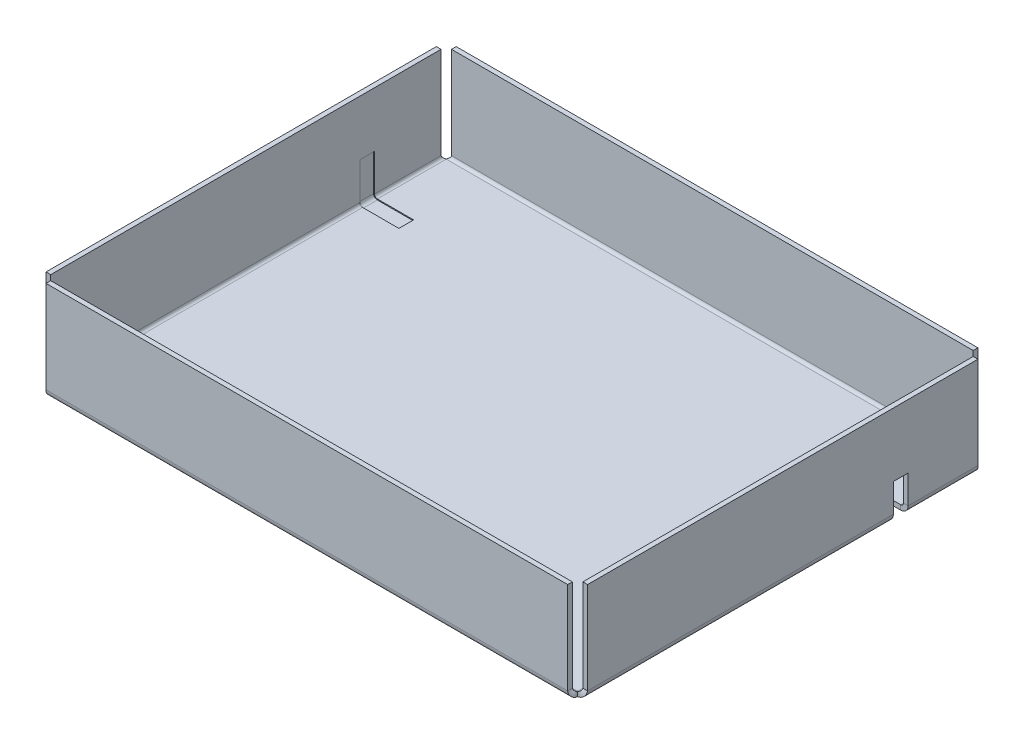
ISO-10303-21;
HEADER;
FILE_DESCRIPTION(('STEP AP214'),'2;1');
FILE_NAME('part.step','',(''),(''),'','','');
FILE_SCHEMA(('AUTOMOTIVE_DESIGN { 1 0 10303 214 1 1 1 1 }'));
ENDSEC;
DATA;
#1=APPLICATION_CONTEXT('core data for automotive mechanical design processes');
#2=APPLICATION_PROTOCOL_DEFINITION('international standard','automotive_design',2000,#1);
#3=PRODUCT_CONTEXT('',#1,'mechanical');
#4=PRODUCT('Part','Part','',(#3));
#5=PRODUCT_RELATED_PRODUCT_CATEGORY('part','',(#4));
#6=PRODUCT_DEFINITION_FORMATION('','',#4);
#7=PRODUCT_DEFINITION_CONTEXT('part definition',#1,'design');
#8=PRODUCT_DEFINITION('design','',#6,#7);
#9=PRODUCT_DEFINITION_SHAPE('','',#8);
#10=(LENGTH_UNIT() NAMED_UNIT(*) SI_UNIT(.MILLI.,.METRE.));
#11=(NAMED_UNIT(*) PLANE_ANGLE_UNIT() SI_UNIT($,.RADIAN.));
#12=(NAMED_UNIT(*) SI_UNIT($,.STERADIAN.) SOLID_ANGLE_UNIT());
#13=UNCERTAINTY_MEASURE_WITH_UNIT(LENGTH_MEASURE(1.E-05),#10,'distance_accuracy_value','');
#14=(GEOMETRIC_REPRESENTATION_CONTEXT(3) GLOBAL_UNCERTAINTY_ASSIGNED_CONTEXT((#13)) GLOBAL_UNIT_ASSIGNED_CONTEXT((#10,
#11,#12)) REPRESENTATION_CONTEXT('',''));
#15=CARTESIAN_POINT('',(0.,0.,0.));
#16=DIRECTION('',(0.,0.,1.));
#17=DIRECTION('',(1.,0.,0.));
#18=AXIS2_PLACEMENT_3D('',#15,#16,#17);
#19=CARTESIAN_POINT('',(-83.3531837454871,1.01599999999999,-34.767946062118));
#20=DIRECTION('',(0.,0.,-1.));
#21=DIRECTION('',(-1.,0.,0.));
#22=AXIS2_PLACEMENT_3D('',#19,#20,#21);
#23=PLANE('',#22);
#24=DIRECTION('',(-1.,0.,0.));
#25=VECTOR('',#24,1.);
#26=CARTESIAN_POINT('',(-83.3531837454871,1.26999999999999,-34.767946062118));
#27=LINE('',#26,#25);
#28=CARTESIAN_POINT('',(-61.3379858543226,1.26999999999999,-34.767946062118));
#29=VERTEX_POINT('',#28);
#30=CARTESIAN_POINT('',(-71.1471714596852,1.26999999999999,-34.767946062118));
#31=VERTEX_POINT('',#30);
#32=EDGE_CURVE('E173',#29,#31,#27,.T.);
#33=ORIENTED_EDGE('',*,*,#32,.T.);
#34=CARTESIAN_POINT('',(-71.1471714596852,1.26999999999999,-34.767946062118));
#35=CARTESIAN_POINT('',(-71.1471714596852,1.01599999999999,-34.767946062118));
#36=B_SPLINE_CURVE_WITH_KNOTS('',1,(#34,#35),.UNSPECIFIED.,.F.,.F.,(2,2),(0.,1.),.UNSPECIFIED.);
#37=CARTESIAN_POINT('',(-71.1471714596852,1.01599999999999,-34.767946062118));
#38=VERTEX_POINT('',#37);
#39=EDGE_CURVE('E490',#31,#38,#36,.T.);
#40=ORIENTED_EDGE('',*,*,#39,.T.);
#41=DIRECTION('',(-1.,0.,0.));
#42=VECTOR('',#41,1.);
#43=CARTESIAN_POINT('',(-83.3531837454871,1.01599999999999,-34.767946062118));
#44=LINE('',#43,#42);
#45=CARTESIAN_POINT('',(-61.3379858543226,1.01599999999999,-34.767946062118));
#46=VERTEX_POINT('',#45);
#47=EDGE_CURVE('E1116',#46,#38,#44,.T.);
#48=ORIENTED_EDGE('',*,*,#47,.F.);
#49=DIRECTION('',(0.,1.,0.));
#50=VECTOR('',#49,1.);
#51=CARTESIAN_POINT('',(-61.3379858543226,1.01599999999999,-34.767946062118));
#52=LINE('',#51,#50);
#53=EDGE_CURVE('E1120',#46,#29,#52,.T.);
#54=ORIENTED_EDGE('',*,*,#53,.T.);
#55=EDGE_LOOP('',(#33,#40,#48,#54));
#56=FACE_BOUND('',#55,.T.);
#57=ADVANCED_FACE('F148',(#56),#23,.F.);
#58=CARTESIAN_POINT('',(-83.3531837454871,1.01599999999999,-30.7824229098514));
#59=DIRECTION('',(0.,0.,1.));
#60=DIRECTION('',(1.,0.,0.));
#61=AXIS2_PLACEMENT_3D('',#58,#59,#60);
#62=PLANE('',#61);
#63=DIRECTION('',(1.,0.,0.));
#64=VECTOR('',#63,1.);
#65=CARTESIAN_POINT('',(-83.3531837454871,1.01599999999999,-30.7824229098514));
#66=LINE('',#65,#64);
#67=CARTESIAN_POINT('',(-71.1471714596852,1.01599999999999,-30.7824229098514));
#68=VERTEX_POINT('',#67);
#69=CARTESIAN_POINT('',(-61.3379858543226,1.01599999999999,-30.7824229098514));
#70=VERTEX_POINT('',#69);
#71=EDGE_CURVE('E1117',#68,#70,#66,.T.);
#72=ORIENTED_EDGE('',*,*,#71,.F.);
#73=CARTESIAN_POINT('',(-71.1471714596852,1.01599999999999,-30.7824229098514));
#74=CARTESIAN_POINT('',(-71.1471714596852,1.26999999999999,-30.7824229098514));
#75=B_SPLINE_CURVE_WITH_KNOTS('',1,(#73,#74),.UNSPECIFIED.,.F.,.F.,(2,2),(0.,1.),.UNSPECIFIED.);
#76=CARTESIAN_POINT('',(-71.1471714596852,1.26999999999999,-30.7824229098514));
#77=VERTEX_POINT('',#76);
#78=EDGE_CURVE('E560',#68,#77,#75,.T.);
#79=ORIENTED_EDGE('',*,*,#78,.T.);
#80=DIRECTION('',(1.,0.,0.));
#81=VECTOR('',#80,1.);
#82=CARTESIAN_POINT('',(-83.3531837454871,1.26999999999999,-30.7824229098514));
#83=LINE('',#82,#81);
#84=CARTESIAN_POINT('',(-61.3379858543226,1.26999999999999,-30.7824229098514));
#85=VERTEX_POINT('',#84);
#86=EDGE_CURVE('E546',#77,#85,#83,.T.);
#87=ORIENTED_EDGE('',*,*,#86,.T.);
#88=DIRECTION('',(0.,1.,0.));
#89=VECTOR('',#88,1.);
#90=CARTESIAN_POINT('',(-61.3379858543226,1.01599999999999,-30.7824229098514));
#91=LINE('',#90,#89);
#92=EDGE_CURVE('E1123',#70,#85,#91,.T.);
#93=ORIENTED_EDGE('',*,*,#92,.F.);
#94=EDGE_LOOP('',(#72,#79,#87,#93));
#95=FACE_BOUND('',#94,.T.);
#96=ADVANCED_FACE('F923',(#95),#62,.F.);
#97=CARTESIAN_POINT('',(70.4949578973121,2.032,55.4398859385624));
#98=CARTESIAN_POINT('',(70.4949578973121,1.78509444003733,55.4398859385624));
#99=CARTESIAN_POINT('',(70.5357212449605,1.52170976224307,55.3935456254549));
#100=CARTESIAN_POINT('',(70.6580112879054,1.02007121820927,55.1923750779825));
#101=CARTESIAN_POINT('',(70.7395379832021,0.782624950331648,55.0375059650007));
#102=CARTESIAN_POINT('',(70.9025913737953,0.389552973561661,54.6444339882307));
#103=CARTESIAN_POINT('',(70.9841180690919,0.234683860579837,54.4069877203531));
#104=CARTESIAN_POINT('',(71.1064081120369,0.0335133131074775,53.9053491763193));
#105=CARTESIAN_POINT('',(71.1471714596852,-0.0128270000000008,53.641964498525));
#106=CARTESIAN_POINT('',(71.1471714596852,-0.0128270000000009,53.3950589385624));
#107=CARTESIAN_POINT('',(70.4949578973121,2.032,55.4270589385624));
#108=CARTESIAN_POINT('',(70.4949578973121,1.78664325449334,55.4270589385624));
#109=CARTESIAN_POINT('',(70.5357212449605,1.52491076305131,55.3810093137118));
#110=CARTESIAN_POINT('',(70.6580112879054,1.02641894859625,55.1811006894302));
#111=CARTESIAN_POINT('',(70.7395379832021,0.790462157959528,55.027203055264));
#112=CARTESIAN_POINT('',(70.9025913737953,0.399855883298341,54.6365967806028));
#113=CARTESIAN_POINT('',(70.9841180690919,0.24595824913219,54.4006399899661));
#114=CARTESIAN_POINT('',(71.1064081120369,0.046049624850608,53.9021481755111));
#115=CARTESIAN_POINT('',(71.1471714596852,0.,53.640415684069));
#116=CARTESIAN_POINT('',(71.1471714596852,0.,53.3950589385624));
#117=CARTESIAN_POINT('',(70.4949578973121,2.032,54.1570589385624));
#118=CARTESIAN_POINT('',(70.4949578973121,1.939991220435,54.1570589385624));
#119=CARTESIAN_POINT('',(70.5357212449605,1.84184153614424,54.1397903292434));
#120=CARTESIAN_POINT('',(70.6580112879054,1.65490710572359,54.0648245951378));
#121=CARTESIAN_POINT('',(70.7395379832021,1.56642330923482,54.0071129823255));
#122=CARTESIAN_POINT('',(70.9025913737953,1.41994595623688,53.8606356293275));
#123=CARTESIAN_POINT('',(70.9841180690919,1.36223434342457,53.7721518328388));
#124=CARTESIAN_POINT('',(71.1064081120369,1.28726860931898,53.5852174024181));
#125=CARTESIAN_POINT('',(71.1471714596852,1.27,53.4870677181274));
#126=CARTESIAN_POINT('',(71.1471714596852,1.27,53.3950589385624));
#127=CARTESIAN_POINT('',(70.4949578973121,2.032,54.1443589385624));
#128=CARTESIAN_POINT('',(70.4949578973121,1.94152470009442,54.1443589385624));
#129=CARTESIAN_POINT('',(70.5357212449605,1.84501084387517,54.1273781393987));
#130=CARTESIAN_POINT('',(70.6580112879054,1.66119198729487,54.0536618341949));
#131=CARTESIAN_POINT('',(70.7395379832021,1.57418292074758,53.9969120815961));
#132=CARTESIAN_POINT('',(70.9025913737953,1.43014685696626,53.8528760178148));
#133=CARTESIAN_POINT('',(70.9841180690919,1.3733971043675,53.7658669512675));
#134=CARTESIAN_POINT('',(71.1064081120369,1.29968079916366,53.5820480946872));
#135=CARTESIAN_POINT('',(71.1471714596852,1.2827,53.485534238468));
#136=CARTESIAN_POINT('',(71.1471714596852,1.2827,53.3950589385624));
#137=B_SPLINE_SURFACE_WITH_KNOTS('',1,3,((#97,#98,#99,#100,#101,#102,#103,#104,#105,#106),(#107,
#108,#109,#110,#111,#112,#113,#114,#115,#116),(#117,#118,#119,#120,#121,#122,#123,#124,#125,
#126),(#127,#128,#129,#130,#131,#132,#133,#134,#135,#136)),.UNSPECIFIED.,.F.,.F.,.F.,(2,1,1,2),
(4,2,2,2,4),(-0.0101,0.,1.,1.01),(0.,0.25,0.5,0.75,1.),.UNSPECIFIED.);
#138=CARTESIAN_POINT('',(71.1471714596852,1.27,53.3950589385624));
#139=CARTESIAN_POINT('',(71.1471714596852,0.,53.3950589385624));
#140=B_SPLINE_CURVE_WITH_KNOTS('',1,(#138,#139),.UNSPECIFIED.,.F.,.F.,(2,2),(0.,1.),.UNSPECIFIED.);
#141=CARTESIAN_POINT('',(71.1471714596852,1.27,53.3950589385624));
#142=VERTEX_POINT('',#141);
#143=CARTESIAN_POINT('',(71.1471714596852,0.,53.3950589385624));
#144=VERTEX_POINT('',#143);
#145=EDGE_CURVE('E565',#142,#144,#140,.T.);
#146=CARTESIAN_POINT('',(71.1471714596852,1.27,53.3950589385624));
#147=CARTESIAN_POINT('',(71.1471543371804,1.26998387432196,53.4165280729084));
#148=CARTESIAN_POINT('',(71.1449560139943,1.27090584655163,53.4378031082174));
#149=CARTESIAN_POINT('',(71.1372558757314,1.27439468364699,53.4793117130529));
#150=CARTESIAN_POINT('',(71.1318026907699,1.27693737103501,53.4995559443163));
#151=CARTESIAN_POINT('',(71.1153056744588,1.28506814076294,53.5488093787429));
#152=CARTESIAN_POINT('',(71.1028301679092,1.2915420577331,53.5771667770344));
#153=CARTESIAN_POINT('',(71.0747150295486,1.30712107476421,53.6317158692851));
#154=CARTESIAN_POINT('',(71.0590489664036,1.31624844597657,53.6578867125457));
#155=CARTESIAN_POINT('',(71.0278672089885,1.33547058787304,53.7049873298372));
#156=CARTESIAN_POINT('',(71.0125662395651,1.34531157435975,53.7261670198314));
#157=CARTESIAN_POINT('',(70.9810055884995,1.3665389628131,53.7669926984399));
#158=CARTESIAN_POINT('',(70.9647452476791,1.37792643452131,53.7866376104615));
#159=CARTESIAN_POINT('',(70.9150938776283,1.41421697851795,53.8434002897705));
#160=CARTESIAN_POINT('',(70.8808078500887,1.44126300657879,53.8783809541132));
#161=CARTESIAN_POINT('',(70.8094368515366,1.50273412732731,53.9452643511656));
#162=CARTESIAN_POINT('',(70.7723227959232,1.53754111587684,53.9767848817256));
#163=CARTESIAN_POINT('',(70.7179631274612,1.59440548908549,54.0193271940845));
#164=CARTESIAN_POINT('',(70.700075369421,1.61411858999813,54.0327095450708));
#165=CARTESIAN_POINT('',(70.6650684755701,1.65520219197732,54.0578163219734));
#166=CARTESIAN_POINT('',(70.6479488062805,1.67657151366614,54.0695419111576));
#167=CARTESIAN_POINT('',(70.6150764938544,1.72091419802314,54.0910994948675));
#168=CARTESIAN_POINT('',(70.5993133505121,1.74387216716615,54.1009469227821));
#169=CARTESIAN_POINT('',(70.5696647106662,1.79175205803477,54.1186446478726));
#170=CARTESIAN_POINT('',(70.5557798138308,1.81667460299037,54.1264943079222));
#171=CARTESIAN_POINT('',(70.5339608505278,1.86255578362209,54.1382650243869));
#172=CARTESIAN_POINT('',(70.5253941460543,1.88308340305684,54.1426753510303));
#173=CARTESIAN_POINT('',(70.5109132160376,1.92527850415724,54.1498489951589));
#174=CARTESIAN_POINT('',(70.5049862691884,1.94693994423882,54.1526202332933));
#175=CARTESIAN_POINT('',(70.4990270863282,1.97936032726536,54.1553095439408));
#176=CARTESIAN_POINT('',(70.4975361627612,1.98979372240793,54.1559612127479));
#177=CARTESIAN_POINT('',(70.4954989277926,2.01081231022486,54.1568375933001));
#178=CARTESIAN_POINT('',(70.4949565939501,2.0213979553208,54.1570605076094));
#179=CARTESIAN_POINT('',(70.4949578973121,2.032,54.1570589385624));
#180=B_SPLINE_CURVE_WITH_KNOTS('',3,(#146,#147,#148,#149,#150,#151,#152,#153,#154,#155,#156,
#157,#158,#159,#160,#161,#162,#163,#164,#165,#166,#167,#168,#169,#170,#171,#172,#173,#174,#175,
#176,#177,#178,#179),.UNSPECIFIED.,.F.,.F.,(4,2,2,2,2,2,2,2,2,2,2,2,2,2,2,2,4),(0.,
0.0639973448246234,0.127061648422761,0.221510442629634,0.316776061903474,0.400421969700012,
0.48412603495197,0.651399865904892,0.830284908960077,0.919586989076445,1.00882605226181,
1.09729683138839,1.18579579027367,1.25365614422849,1.32118583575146,1.35281772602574,
1.38458193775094),.UNSPECIFIED.);
#181=CARTESIAN_POINT('',(70.4949578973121,2.032,54.1570589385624));
#182=VERTEX_POINT('',#181);
#183=EDGE_CURVE('E752',#142,#182,#180,.T.);
#184=CARTESIAN_POINT('',(70.4949578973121,2.032,54.1443589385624));
#185=CARTESIAN_POINT('',(70.4949578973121,2.032,54.1570589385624));
#186=CARTESIAN_POINT('',(70.4949578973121,2.032,55.4270589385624));
#187=CARTESIAN_POINT('',(70.4949578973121,2.032,55.4398859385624));
#188=B_SPLINE_CURVE_WITH_KNOTS('',1,(#184,#185,#186,#187),.UNSPECIFIED.,.F.,.F.,(2,1,1,2),
(-0.0101,-9.9999999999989E-05,0.9999,1.01),.UNSPECIFIED.);
#189=CARTESIAN_POINT('',(70.4949578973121,2.032,55.4270589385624));
#190=VERTEX_POINT('',#189);
#191=EDGE_CURVE('E1464',#182,#190,#188,.T.);
#192=CARTESIAN_POINT('',(71.1471714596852,0.,53.3950589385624));
#193=CARTESIAN_POINT('',(71.1471477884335,-1.28570065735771E-05,53.4507058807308));
#194=CARTESIAN_POINT('',(71.145075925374,0.00228517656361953,53.5062984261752));
#195=CARTESIAN_POINT('',(71.137527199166,0.0113791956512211,53.6168019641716));
#196=CARTESIAN_POINT('',(71.1320556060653,0.0181682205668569,53.6717138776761));
#197=CARTESIAN_POINT('',(71.1184425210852,0.0360579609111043,53.7800761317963));
#198=CARTESIAN_POINT('',(71.1103200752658,0.0471280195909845,53.8335340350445));
#199=CARTESIAN_POINT('',(71.0919183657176,0.0734128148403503,53.9390429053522));
#200=CARTESIAN_POINT('',(71.081638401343,0.0886288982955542,53.9910934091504));
#201=CARTESIAN_POINT('',(71.0509102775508,0.136154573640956,54.132514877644));
#202=CARTESIAN_POINT('',(71.0286798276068,0.172657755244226,54.220125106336));
#203=CARTESIAN_POINT('',(70.98093102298,0.257049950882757,54.3887878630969));
#204=CARTESIAN_POINT('',(70.9554078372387,0.304955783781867,54.4698304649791));
#205=CARTESIAN_POINT('',(70.8972929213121,0.421841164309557,54.6396665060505));
#206=CARTESIAN_POINT('',(70.8643098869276,0.493120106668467,54.7267568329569));
#207=CARTESIAN_POINT('',(70.7981054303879,0.649011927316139,54.8880351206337));
#208=CARTESIAN_POINT('',(70.7648838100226,0.733637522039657,54.9622106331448));
#209=CARTESIAN_POINT('',(70.6985000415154,0.92002630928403,55.0999735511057));
#210=CARTESIAN_POINT('',(70.6654618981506,1.02251454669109,55.1626546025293));
#211=CARTESIAN_POINT('',(70.6200345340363,1.18405932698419,55.2426621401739));
#212=CARTESIAN_POINT('',(70.6055870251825,1.23917803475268,55.2669863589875));
#213=CARTESIAN_POINT('',(70.5785318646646,1.35174059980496,55.3107597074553));
#214=CARTESIAN_POINT('',(70.5659229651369,1.40918284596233,55.3302121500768));
#215=CARTESIAN_POINT('',(70.5457151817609,1.51280649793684,55.3601743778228));
#216=CARTESIAN_POINT('',(70.5376280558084,1.55859873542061,55.3717116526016));
#217=CARTESIAN_POINT('',(70.5232359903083,1.65112792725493,55.3916055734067));
#218=CARTESIAN_POINT('',(70.5169301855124,1.69786441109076,55.3999637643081));
#219=CARTESIAN_POINT('',(70.5064389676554,1.79226418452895,55.4134323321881));
#220=CARTESIAN_POINT('',(70.5022631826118,1.83993068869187,55.4185279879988));
#221=CARTESIAN_POINT('',(70.4965276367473,1.93572061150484,55.425347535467));
#222=CARTESIAN_POINT('',(70.4949713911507,1.98384455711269,55.4270668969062));
#223=CARTESIAN_POINT('',(70.4949578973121,2.032,55.4270589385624));
#224=B_SPLINE_CURVE_WITH_KNOTS('',3,(#192,#193,#194,#195,#196,#197,#198,#199,#200,#201,#202,
#203,#204,#205,#206,#207,#208,#209,#210,#211,#212,#213,#214,#215,#216,#217,#218,#219,#220,#221,
#222,#223),.UNSPECIFIED.,.F.,.F.,(4,2,2,2,2,2,2,2,2,2,2,2,2,2,2,4),(0.,0.16677767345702,
0.333297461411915,0.498646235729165,0.664048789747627,0.955393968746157,1.24717157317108,
1.59744141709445,1.94804703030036,2.31976152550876,2.50541991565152,2.69095170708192,
2.83455081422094,2.9780800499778,3.1222524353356,3.26661813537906),.UNSPECIFIED.);
#225=EDGE_CURVE('E858',#144,#190,#224,.T.);
#226=ORIENTED_EDGE('',*,*,#145,.F.);
#227=ORIENTED_EDGE('',*,*,#183,.T.);
#228=ORIENTED_EDGE('',*,*,#191,.T.);
#229=ORIENTED_EDGE('',*,*,#225,.F.);
#230=EDGE_LOOP('',(#226,#227,#228,#229));
#231=FACE_BOUND('',#230,.T.);
#232=ADVANCED_FACE('F664',(#231),#137,.F.);
#233=CARTESIAN_POINT('',(70.4949578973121,26.924,55.4270589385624));
#234=DIRECTION('',(-1.,0.,0.));
#235=DIRECTION('',(0.,1.,0.));
#236=AXIS2_PLACEMENT_3D('',#233,#234,#235);
#237=PLANE('',#236);
#238=ORIENTED_EDGE('',*,*,#191,.F.);
#239=DIRECTION('',(0.,1.,0.));
#240=VECTOR('',#239,1.);
#241=CARTESIAN_POINT('',(70.4949578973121,26.924,54.1570589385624));
#242=LINE('',#241,#240);
#243=CARTESIAN_POINT('',(70.4949578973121,26.924,54.1570589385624));
#244=VERTEX_POINT('',#243);
#245=EDGE_CURVE('E830',#182,#244,#242,.T.);
#246=ORIENTED_EDGE('',*,*,#245,.T.);
#247=DIRECTION('',(0.,0.,1.));
#248=VECTOR('',#247,1.);
#249=CARTESIAN_POINT('',(70.4949578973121,26.924,55.4270589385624));
#250=LINE('',#249,#248);
#251=CARTESIAN_POINT('',(70.4949578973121,26.924,55.4270589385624));
#252=VERTEX_POINT('',#251);
#253=EDGE_CURVE('E1946',#244,#252,#250,.T.);
#254=ORIENTED_EDGE('',*,*,#253,.T.);
#255=DIRECTION('',(0.,1.,0.));
#256=VECTOR('',#255,1.);
#257=CARTESIAN_POINT('',(70.4949578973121,26.924,55.4270589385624));
#258=LINE('',#257,#256);
#259=EDGE_CURVE('E820',#190,#252,#258,.T.);
#260=ORIENTED_EDGE('',*,*,#259,.F.);
#261=EDGE_LOOP('',(#238,#246,#254,#260));
#262=FACE_BOUND('',#261,.T.);
#263=ADVANCED_FACE('F659',(#262),#237,.F.);
#264=CARTESIAN_POINT('',(-73.1791714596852,26.924,55.4270589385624));
#265=DIRECTION('',(0.,1.,0.));
#266=DIRECTION('',(1.,0.,0.));
#267=AXIS2_PLACEMENT_3D('',#264,#265,#266);
#268=PLANE('',#267);
#269=ORIENTED_EDGE('',*,*,#253,.F.);
#270=DIRECTION('',(-1.,0.,0.));
#271=VECTOR('',#270,1.);
#272=CARTESIAN_POINT('',(-73.1791714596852,26.924,54.1570589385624));
#273=LINE('',#272,#271);
#274=CARTESIAN_POINT('',(-70.4949578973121,26.924,54.1570589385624));
#275=VERTEX_POINT('',#274);
#276=EDGE_CURVE('E745',#275,#244,#273,.F.);
#277=ORIENTED_EDGE('',*,*,#276,.F.);
#278=DIRECTION('',(0.,0.,1.));
#279=VECTOR('',#278,1.);
#280=CARTESIAN_POINT('',(-70.4949578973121,26.924,55.4270589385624));
#281=LINE('',#280,#279);
#282=CARTESIAN_POINT('',(-70.4949578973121,26.924,55.4270589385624));
#283=VERTEX_POINT('',#282);
#284=EDGE_CURVE('E1944',#275,#283,#281,.T.);
#285=ORIENTED_EDGE('',*,*,#284,.T.);
#286=DIRECTION('',(1.,0.,0.));
#287=VECTOR('',#286,1.);
#288=CARTESIAN_POINT('',(-73.1791714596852,26.924,55.4270589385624));
#289=LINE('',#288,#287);
#290=EDGE_CURVE('E797',#283,#252,#289,.T.);
#291=ORIENTED_EDGE('',*,*,#290,.T.);
#292=EDGE_LOOP('',(#269,#277,#285,#291));
#293=FACE_BOUND('',#292,.T.);
#294=ADVANCED_FACE('F656',(#293),#268,.T.);
#295=CARTESIAN_POINT('',(-70.4949578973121,26.924,55.4270589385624));
#296=DIRECTION('',(1.,0.,0.));
#297=DIRECTION('',(0.,-1.,0.));
#298=AXIS2_PLACEMENT_3D('',#295,#296,#297);
#299=PLANE('',#298);
#300=ORIENTED_EDGE('',*,*,#284,.F.);
#301=DIRECTION('',(0.,1.,0.));
#302=VECTOR('',#301,1.);
#303=CARTESIAN_POINT('',(-70.4949578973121,26.924,54.1570589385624));
#304=LINE('',#303,#302);
#305=CARTESIAN_POINT('',(-70.4949578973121,2.032,54.1570589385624));
#306=VERTEX_POINT('',#305);
#307=EDGE_CURVE('E836',#275,#306,#304,.F.);
#308=ORIENTED_EDGE('',*,*,#307,.T.);
#309=CARTESIAN_POINT('',(-70.4949578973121,2.032,55.4397589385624));
#310=CARTESIAN_POINT('',(-70.4949578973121,2.032,55.4270589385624));
#311=CARTESIAN_POINT('',(-70.4949578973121,2.032,54.1570589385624));
#312=CARTESIAN_POINT('',(-70.4949578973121,2.032,54.1442319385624));
#313=B_SPLINE_CURVE_WITH_KNOTS('',1,(#309,#310,#311,#312),.UNSPECIFIED.,.F.,.F.,(2,1,1,2),
(-0.01,0.,1.,1.0101),.UNSPECIFIED.);
#314=CARTESIAN_POINT('',(-70.4949578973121,2.032,55.4270589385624));
#315=VERTEX_POINT('',#314);
#316=EDGE_CURVE('E641',#306,#315,#313,.F.);
#317=ORIENTED_EDGE('',*,*,#316,.T.);
#318=DIRECTION('',(0.,-1.,0.));
#319=VECTOR('',#318,1.);
#320=CARTESIAN_POINT('',(-70.4949578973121,26.924,55.4270589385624));
#321=LINE('',#320,#319);
#322=EDGE_CURVE('E813',#283,#315,#321,.T.);
#323=ORIENTED_EDGE('',*,*,#322,.F.);
#324=EDGE_LOOP('',(#300,#308,#317,#323));
#325=FACE_BOUND('',#324,.T.);
#326=ADVANCED_FACE('F647',(#325),#299,.F.);
#327=CARTESIAN_POINT('',(-71.1471714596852,-0.0127000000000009,53.3950589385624));
#328=CARTESIAN_POINT('',(-71.1471714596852,-0.0127000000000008,53.6419491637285));
#329=CARTESIAN_POINT('',(-71.1064081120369,0.0336374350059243,53.905317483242));
#330=CARTESIAN_POINT('',(-70.9841180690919,0.234795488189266,54.4069248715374));
#331=CARTESIAN_POINT('',(-70.9025913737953,0.389654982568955,54.6443563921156));
#332=CARTESIAN_POINT('',(-70.739537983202,0.782702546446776,55.0374039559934));
#333=CARTESIAN_POINT('',(-70.6580112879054,1.02013406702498,55.1922634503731));
#334=CARTESIAN_POINT('',(-70.5357212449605,1.52174145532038,55.3934215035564));
#335=CARTESIAN_POINT('',(-70.4949578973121,1.78510977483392,55.4397589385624));
#336=CARTESIAN_POINT('',(-70.4949578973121,2.032,55.4397589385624));
#337=CARTESIAN_POINT('',(-71.1471714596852,0.,53.3950589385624));
#338=CARTESIAN_POINT('',(-71.1471714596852,0.,53.640415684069));
#339=CARTESIAN_POINT('',(-71.1064081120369,0.046049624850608,53.9021481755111));
#340=CARTESIAN_POINT('',(-70.9841180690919,0.24595824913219,54.4006399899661));
#341=CARTESIAN_POINT('',(-70.9025913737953,0.399855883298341,54.6365967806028));
#342=CARTESIAN_POINT('',(-70.739537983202,0.790462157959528,55.027203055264));
#343=CARTESIAN_POINT('',(-70.6580112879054,1.02641894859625,55.1811006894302));
#344=CARTESIAN_POINT('',(-70.5357212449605,1.52491076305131,55.3810093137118));
#345=CARTESIAN_POINT('',(-70.4949578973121,1.78664325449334,55.4270589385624));
#346=CARTESIAN_POINT('',(-70.4949578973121,2.032,55.4270589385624));
#347=CARTESIAN_POINT('',(-71.1471714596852,1.27,53.3950589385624));
#348=CARTESIAN_POINT('',(-71.1471714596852,1.27,53.4870677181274));
#349=CARTESIAN_POINT('',(-71.1064081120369,1.28726860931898,53.5852174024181));
#350=CARTESIAN_POINT('',(-70.9841180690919,1.36223434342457,53.7721518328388));
#351=CARTESIAN_POINT('',(-70.9025913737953,1.41994595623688,53.8606356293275));
#352=CARTESIAN_POINT('',(-70.739537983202,1.56642330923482,54.0071129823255));
#353=CARTESIAN_POINT('',(-70.6580112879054,1.65490710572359,54.0648245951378));
#354=CARTESIAN_POINT('',(-70.5357212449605,1.84184153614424,54.1397903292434));
#355=CARTESIAN_POINT('',(-70.4949578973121,1.939991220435,54.1570589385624));
#356=CARTESIAN_POINT('',(-70.4949578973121,2.032,54.1570589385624));
#357=CARTESIAN_POINT('',(-71.1471714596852,1.282827,53.3950589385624));
#358=CARTESIAN_POINT('',(-71.1471714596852,1.282827,53.4855189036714));
#359=CARTESIAN_POINT('',(-71.1064081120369,1.29980492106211,53.5820164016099));
#360=CARTESIAN_POINT('',(-70.9841180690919,1.37350873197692,53.7658041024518));
#361=CARTESIAN_POINT('',(-70.9025913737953,1.43024886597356,53.8527984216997));
#362=CARTESIAN_POINT('',(-70.739537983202,1.5742605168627,53.9968100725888));
#363=CARTESIAN_POINT('',(-70.6580112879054,1.66125483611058,54.0535502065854));
#364=CARTESIAN_POINT('',(-70.5357212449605,1.84504253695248,54.1272540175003));
#365=CARTESIAN_POINT('',(-70.4949578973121,1.94154003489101,54.1442319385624));
#366=CARTESIAN_POINT('',(-70.4949578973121,2.032,54.1442319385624));
#367=B_SPLINE_SURFACE_WITH_KNOTS('',1,3,((#327,#328,#329,#330,#331,#332,#333,#334,#335,#336),
(#337,#338,#339,#340,#341,#342,#343,#344,#345,#346),(#347,#348,#349,#350,#351,#352,#353,#354,
#355,#356),(#357,#358,#359,#360,#361,#362,#363,#364,#365,#366)),.UNSPECIFIED.,.F.,.F.,.F.,(2,1,
1,2),(4,2,2,2,4),(-0.01,0.,1.,1.0101),(0.,0.25,0.5,0.75,1.),.UNSPECIFIED.);
#368=CARTESIAN_POINT('',(-70.4949578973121,2.032,54.1570589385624));
#369=CARTESIAN_POINT('',(-70.494975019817,2.01053086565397,54.1570750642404));
#370=CARTESIAN_POINT('',(-70.4971733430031,1.98925583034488,54.1561530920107));
#371=CARTESIAN_POINT('',(-70.504873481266,1.9477472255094,54.1526642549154));
#372=CARTESIAN_POINT('',(-70.5103266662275,1.92750299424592,54.1501215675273));
#373=CARTESIAN_POINT('',(-70.5268236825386,1.87824955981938,54.1419907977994));
#374=CARTESIAN_POINT('',(-70.5392991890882,1.84989216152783,54.1355168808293));
#375=CARTESIAN_POINT('',(-70.5674143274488,1.79534306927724,54.1199378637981));
#376=CARTESIAN_POINT('',(-70.5830803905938,1.76917222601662,54.1108104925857));
#377=CARTESIAN_POINT('',(-70.6142621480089,1.72207160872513,54.0915883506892));
#378=CARTESIAN_POINT('',(-70.6295631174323,1.70089191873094,54.0817473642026));
#379=CARTESIAN_POINT('',(-70.6611237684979,1.66006624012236,54.0605199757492));
#380=CARTESIAN_POINT('',(-70.6773841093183,1.64042132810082,54.049132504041));
#381=CARTESIAN_POINT('',(-70.7270354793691,1.58365864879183,54.0128419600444));
#382=CARTESIAN_POINT('',(-70.7613215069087,1.5486779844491,53.9857959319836));
#383=CARTESIAN_POINT('',(-70.8326925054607,1.48179458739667,53.9243248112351));
#384=CARTESIAN_POINT('',(-70.8698065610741,1.4502740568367,53.8895178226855));
#385=CARTESIAN_POINT('',(-70.9241662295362,1.40773174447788,53.8326534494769));
#386=CARTESIAN_POINT('',(-70.9420539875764,1.39434939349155,53.8129403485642));
#387=CARTESIAN_POINT('',(-70.9770608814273,1.369242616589,53.7718567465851));
#388=CARTESIAN_POINT('',(-70.9941805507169,1.35751702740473,53.7504874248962));
#389=CARTESIAN_POINT('',(-71.027052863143,1.33595944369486,53.7061447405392));
#390=CARTESIAN_POINT('',(-71.0428160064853,1.32611201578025,53.6831867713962));
#391=CARTESIAN_POINT('',(-71.0724646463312,1.30841429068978,53.6353068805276));
#392=CARTESIAN_POINT('',(-71.0863495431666,1.30056463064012,53.610384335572));
#393=CARTESIAN_POINT('',(-71.1081685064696,1.28879391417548,53.5645031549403));
#394=CARTESIAN_POINT('',(-71.1167352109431,1.28438358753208,53.5439755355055));
#395=CARTESIAN_POINT('',(-71.1312161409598,1.2772099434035,53.5017804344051));
#396=CARTESIAN_POINT('',(-71.1371430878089,1.27443870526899,53.4801189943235));
#397=CARTESIAN_POINT('',(-71.1431022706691,1.27174939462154,53.447698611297));
#398=CARTESIAN_POINT('',(-71.1445931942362,1.27109772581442,53.4372652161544));
#399=CARTESIAN_POINT('',(-71.1466304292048,1.27022134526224,53.4162466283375));
#400=CARTESIAN_POINT('',(-71.1471727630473,1.26999843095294,53.4056609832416));
#401=CARTESIAN_POINT('',(-71.1471714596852,1.27,53.3950589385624));
#402=B_SPLINE_CURVE_WITH_KNOTS('',3,(#368,#369,#370,#371,#372,#373,#374,#375,#376,#377,#378,
#379,#380,#381,#382,#383,#384,#385,#386,#387,#388,#389,#390,#391,#392,#393,#394,#395,#396,#397,
#398,#399,#400,#401),.UNSPECIFIED.,.F.,.F.,(4,2,2,2,2,2,2,2,2,2,2,2,2,2,2,2,4),(0.,
0.0639973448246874,0.127061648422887,0.221510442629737,0.316776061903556,0.4004219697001,
0.484126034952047,0.65139986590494,0.830284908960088,0.919586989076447,1.00882605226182,
1.09729683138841,1.1857957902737,1.25365614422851,1.32118583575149,1.35281772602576,
1.38458193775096),.UNSPECIFIED.);
#403=CARTESIAN_POINT('',(-71.1471714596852,1.27,53.3950589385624));
#404=VERTEX_POINT('',#403);
#405=EDGE_CURVE('E781',#306,#404,#402,.T.);
#406=CARTESIAN_POINT('',(-71.1471714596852,1.282827,53.3950589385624));
#407=CARTESIAN_POINT('',(-71.1471714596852,1.27,53.3950589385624));
#408=CARTESIAN_POINT('',(-71.1471714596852,0.,53.3950589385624));
#409=CARTESIAN_POINT('',(-71.1471714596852,-0.0127000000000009,53.3950589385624));
#410=B_SPLINE_CURVE_WITH_KNOTS('',1,(#406,#407,#408,#409),.UNSPECIFIED.,.F.,.F.,(2,1,1,2),
(-0.01,9.9999999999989E-05,1.0001,1.0101),.UNSPECIFIED.);
#411=CARTESIAN_POINT('',(-71.1471714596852,0.,53.3950589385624));
#412=VERTEX_POINT('',#411);
#413=EDGE_CURVE('E561',#404,#412,#410,.T.);
#414=CARTESIAN_POINT('',(-70.4949578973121,2.032,55.4270589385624));
#415=CARTESIAN_POINT('',(-70.4949695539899,1.98557568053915,55.4270657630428));
#416=CARTESIAN_POINT('',(-70.4964168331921,1.93917945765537,55.425468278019));
#417=CARTESIAN_POINT('',(-70.5017657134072,1.84679157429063,55.419128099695));
#418=CARTESIAN_POINT('',(-70.505664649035,1.80079952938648,55.4143888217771));
#419=CARTESIAN_POINT('',(-70.5154775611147,1.70969082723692,55.4018590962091));
#420=CARTESIAN_POINT('',(-70.5213815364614,1.66457097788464,55.3940837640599));
#421=CARTESIAN_POINT('',(-70.534877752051,1.57519709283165,55.3755740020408));
#422=CARTESIAN_POINT('',(-70.542470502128,1.5309433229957,55.3648386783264));
#423=CARTESIAN_POINT('',(-70.5678688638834,1.39694690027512,55.3275441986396));
#424=CARTESIAN_POINT('',(-70.587946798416,1.3088908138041,55.2963000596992));
#425=CARTESIAN_POINT('',(-70.6319353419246,1.13859824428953,55.2224889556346));
#426=CARTESIAN_POINT('',(-70.6558525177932,1.05637208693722,55.17990250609));
#427=CARTESIAN_POINT('',(-70.7109172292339,0.883354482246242,55.0748777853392));
#428=CARTESIAN_POINT('',(-70.7425595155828,0.794082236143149,55.0101794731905));
#429=CARTESIAN_POINT('',(-70.8068425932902,0.62732348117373,54.8674603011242));
#430=CARTESIAN_POINT('',(-70.8394837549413,0.549841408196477,54.7894344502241));
#431=CARTESIAN_POINT('',(-70.9062218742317,0.402648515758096,54.6150047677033));
#432=CARTESIAN_POINT('',(-70.9402300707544,0.334035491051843,54.5176359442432));
#433=CARTESIAN_POINT('',(-71.0041585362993,0.214381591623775,54.3112984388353));
#434=CARTESIAN_POINT('',(-71.0340780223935,0.163344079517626,54.2023275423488));
#435=CARTESIAN_POINT('',(-71.0809725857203,0.0890719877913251,53.9979259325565));
#436=CARTESIAN_POINT('',(-71.0993372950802,0.0623360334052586,53.9040757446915));
#437=CARTESIAN_POINT('',(-71.1283238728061,0.0225881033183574,53.7125115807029));
#438=CARTESIAN_POINT('',(-71.1389746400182,0.00952482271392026,53.6148134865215));
#439=CARTESIAN_POINT('',(-71.145027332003,0.0024225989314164,53.4963195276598));
#440=CARTESIAN_POINT('',(-71.1458215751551,0.0015145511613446,53.4760854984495));
#441=CARTESIAN_POINT('',(-71.1468936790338,0.000303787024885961,53.4355895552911));
#442=CARTESIAN_POINT('',(-71.1471716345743,9.59511495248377E-07,53.4153276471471));
#443=CARTESIAN_POINT('',(-71.1471714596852,0.,53.3950589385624));
#444=B_SPLINE_CURVE_WITH_KNOTS('',3,(#414,#415,#416,#417,#418,#419,#420,#421,#422,#423,#424,
#425,#426,#427,#428,#429,#430,#431,#432,#433,#434,#435,#436,#437,#438,#439,#440,#441,#442,#443),
.UNSPECIFIED.,.F.,.F.,(4,2,2,2,2,2,2,2,2,2,2,2,2,2,4),(0.,0.139182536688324,0.278214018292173,
0.416561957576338,0.554951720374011,0.840551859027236,1.12664581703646,1.46928532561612,
1.81205343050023,2.18190535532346,2.55182800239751,2.84863872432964,3.14433166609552,
3.20513180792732,3.26592078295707),.UNSPECIFIED.);
#445=EDGE_CURVE('E913',#315,#412,#444,.T.);
#446=ORIENTED_EDGE('',*,*,#316,.F.);
#447=ORIENTED_EDGE('',*,*,#405,.T.);
#448=ORIENTED_EDGE('',*,*,#413,.T.);
#449=ORIENTED_EDGE('',*,*,#445,.F.);
#450=EDGE_LOOP('',(#446,#447,#448,#449));
#451=FACE_BOUND('',#450,.T.);
#452=ADVANCED_FACE('F587',(#451),#367,.F.);
#453=CARTESIAN_POINT('',(-70.4949578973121,2.032,-55.4398859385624));
#454=CARTESIAN_POINT('',(-70.4949578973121,1.78509444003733,-55.4398859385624));
#455=CARTESIAN_POINT('',(-70.5357212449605,1.52170976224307,-55.3935456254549));
#456=CARTESIAN_POINT('',(-70.6580112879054,1.02007121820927,-55.1923750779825));
#457=CARTESIAN_POINT('',(-70.739537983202,0.782624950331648,-55.0375059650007));
#458=CARTESIAN_POINT('',(-70.9025913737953,0.389552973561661,-54.6444339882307));
#459=CARTESIAN_POINT('',(-70.9841180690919,0.234683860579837,-54.4069877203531));
#460=CARTESIAN_POINT('',(-71.1064081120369,0.0335133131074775,-53.9053491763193));
#461=CARTESIAN_POINT('',(-71.1471714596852,-0.0128270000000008,-53.641964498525));
#462=CARTESIAN_POINT('',(-71.1471714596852,-0.0128270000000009,-53.3950589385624));
#463=CARTESIAN_POINT('',(-70.4949578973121,2.032,-55.4270589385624));
#464=CARTESIAN_POINT('',(-70.4949578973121,1.78664325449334,-55.4270589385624));
#465=CARTESIAN_POINT('',(-70.5357212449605,1.52491076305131,-55.3810093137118));
#466=CARTESIAN_POINT('',(-70.6580112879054,1.02641894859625,-55.1811006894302));
#467=CARTESIAN_POINT('',(-70.739537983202,0.790462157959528,-55.027203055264));
#468=CARTESIAN_POINT('',(-70.9025913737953,0.399855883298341,-54.6365967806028));
#469=CARTESIAN_POINT('',(-70.9841180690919,0.24595824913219,-54.4006399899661));
#470=CARTESIAN_POINT('',(-71.1064081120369,0.046049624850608,-53.9021481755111));
#471=CARTESIAN_POINT('',(-71.1471714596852,0.,-53.640415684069));
#472=CARTESIAN_POINT('',(-71.1471714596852,0.,-53.3950589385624));
#473=CARTESIAN_POINT('',(-70.4949578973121,2.032,-54.1570589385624));
#474=CARTESIAN_POINT('',(-70.4949578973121,1.939991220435,-54.1570589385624));
#475=CARTESIAN_POINT('',(-70.5357212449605,1.84184153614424,-54.1397903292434));
#476=CARTESIAN_POINT('',(-70.6580112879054,1.65490710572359,-54.0648245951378));
#477=CARTESIAN_POINT('',(-70.739537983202,1.56642330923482,-54.0071129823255));
#478=CARTESIAN_POINT('',(-70.9025913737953,1.41994595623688,-53.8606356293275));
#479=CARTESIAN_POINT('',(-70.9841180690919,1.36223434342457,-53.7721518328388));
#480=CARTESIAN_POINT('',(-71.1064081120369,1.28726860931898,-53.5852174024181));
#481=CARTESIAN_POINT('',(-71.1471714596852,1.27,-53.4870677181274));
#482=CARTESIAN_POINT('',(-71.1471714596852,1.27,-53.3950589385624));
#483=CARTESIAN_POINT('',(-70.4949578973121,2.032,-54.1443589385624));
#484=CARTESIAN_POINT('',(-70.4949578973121,1.94152470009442,-54.1443589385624));
#485=CARTESIAN_POINT('',(-70.5357212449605,1.84501084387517,-54.1273781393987));
#486=CARTESIAN_POINT('',(-70.6580112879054,1.66119198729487,-54.0536618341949));
#487=CARTESIAN_POINT('',(-70.739537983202,1.57418292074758,-53.9969120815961));
#488=CARTESIAN_POINT('',(-70.9025913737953,1.43014685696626,-53.8528760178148));
#489=CARTESIAN_POINT('',(-70.9841180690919,1.3733971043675,-53.7658669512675));
#490=CARTESIAN_POINT('',(-71.1064081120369,1.29968079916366,-53.5820480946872));
#491=CARTESIAN_POINT('',(-71.1471714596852,1.2827,-53.485534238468));
#492=CARTESIAN_POINT('',(-71.1471714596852,1.2827,-53.3950589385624));
#493=B_SPLINE_SURFACE_WITH_KNOTS('',1,3,((#453,#454,#455,#456,#457,#458,#459,#460,#461,#462),
(#463,#464,#465,#466,#467,#468,#469,#470,#471,#472),(#473,#474,#475,#476,#477,#478,#479,#480,
#481,#482),(#483,#484,#485,#486,#487,#488,#489,#490,#491,#492)),.UNSPECIFIED.,.F.,.F.,.F.,(2,1,
1,2),(4,2,2,2,4),(-0.0101,0.,1.,1.01),(0.,0.25,0.5,0.75,1.),.UNSPECIFIED.);
#494=CARTESIAN_POINT('',(-71.1471714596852,1.28286998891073,-53.3950589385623));
#495=CARTESIAN_POINT('',(-71.1471714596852,1.26999999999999,-53.3950589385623));
#496=CARTESIAN_POINT('',(-71.1471714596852,0.,-53.3950589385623));
#497=CARTESIAN_POINT('',(-71.1471714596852,-0.0169988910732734,-53.3950589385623));
#498=B_SPLINE_CURVE_WITH_KNOTS('',1,(#494,#495,#496,#497),.UNSPECIFIED.,.F.,.F.,(2,1,1,2),
(-0.01013384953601,0.,1.,1.013384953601),.UNSPECIFIED.);
#499=CARTESIAN_POINT('',(-71.1471714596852,1.27,-53.3950589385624));
#500=VERTEX_POINT('',#499);
#501=CARTESIAN_POINT('',(-71.1471714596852,0.,-53.3950589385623));
#502=VERTEX_POINT('',#501);
#503=EDGE_CURVE('E14',#500,#502,#498,.T.);
#504=CARTESIAN_POINT('',(-71.1471714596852,1.27,-53.3950589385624));
#505=CARTESIAN_POINT('',(-71.1471543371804,1.26998387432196,-53.4165280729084));
#506=CARTESIAN_POINT('',(-71.1449560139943,1.27090584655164,-53.4378031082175));
#507=CARTESIAN_POINT('',(-71.1372558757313,1.274394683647,-53.479311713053));
#508=CARTESIAN_POINT('',(-71.1318026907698,1.27693737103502,-53.4995559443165));
#509=CARTESIAN_POINT('',(-71.1153056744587,1.28506814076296,-53.548809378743));
#510=CARTESIAN_POINT('',(-71.1028301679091,1.29154205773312,-53.5771667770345));
#511=CARTESIAN_POINT('',(-71.0747150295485,1.30712107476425,-53.6317158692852));
#512=CARTESIAN_POINT('',(-71.0590489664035,1.31624844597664,-53.6578867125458));
#513=CARTESIAN_POINT('',(-71.0278672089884,1.33547058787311,-53.7049873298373));
#514=CARTESIAN_POINT('',(-71.012566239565,1.3453115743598,-53.7261670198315));
#515=CARTESIAN_POINT('',(-70.9810055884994,1.36653896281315,-53.76699269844));
#516=CARTESIAN_POINT('',(-70.964745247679,1.37792643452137,-53.7866376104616));
#517=CARTESIAN_POINT('',(-70.9150938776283,1.41421697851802,-53.8434002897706));
#518=CARTESIAN_POINT('',(-70.8808078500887,1.44126300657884,-53.8783809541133));
#519=CARTESIAN_POINT('',(-70.8094368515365,1.50273412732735,-53.9452643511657));
#520=CARTESIAN_POINT('',(-70.7723227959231,1.5375411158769,-53.9767848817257));
#521=CARTESIAN_POINT('',(-70.7179631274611,1.59440548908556,-54.0193271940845));
#522=CARTESIAN_POINT('',(-70.7000753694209,1.6141185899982,-54.0327095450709));
#523=CARTESIAN_POINT('',(-70.66506847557,1.6552021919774,-54.0578163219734));
#524=CARTESIAN_POINT('',(-70.6479488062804,1.67657151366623,-54.0695419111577));
#525=CARTESIAN_POINT('',(-70.6150764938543,1.72091419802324,-54.0910994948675));
#526=CARTESIAN_POINT('',(-70.599313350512,1.74387216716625,-54.1009469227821));
#527=CARTESIAN_POINT('',(-70.5696647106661,1.79175205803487,-54.1186446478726));
#528=CARTESIAN_POINT('',(-70.5557798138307,1.81667460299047,-54.1264943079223));
#529=CARTESIAN_POINT('',(-70.5339608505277,1.86255578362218,-54.1382650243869));
#530=CARTESIAN_POINT('',(-70.5253941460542,1.88308340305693,-54.1426753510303));
#531=CARTESIAN_POINT('',(-70.5109132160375,1.92527850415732,-54.1498489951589));
#532=CARTESIAN_POINT('',(-70.5049862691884,1.94693994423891,-54.1526202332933));
#533=CARTESIAN_POINT('',(-70.4990270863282,1.97936032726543,-54.1553095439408));
#534=CARTESIAN_POINT('',(-70.4975361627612,1.98979372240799,-54.1559612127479));
#535=CARTESIAN_POINT('',(-70.4954989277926,2.01081231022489,-54.1568375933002));
#536=CARTESIAN_POINT('',(-70.4949565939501,2.02139795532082,-54.1570605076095));
#537=CARTESIAN_POINT('',(-70.4949578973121,2.032,-54.1570589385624));
#538=B_SPLINE_CURVE_WITH_KNOTS('',3,(#504,#505,#506,#507,#508,#509,#510,#511,#512,#513,#514,
#515,#516,#517,#518,#519,#520,#521,#522,#523,#524,#525,#526,#527,#528,#529,#530,#531,#532,#533,
#534,#535,#536,#537),.UNSPECIFIED.,.F.,.F.,(4,2,2,2,2,2,2,2,2,2,2,2,2,2,2,2,4),(0.,
0.063997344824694,0.127061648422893,0.221510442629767,0.316776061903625,0.400421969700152,
0.484126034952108,0.651399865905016,0.830284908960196,0.919586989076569,1.00882605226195,
1.09729683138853,1.18579579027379,1.25365614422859,1.32118583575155,1.35281772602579,
1.38458193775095),.UNSPECIFIED.);
#539=CARTESIAN_POINT('',(-70.4949578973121,2.032,-54.1570589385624));
#540=VERTEX_POINT('',#539);
#541=EDGE_CURVE('E746',#500,#540,#538,.T.);
#542=CARTESIAN_POINT('',(-70.4949578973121,2.032,-54.1443589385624));
#543=CARTESIAN_POINT('',(-70.4949578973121,2.032,-54.1570589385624));
#544=CARTESIAN_POINT('',(-70.4949578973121,2.032,-55.4270589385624));
#545=CARTESIAN_POINT('',(-70.4949578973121,2.032,-55.4398859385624));
#546=B_SPLINE_CURVE_WITH_KNOTS('',1,(#542,#543,#544,#545),.UNSPECIFIED.,.F.,.F.,(2,1,1,2),
(-0.0101,-9.9999999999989E-05,0.9999,1.01),.UNSPECIFIED.);
#547=CARTESIAN_POINT('',(-70.4949578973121,2.032,-55.4270589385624));
#548=VERTEX_POINT('',#547);
#549=EDGE_CURVE('E906',#540,#548,#546,.T.);
#550=CARTESIAN_POINT('',(-71.1471714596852,0.,-53.3950589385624));
#551=CARTESIAN_POINT('',(-71.1471477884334,-1.28570065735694E-05,-53.4507058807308));
#552=CARTESIAN_POINT('',(-71.145075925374,0.0022851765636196,-53.5062984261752));
#553=CARTESIAN_POINT('',(-71.137527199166,0.0113791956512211,-53.6168019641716));
#554=CARTESIAN_POINT('',(-71.1320556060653,0.0181682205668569,-53.6717138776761));
#555=CARTESIAN_POINT('',(-71.1184425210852,0.0360579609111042,-53.7800761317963));
#556=CARTESIAN_POINT('',(-71.1103200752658,0.0471280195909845,-53.8335340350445));
#557=CARTESIAN_POINT('',(-71.0919183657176,0.0734128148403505,-53.9390429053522));
#558=CARTESIAN_POINT('',(-71.081638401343,0.0886288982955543,-53.9910934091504));
#559=CARTESIAN_POINT('',(-71.0509102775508,0.13615457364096,-54.132514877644));
#560=CARTESIAN_POINT('',(-71.0286798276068,0.172657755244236,-54.220125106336));
#561=CARTESIAN_POINT('',(-70.98093102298,0.257049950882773,-54.388787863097));
#562=CARTESIAN_POINT('',(-70.9554078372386,0.304955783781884,-54.4698304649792));
#563=CARTESIAN_POINT('',(-70.8972929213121,0.421841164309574,-54.6396665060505));
#564=CARTESIAN_POINT('',(-70.8643098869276,0.493120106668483,-54.7267568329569));
#565=CARTESIAN_POINT('',(-70.7981054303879,0.649011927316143,-54.8880351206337));
#566=CARTESIAN_POINT('',(-70.7648838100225,0.73363752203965,-54.9622106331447));
#567=CARTESIAN_POINT('',(-70.6985000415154,0.920026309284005,-55.0999735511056));
#568=CARTESIAN_POINT('',(-70.6654618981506,1.02251454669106,-55.1626546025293));
#569=CARTESIAN_POINT('',(-70.6200345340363,1.18405932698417,-55.2426621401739));
#570=CARTESIAN_POINT('',(-70.6055870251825,1.23917803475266,-55.2669863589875));
#571=CARTESIAN_POINT('',(-70.5785318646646,1.35174059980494,-55.3107597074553));
#572=CARTESIAN_POINT('',(-70.5659229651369,1.4091828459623,-55.3302121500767));
#573=CARTESIAN_POINT('',(-70.5457151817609,1.51280649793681,-55.3601743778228));
#574=CARTESIAN_POINT('',(-70.5376280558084,1.55859873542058,-55.3717116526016));
#575=CARTESIAN_POINT('',(-70.5232359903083,1.65112792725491,-55.3916055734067));
#576=CARTESIAN_POINT('',(-70.5169301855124,1.69786441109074,-55.3999637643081));
#577=CARTESIAN_POINT('',(-70.5064389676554,1.79226418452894,-55.413432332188));
#578=CARTESIAN_POINT('',(-70.5022631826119,1.83993068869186,-55.4185279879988));
#579=CARTESIAN_POINT('',(-70.4965276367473,1.93572061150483,-55.425347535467));
#580=CARTESIAN_POINT('',(-70.4949713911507,1.98384455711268,-55.4270668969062));
#581=CARTESIAN_POINT('',(-70.4949578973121,2.032,-55.4270589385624));
#582=B_SPLINE_CURVE_WITH_KNOTS('',3,(#550,#551,#552,#553,#554,#555,#556,#557,#558,#559,#560,
#561,#562,#563,#564,#565,#566,#567,#568,#569,#570,#571,#572,#573,#574,#575,#576,#577,#578,#579,
#580,#581),.UNSPECIFIED.,.F.,.F.,(4,2,2,2,2,2,2,2,2,2,2,2,2,2,2,4),(0.,0.16677767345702,
0.333297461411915,0.49864623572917,0.664048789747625,0.955393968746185,1.24717157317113,
1.59744141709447,1.94804703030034,2.31976152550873,2.50541991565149,2.6909517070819,
2.83455081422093,2.97808004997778,3.1222524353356,3.26661813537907),.UNSPECIFIED.);
#583=EDGE_CURVE('E573',#502,#548,#582,.T.);
#584=ORIENTED_EDGE('',*,*,#503,.F.);
#585=ORIENTED_EDGE('',*,*,#541,.T.);
#586=ORIENTED_EDGE('',*,*,#549,.T.);
#587=ORIENTED_EDGE('',*,*,#583,.F.);
#588=EDGE_LOOP('',(#584,#585,#586,#587));
#589=FACE_BOUND('',#588,.T.);
#590=ADVANCED_FACE('F579',(#589),#493,.F.);
#591=CARTESIAN_POINT('',(-70.4949578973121,26.924,-55.4270589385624));
#592=DIRECTION('',(1.,0.,0.));
#593=DIRECTION('',(0.,1.,0.));
#594=AXIS2_PLACEMENT_3D('',#591,#592,#593);
#595=PLANE('',#594);
#596=ORIENTED_EDGE('',*,*,#549,.F.);
#597=DIRECTION('',(0.,1.,0.));
#598=VECTOR('',#597,1.);
#599=CARTESIAN_POINT('',(-70.4949578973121,26.924,-54.1570589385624));
#600=LINE('',#599,#598);
#601=CARTESIAN_POINT('',(-70.4949578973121,26.924,-54.1570589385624));
#602=VERTEX_POINT('',#601);
#603=EDGE_CURVE('E807',#540,#602,#600,.T.);
#604=ORIENTED_EDGE('',*,*,#603,.T.);
#605=DIRECTION('',(0.,0.,-1.));
#606=VECTOR('',#605,1.);
#607=CARTESIAN_POINT('',(-70.4949578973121,26.924,-55.4270589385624));
#608=LINE('',#607,#606);
#609=CARTESIAN_POINT('',(-70.4949578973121,26.924,-55.4270589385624));
#610=VERTEX_POINT('',#609);
#611=EDGE_CURVE('E905',#602,#610,#608,.T.);
#612=ORIENTED_EDGE('',*,*,#611,.T.);
#613=DIRECTION('',(0.,1.,0.));
#614=VECTOR('',#613,1.);
#615=CARTESIAN_POINT('',(-70.4949578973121,26.924,-55.4270589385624));
#616=LINE('',#615,#614);
#617=EDGE_CURVE('E803',#548,#610,#616,.T.);
#618=ORIENTED_EDGE('',*,*,#617,.F.);
#619=EDGE_LOOP('',(#596,#604,#612,#618));
#620=FACE_BOUND('',#619,.T.);
#621=ADVANCED_FACE('F586',(#620),#595,.F.);
#622=CARTESIAN_POINT('',(-73.1791714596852,26.924,-55.4270589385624));
#623=DIRECTION('',(0.,1.,0.));
#624=DIRECTION('',(-1.,0.,0.));
#625=AXIS2_PLACEMENT_3D('',#622,#623,#624);
#626=PLANE('',#625);
#627=ORIENTED_EDGE('',*,*,#611,.F.);
#628=DIRECTION('',(1.,0.,0.));
#629=VECTOR('',#628,1.);
#630=CARTESIAN_POINT('',(-73.1791714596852,26.924,-54.1570589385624));
#631=LINE('',#630,#629);
#632=CARTESIAN_POINT('',(70.4949578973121,26.924,-54.1570589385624));
#633=VERTEX_POINT('',#632);
#634=EDGE_CURVE('E804',#633,#602,#631,.F.);
#635=ORIENTED_EDGE('',*,*,#634,.F.);
#636=DIRECTION('',(0.,0.,-1.));
#637=VECTOR('',#636,1.);
#638=CARTESIAN_POINT('',(70.4949578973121,26.924,-55.4270589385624));
#639=LINE('',#638,#637);
#640=CARTESIAN_POINT('',(70.4949578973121,26.924,-55.4270589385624));
#641=VERTEX_POINT('',#640);
#642=EDGE_CURVE('E897',#633,#641,#639,.T.);
#643=ORIENTED_EDGE('',*,*,#642,.T.);
#644=DIRECTION('',(-1.,0.,0.));
#645=VECTOR('',#644,1.);
#646=CARTESIAN_POINT('',(-73.1791714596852,26.924,-55.4270589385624));
#647=LINE('',#646,#645);
#648=EDGE_CURVE('E800',#641,#610,#647,.T.);
#649=ORIENTED_EDGE('',*,*,#648,.T.);
#650=EDGE_LOOP('',(#627,#635,#643,#649));
#651=FACE_BOUND('',#650,.T.);
#652=ADVANCED_FACE('F916',(#651),#626,.T.);
#653=CARTESIAN_POINT('',(70.4949578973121,26.924,-55.4270589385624));
#654=DIRECTION('',(-1.,0.,0.));
#655=DIRECTION('',(0.,-1.,0.));
#656=AXIS2_PLACEMENT_3D('',#653,#654,#655);
#657=PLANE('',#656);
#658=ORIENTED_EDGE('',*,*,#642,.F.);
#659=DIRECTION('',(0.,1.,0.));
#660=VECTOR('',#659,1.);
#661=CARTESIAN_POINT('',(70.4949578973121,26.924,-54.1570589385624));
#662=LINE('',#661,#660);
#663=CARTESIAN_POINT('',(70.4949578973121,2.032,-54.1570589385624));
#664=VERTEX_POINT('',#663);
#665=EDGE_CURVE('E833',#633,#664,#662,.F.);
#666=ORIENTED_EDGE('',*,*,#665,.T.);
#667=CARTESIAN_POINT('',(70.4949578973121,2.032,-55.4397589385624));
#668=CARTESIAN_POINT('',(70.4949578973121,2.032,-55.4270589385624));
#669=CARTESIAN_POINT('',(70.4949578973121,2.032,-54.1570589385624));
#670=CARTESIAN_POINT('',(70.4949578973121,2.032,-54.1442319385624));
#671=B_SPLINE_CURVE_WITH_KNOTS('',1,(#667,#668,#669,#670),.UNSPECIFIED.,.F.,.F.,(2,1,1,2),
(-0.01,0.,1.,1.0101),.UNSPECIFIED.);
#672=CARTESIAN_POINT('',(70.4949578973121,2.032,-55.4270589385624));
#673=VERTEX_POINT('',#672);
#674=EDGE_CURVE('E853',#664,#673,#671,.F.);
#675=ORIENTED_EDGE('',*,*,#674,.T.);
#676=DIRECTION('',(0.,-1.,0.));
#677=VECTOR('',#676,1.);
#678=CARTESIAN_POINT('',(70.4949578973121,26.924,-55.4270589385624));
#679=LINE('',#678,#677);
#680=EDGE_CURVE('E810',#641,#673,#679,.T.);
#681=ORIENTED_EDGE('',*,*,#680,.F.);
#682=EDGE_LOOP('',(#658,#666,#675,#681));
#683=FACE_BOUND('',#682,.T.);
#684=ADVANCED_FACE('F721',(#683),#657,.F.);
#685=CARTESIAN_POINT('',(71.1471714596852,-0.0127000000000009,-53.3950589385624));
#686=CARTESIAN_POINT('',(71.1471714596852,-0.0127000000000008,-53.6419491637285));
#687=CARTESIAN_POINT('',(71.1064081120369,0.0336374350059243,-53.905317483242));
#688=CARTESIAN_POINT('',(70.9841180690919,0.234795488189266,-54.4069248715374));
#689=CARTESIAN_POINT('',(70.9025913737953,0.389654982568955,-54.6443563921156));
#690=CARTESIAN_POINT('',(70.7395379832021,0.782702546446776,-55.0374039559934));
#691=CARTESIAN_POINT('',(70.6580112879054,1.02013406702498,-55.1922634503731));
#692=CARTESIAN_POINT('',(70.5357212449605,1.52174145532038,-55.3934215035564));
#693=CARTESIAN_POINT('',(70.4949578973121,1.78510977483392,-55.4397589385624));
#694=CARTESIAN_POINT('',(70.4949578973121,2.032,-55.4397589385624));
#695=CARTESIAN_POINT('',(71.1471714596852,0.,-53.3950589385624));
#696=CARTESIAN_POINT('',(71.1471714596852,0.,-53.640415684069));
#697=CARTESIAN_POINT('',(71.1064081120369,0.046049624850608,-53.9021481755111));
#698=CARTESIAN_POINT('',(70.9841180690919,0.24595824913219,-54.4006399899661));
#699=CARTESIAN_POINT('',(70.9025913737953,0.399855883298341,-54.6365967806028));
#700=CARTESIAN_POINT('',(70.7395379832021,0.790462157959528,-55.027203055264));
#701=CARTESIAN_POINT('',(70.6580112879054,1.02641894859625,-55.1811006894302));
#702=CARTESIAN_POINT('',(70.5357212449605,1.52491076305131,-55.3810093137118));
#703=CARTESIAN_POINT('',(70.4949578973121,1.78664325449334,-55.4270589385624));
#704=CARTESIAN_POINT('',(70.4949578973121,2.032,-55.4270589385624));
#705=CARTESIAN_POINT('',(71.1471714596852,1.27,-53.3950589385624));
#706=CARTESIAN_POINT('',(71.1471714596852,1.27,-53.4870677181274));
#707=CARTESIAN_POINT('',(71.1064081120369,1.28726860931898,-53.5852174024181));
#708=CARTESIAN_POINT('',(70.9841180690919,1.36223434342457,-53.7721518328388));
#709=CARTESIAN_POINT('',(70.9025913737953,1.41994595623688,-53.8606356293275));
#710=CARTESIAN_POINT('',(70.7395379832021,1.56642330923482,-54.0071129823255));
#711=CARTESIAN_POINT('',(70.6580112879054,1.65490710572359,-54.0648245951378));
#712=CARTESIAN_POINT('',(70.5357212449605,1.84184153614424,-54.1397903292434));
#713=CARTESIAN_POINT('',(70.4949578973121,1.939991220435,-54.1570589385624));
#714=CARTESIAN_POINT('',(70.4949578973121,2.032,-54.1570589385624));
#715=CARTESIAN_POINT('',(71.1471714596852,1.282827,-53.3950589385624));
#716=CARTESIAN_POINT('',(71.1471714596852,1.282827,-53.4855189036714));
#717=CARTESIAN_POINT('',(71.1064081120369,1.29980492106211,-53.5820164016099));
#718=CARTESIAN_POINT('',(70.9841180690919,1.37350873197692,-53.7658041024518));
#719=CARTESIAN_POINT('',(70.9025913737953,1.43024886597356,-53.8527984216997));
#720=CARTESIAN_POINT('',(70.7395379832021,1.5742605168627,-53.9968100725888));
#721=CARTESIAN_POINT('',(70.6580112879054,1.66125483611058,-54.0535502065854));
#722=CARTESIAN_POINT('',(70.5357212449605,1.84504253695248,-54.1272540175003));
#723=CARTESIAN_POINT('',(70.4949578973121,1.94154003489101,-54.1442319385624));
#724=CARTESIAN_POINT('',(70.4949578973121,2.032,-54.1442319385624));
#725=B_SPLINE_SURFACE_WITH_KNOTS('',1,3,((#685,#686,#687,#688,#689,#690,#691,#692,#693,#694),
(#695,#696,#697,#698,#699,#700,#701,#702,#703,#704),(#705,#706,#707,#708,#709,#710,#711,#712,
#713,#714),(#715,#716,#717,#718,#719,#720,#721,#722,#723,#724)),.UNSPECIFIED.,.F.,.F.,.F.,(2,1,
1,2),(4,2,2,2,4),(-0.01,0.,1.,1.0101),(0.,0.25,0.5,0.75,1.),.UNSPECIFIED.);
#726=CARTESIAN_POINT('',(70.4949578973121,2.032,-54.1570589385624));
#727=CARTESIAN_POINT('',(70.494975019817,2.01053086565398,-54.1570750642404));
#728=CARTESIAN_POINT('',(70.4971733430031,1.9892558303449,-54.1561530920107));
#729=CARTESIAN_POINT('',(70.504873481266,1.94774722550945,-54.1526642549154));
#730=CARTESIAN_POINT('',(70.5103266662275,1.92750299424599,-54.1501215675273));
#731=CARTESIAN_POINT('',(70.5268236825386,1.87824955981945,-54.1419907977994));
#732=CARTESIAN_POINT('',(70.5392991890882,1.84989216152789,-54.1355168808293));
#733=CARTESIAN_POINT('',(70.5674143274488,1.7953430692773,-54.1199378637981));
#734=CARTESIAN_POINT('',(70.5830803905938,1.76917222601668,-54.1108104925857));
#735=CARTESIAN_POINT('',(70.6142621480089,1.72207160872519,-54.0915883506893));
#736=CARTESIAN_POINT('',(70.6295631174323,1.70089191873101,-54.0817473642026));
#737=CARTESIAN_POINT('',(70.6611237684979,1.66006624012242,-54.0605199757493));
#738=CARTESIAN_POINT('',(70.6773841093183,1.64042132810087,-54.0491325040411));
#739=CARTESIAN_POINT('',(70.7270354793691,1.58365864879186,-54.0128419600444));
#740=CARTESIAN_POINT('',(70.7613215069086,1.54867798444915,-53.9857959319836));
#741=CARTESIAN_POINT('',(70.8326925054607,1.48179458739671,-53.9243248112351));
#742=CARTESIAN_POINT('',(70.8698065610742,1.45027405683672,-53.8895178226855));
#743=CARTESIAN_POINT('',(70.9241662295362,1.40773174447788,-53.8326534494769));
#744=CARTESIAN_POINT('',(70.9420539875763,1.39434939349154,-53.8129403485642));
#745=CARTESIAN_POINT('',(70.9770608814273,1.36924261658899,-53.7718567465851));
#746=CARTESIAN_POINT('',(70.9941805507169,1.35751702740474,-53.7504874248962));
#747=CARTESIAN_POINT('',(71.027052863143,1.33595944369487,-53.7061447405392));
#748=CARTESIAN_POINT('',(71.0428160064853,1.32611201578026,-53.6831867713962));
#749=CARTESIAN_POINT('',(71.0724646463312,1.30841429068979,-53.6353068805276));
#750=CARTESIAN_POINT('',(71.0863495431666,1.30056463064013,-53.610384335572));
#751=CARTESIAN_POINT('',(71.1081685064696,1.28879391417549,-53.5645031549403));
#752=CARTESIAN_POINT('',(71.1167352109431,1.28438358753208,-53.5439755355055));
#753=CARTESIAN_POINT('',(71.1312161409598,1.2772099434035,-53.5017804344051));
#754=CARTESIAN_POINT('',(71.137143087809,1.27443870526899,-53.4801189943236));
#755=CARTESIAN_POINT('',(71.1431022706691,1.27174939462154,-53.447698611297));
#756=CARTESIAN_POINT('',(71.1445931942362,1.27109772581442,-53.4372652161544));
#757=CARTESIAN_POINT('',(71.1466304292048,1.27022134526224,-53.4162466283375));
#758=CARTESIAN_POINT('',(71.1471727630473,1.26999843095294,-53.4056609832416));
#759=CARTESIAN_POINT('',(71.1471714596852,1.27,-53.3950589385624));
#760=B_SPLINE_CURVE_WITH_KNOTS('',3,(#726,#727,#728,#729,#730,#731,#732,#733,#734,#735,#736,
#737,#738,#739,#740,#741,#742,#743,#744,#745,#746,#747,#748,#749,#750,#751,#752,#753,#754,#755,
#756,#757,#758,#759),.UNSPECIFIED.,.F.,.F.,(4,2,2,2,2,2,2,2,2,2,2,2,2,2,2,2,4),(0.,
0.063997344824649,0.127061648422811,0.221510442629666,0.316776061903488,0.400421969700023,
0.484126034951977,0.651399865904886,0.830284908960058,0.919586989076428,1.0088260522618,
1.09729683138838,1.18579579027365,1.25365614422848,1.32118583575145,1.35281772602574,
1.38458193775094),.UNSPECIFIED.);
#761=CARTESIAN_POINT('',(71.1471714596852,1.27,-53.3950589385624));
#762=VERTEX_POINT('',#761);
#763=EDGE_CURVE('E744',#664,#762,#760,.T.);
#764=CARTESIAN_POINT('',(71.1471714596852,1.282827,-53.3950589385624));
#765=CARTESIAN_POINT('',(71.1471714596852,1.27,-53.3950589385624));
#766=CARTESIAN_POINT('',(71.1471714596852,0.,-53.3950589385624));
#767=CARTESIAN_POINT('',(71.1471714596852,-0.0127000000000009,-53.3950589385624));
#768=B_SPLINE_CURVE_WITH_KNOTS('',1,(#764,#765,#766,#767),.UNSPECIFIED.,.F.,.F.,(2,1,1,2),
(-0.01,9.9999999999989E-05,1.0001,1.0101),.UNSPECIFIED.);
#769=CARTESIAN_POINT('',(71.1471714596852,0.,-53.3950589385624));
#770=VERTEX_POINT('',#769);
#771=EDGE_CURVE('E700',#762,#770,#768,.T.);
#772=CARTESIAN_POINT('',(70.4949578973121,2.032,-55.4270589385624));
#773=CARTESIAN_POINT('',(70.4949695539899,1.98557568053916,-55.4270657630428));
#774=CARTESIAN_POINT('',(70.4964168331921,1.93917945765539,-55.425468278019));
#775=CARTESIAN_POINT('',(70.5017657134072,1.84679157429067,-55.419128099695));
#776=CARTESIAN_POINT('',(70.505664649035,1.80079952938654,-55.4143888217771));
#777=CARTESIAN_POINT('',(70.5154775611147,1.70969082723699,-55.4018590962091));
#778=CARTESIAN_POINT('',(70.5213815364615,1.66457097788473,-55.3940837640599));
#779=CARTESIAN_POINT('',(70.534877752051,1.57519709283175,-55.3755740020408));
#780=CARTESIAN_POINT('',(70.542470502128,1.53094332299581,-55.3648386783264));
#781=CARTESIAN_POINT('',(70.5678688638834,1.39694690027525,-55.3275441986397));
#782=CARTESIAN_POINT('',(70.587946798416,1.30889081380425,-55.2963000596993));
#783=CARTESIAN_POINT('',(70.6319353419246,1.13859824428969,-55.2224889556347));
#784=CARTESIAN_POINT('',(70.6558525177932,1.05637208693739,-55.1799025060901));
#785=CARTESIAN_POINT('',(70.7109172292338,0.883354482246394,-55.0748777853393));
#786=CARTESIAN_POINT('',(70.7425595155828,0.794082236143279,-55.0101794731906));
#787=CARTESIAN_POINT('',(70.8068425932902,0.627323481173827,-54.8674603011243));
#788=CARTESIAN_POINT('',(70.8394837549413,0.549841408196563,-54.7894344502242));
#789=CARTESIAN_POINT('',(70.9062218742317,0.40264851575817,-54.6150047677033));
#790=CARTESIAN_POINT('',(70.9402300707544,0.334035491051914,-54.5176359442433));
#791=CARTESIAN_POINT('',(71.0041585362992,0.214381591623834,-54.3112984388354));
#792=CARTESIAN_POINT('',(71.0340780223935,0.163344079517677,-54.2023275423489));
#793=CARTESIAN_POINT('',(71.0809725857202,0.0890719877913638,-53.9979259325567));
#794=CARTESIAN_POINT('',(71.0993372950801,0.0623360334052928,-53.9040757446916));
#795=CARTESIAN_POINT('',(71.1283238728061,0.0225881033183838,-53.7125115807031));
#796=CARTESIAN_POINT('',(71.1389746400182,0.00952482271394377,-53.6148134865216));
#797=CARTESIAN_POINT('',(71.145027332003,0.00242259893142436,-53.4963195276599));
#798=CARTESIAN_POINT('',(71.1458215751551,0.00151455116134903,-53.4760854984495));
#799=CARTESIAN_POINT('',(71.1468936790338,0.000303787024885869,-53.4355895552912));
#800=CARTESIAN_POINT('',(71.1471716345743,9.59511494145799E-07,-53.4153276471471));
#801=CARTESIAN_POINT('',(71.1471714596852,0.,-53.3950589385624));
#802=B_SPLINE_CURVE_WITH_KNOTS('',3,(#772,#773,#774,#775,#776,#777,#778,#779,#780,#781,#782,
#783,#784,#785,#786,#787,#788,#789,#790,#791,#792,#793,#794,#795,#796,#797,#798,#799,#800,#801),
.UNSPECIFIED.,.F.,.F.,(4,2,2,2,2,2,2,2,2,2,2,2,2,2,4),(0.,0.139182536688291,0.278214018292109,
0.416561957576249,0.554951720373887,0.84055185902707,1.12664581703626,1.46928532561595,
1.81205343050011,2.18190535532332,2.55182800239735,2.84863872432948,3.14433166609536,
3.20513180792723,3.26592078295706),.UNSPECIFIED.);
#803=EDGE_CURVE('E706',#673,#770,#802,.T.);
#804=ORIENTED_EDGE('',*,*,#674,.F.);
#805=ORIENTED_EDGE('',*,*,#763,.T.);
#806=ORIENTED_EDGE('',*,*,#771,.T.);
#807=ORIENTED_EDGE('',*,*,#803,.F.);
#808=EDGE_LOOP('',(#804,#805,#806,#807));
#809=FACE_BOUND('',#808,.T.);
#810=ADVANCED_FACE('F708',(#809),#725,.F.);
#811=CARTESIAN_POINT('',(0.,0.,0.));
#812=DIRECTION('',(0.,1.,0.));
#813=DIRECTION('',(0.,0.,1.));
#814=AXIS2_PLACEMENT_3D('',#811,#812,#813);
#815=PLANE('',#814);
#816=DIRECTION('',(0.,0.,1.));
#817=VECTOR('',#816,1.);
#818=CARTESIAN_POINT('',(71.1471714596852,0.,0.));
#819=LINE('',#818,#817);
#820=CARTESIAN_POINT('',(71.1471714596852,0.,-33.9132529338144));
#821=VERTEX_POINT('',#820);
#822=EDGE_CURVE('E1462',#770,#821,#819,.T.);
#823=ORIENTED_EDGE('',*,*,#822,.T.);
#824=DIRECTION('',(-1.,0.,0.));
#825=VECTOR('',#824,1.);
#826=CARTESIAN_POINT('',(0.,0.,-33.9132529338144));
#827=LINE('',#826,#825);
#828=CARTESIAN_POINT('',(64.0206768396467,0.,-33.9132529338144));
#829=VERTEX_POINT('',#828);
#830=EDGE_CURVE('E789',#821,#829,#827,.T.);
#831=ORIENTED_EDGE('',*,*,#830,.T.);
#832=DIRECTION('',(0.,0.,1.));
#833=VECTOR('',#832,1.);
#834=CARTESIAN_POINT('',(64.0206768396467,0.,0.));
#835=LINE('',#834,#833);
#836=CARTESIAN_POINT('',(64.0206768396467,0.,-29.8973884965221));
#837=VERTEX_POINT('',#836);
#838=EDGE_CURVE('E785',#829,#837,#835,.T.);
#839=ORIENTED_EDGE('',*,*,#838,.T.);
#840=DIRECTION('',(1.,0.,0.));
#841=VECTOR('',#840,1.);
#842=CARTESIAN_POINT('',(0.,0.,-29.8973884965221));
#843=LINE('',#842,#841);
#844=CARTESIAN_POINT('',(71.1471714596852,0.,-29.8973884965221));
#845=VERTEX_POINT('',#844);
#846=EDGE_CURVE('E793',#837,#845,#843,.T.);
#847=ORIENTED_EDGE('',*,*,#846,.T.);
#848=DIRECTION('',(0.,0.,1.));
#849=VECTOR('',#848,1.);
#850=CARTESIAN_POINT('',(71.1471714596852,0.,0.));
#851=LINE('',#850,#849);
#852=EDGE_CURVE('E1415',#845,#144,#851,.T.);
#853=ORIENTED_EDGE('',*,*,#852,.T.);
#854=DIRECTION('',(1.,0.,0.));
#855=VECTOR('',#854,1.);
#856=CARTESIAN_POINT('',(0.,0.,53.3950589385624));
#857=LINE('',#856,#855);
#858=EDGE_CURVE('E851',#144,#412,#857,.F.);
#859=ORIENTED_EDGE('',*,*,#858,.T.);
#860=DIRECTION('',(0.,0.,-1.));
#861=VECTOR('',#860,1.);
#862=CARTESIAN_POINT('',(-71.1471714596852,0.,0.));
#863=LINE('',#862,#861);
#864=EDGE_CURVE('E545',#412,#502,#863,.T.);
#865=ORIENTED_EDGE('',*,*,#864,.T.);
#866=DIRECTION('',(-1.,0.,0.));
#867=VECTOR('',#866,1.);
#868=CARTESIAN_POINT('',(0.,0.,-53.3950589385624));
#869=LINE('',#868,#867);
#870=EDGE_CURVE('E819',#502,#770,#869,.F.);
#871=ORIENTED_EDGE('',*,*,#870,.T.);
#872=EDGE_LOOP('',(#823,#831,#839,#847,#853,#859,#865,#871));
#873=FACE_BOUND('',#872,.T.);
#874=ADVANCED_FACE('F720',(#873),#815,.F.);
#875=CARTESIAN_POINT('',(-73.1791714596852,26.924,-55.4270589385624));
#876=DIRECTION('',(0.,0.,1.));
#877=DIRECTION('',(1.,0.,0.));
#878=AXIS2_PLACEMENT_3D('',#875,#876,#877);
#879=PLANE('',#878);
#880=ORIENTED_EDGE('',*,*,#680,.T.);
#881=DIRECTION('',(-1.,0.,0.));
#882=VECTOR('',#881,1.);
#883=CARTESIAN_POINT('',(-73.1791714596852,2.032,-55.4270589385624));
#884=LINE('',#883,#882);
#885=EDGE_CURVE('E816',#673,#548,#884,.T.);
#886=ORIENTED_EDGE('',*,*,#885,.T.);
#887=ORIENTED_EDGE('',*,*,#617,.T.);
#888=ORIENTED_EDGE('',*,*,#648,.F.);
#889=EDGE_LOOP('',(#880,#886,#887,#888));
#890=FACE_BOUND('',#889,.T.);
#891=ADVANCED_FACE('F915',(#890),#879,.F.);
#892=CARTESIAN_POINT('',(-73.1791714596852,26.924,55.4270589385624));
#893=DIRECTION('',(0.,0.,-1.));
#894=DIRECTION('',(-1.,0.,0.));
#895=AXIS2_PLACEMENT_3D('',#892,#893,#894);
#896=PLANE('',#895);
#897=ORIENTED_EDGE('',*,*,#322,.T.);
#898=DIRECTION('',(1.,0.,0.));
#899=VECTOR('',#898,1.);
#900=CARTESIAN_POINT('',(-73.1791714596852,2.032,55.4270589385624));
#901=LINE('',#900,#899);
#902=EDGE_CURVE('E824',#315,#190,#901,.T.);
#903=ORIENTED_EDGE('',*,*,#902,.T.);
#904=ORIENTED_EDGE('',*,*,#259,.T.);
#905=ORIENTED_EDGE('',*,*,#290,.F.);
#906=EDGE_LOOP('',(#897,#903,#904,#905));
#907=FACE_BOUND('',#906,.T.);
#908=ADVANCED_FACE('F1575',(#907),#896,.F.);
#909=CARTESIAN_POINT('',(-73.1791714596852,2.032,-53.3950589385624));
#910=DIRECTION('',(-1.,0.,0.));
#911=DIRECTION('',(0.,0.,1.));
#912=AXIS2_PLACEMENT_3D('',#909,#910,#911);
#913=CYLINDRICAL_SURFACE('',#912,2.032);
#914=ORIENTED_EDGE('',*,*,#803,.T.);
#915=ORIENTED_EDGE('',*,*,#870,.F.);
#916=ORIENTED_EDGE('',*,*,#583,.T.);
#917=ORIENTED_EDGE('',*,*,#885,.F.);
#918=EDGE_LOOP('',(#914,#915,#916,#917));
#919=FACE_BOUND('',#918,.T.);
#920=ADVANCED_FACE('F575',(#919),#913,.T.);
#921=CARTESIAN_POINT('',(-73.1791714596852,2.032,53.3950589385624));
#922=DIRECTION('',(1.,0.,0.));
#923=DIRECTION('',(0.,0.,-1.));
#924=AXIS2_PLACEMENT_3D('',#921,#922,#923);
#925=CYLINDRICAL_SURFACE('',#924,2.032);
#926=ORIENTED_EDGE('',*,*,#445,.T.);
#927=ORIENTED_EDGE('',*,*,#858,.F.);
#928=ORIENTED_EDGE('',*,*,#225,.T.);
#929=ORIENTED_EDGE('',*,*,#902,.F.);
#930=EDGE_LOOP('',(#926,#927,#928,#929));
#931=FACE_BOUND('',#930,.T.);
#932=ADVANCED_FACE('F760',(#931),#925,.T.);
#933=CARTESIAN_POINT('',(0.,1.27,0.));
#934=DIRECTION('',(0.,1.,0.));
#935=DIRECTION('',(0.,0.,1.));
#936=AXIS2_PLACEMENT_3D('',#933,#934,#935);
#937=PLANE('',#936);
#938=ORIENTED_EDGE('',*,*,#32,.F.);
#939=DIRECTION('',(0.,0.,-1.));
#940=VECTOR('',#939,1.);
#941=CARTESIAN_POINT('',(-61.3379858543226,1.26999999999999,-34.767946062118));
#942=LINE('',#941,#940);
#943=EDGE_CURVE('E548',#85,#29,#942,.T.);
#944=ORIENTED_EDGE('',*,*,#943,.F.);
#945=ORIENTED_EDGE('',*,*,#86,.F.);
#946=DIRECTION('',(0.,0.,-1.));
#947=VECTOR('',#946,1.);
#948=CARTESIAN_POINT('',(-71.1471714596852,1.27,0.));
#949=LINE('',#948,#947);
#950=EDGE_CURVE('E557',#404,#77,#949,.T.);
#951=ORIENTED_EDGE('',*,*,#950,.F.);
#952=DIRECTION('',(1.,0.,0.));
#953=VECTOR('',#952,1.);
#954=CARTESIAN_POINT('',(0.,1.27,53.3950589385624));
#955=LINE('',#954,#953);
#956=EDGE_CURVE('E856',#142,#404,#955,.F.);
#957=ORIENTED_EDGE('',*,*,#956,.F.);
#958=DIRECTION('',(0.,0.,1.));
#959=VECTOR('',#958,1.);
#960=CARTESIAN_POINT('',(71.1471714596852,1.27,0.));
#961=LINE('',#960,#959);
#962=CARTESIAN_POINT('',(71.1471714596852,1.27,-29.8973884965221));
#963=VERTEX_POINT('',#962);
#964=EDGE_CURVE('E1427',#963,#142,#961,.T.);
#965=ORIENTED_EDGE('',*,*,#964,.F.);
#966=DIRECTION('',(1.,0.,0.));
#967=VECTOR('',#966,1.);
#968=CARTESIAN_POINT('',(64.0206768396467,1.27,-29.8973884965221));
#969=LINE('',#968,#967);
#970=CARTESIAN_POINT('',(64.0206768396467,1.27,-29.8973884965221));
#971=VERTEX_POINT('',#970);
#972=EDGE_CURVE('E1407',#971,#963,#969,.T.);
#973=ORIENTED_EDGE('',*,*,#972,.F.);
#974=DIRECTION('',(0.,0.,1.));
#975=VECTOR('',#974,1.);
#976=CARTESIAN_POINT('',(64.0206768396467,1.27,-33.9132529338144));
#977=LINE('',#976,#975);
#978=CARTESIAN_POINT('',(64.0206768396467,1.27,-33.9132529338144));
#979=VERTEX_POINT('',#978);
#980=EDGE_CURVE('E1399',#979,#971,#977,.T.);
#981=ORIENTED_EDGE('',*,*,#980,.F.);
#982=DIRECTION('',(-1.,0.,0.));
#983=VECTOR('',#982,1.);
#984=CARTESIAN_POINT('',(64.0206768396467,1.27,-33.9132529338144));
#985=LINE('',#984,#983);
#986=CARTESIAN_POINT('',(71.1471714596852,1.27,-33.9132529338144));
#987=VERTEX_POINT('',#986);
#988=EDGE_CURVE('E1411',#987,#979,#985,.T.);
#989=ORIENTED_EDGE('',*,*,#988,.F.);
#990=DIRECTION('',(0.,0.,1.));
#991=VECTOR('',#990,1.);
#992=CARTESIAN_POINT('',(71.1471714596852,1.27,0.));
#993=LINE('',#992,#991);
#994=EDGE_CURVE('E1434',#762,#987,#993,.T.);
#995=ORIENTED_EDGE('',*,*,#994,.F.);
#996=DIRECTION('',(1.,0.,0.));
#997=VECTOR('',#996,1.);
#998=CARTESIAN_POINT('',(0.,1.27,-53.3950589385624));
#999=LINE('',#998,#997);
#1000=EDGE_CURVE('E165',#500,#762,#999,.T.);
#1001=ORIENTED_EDGE('',*,*,#1000,.F.);
#1002=DIRECTION('',(0.,0.,-1.));
#1003=VECTOR('',#1002,1.);
#1004=CARTESIAN_POINT('',(-71.1471714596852,1.27,0.));
#1005=LINE('',#1004,#1003);
#1006=EDGE_CURVE('E158',#31,#500,#1005,.T.);
#1007=ORIENTED_EDGE('',*,*,#1006,.F.);
#1008=EDGE_LOOP('',(#938,#944,#945,#951,#957,#965,#973,#981,#989,#995,#1001,#1007));
#1009=FACE_BOUND('',#1008,.T.);
#1010=ADVANCED_FACE('F768',(#1009),#937,.T.);
#1011=CARTESIAN_POINT('',(-73.1791714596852,26.924,-54.1570589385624));
#1012=DIRECTION('',(0.,0.,1.));
#1013=DIRECTION('',(1.,0.,0.));
#1014=AXIS2_PLACEMENT_3D('',#1011,#1012,#1013);
#1015=PLANE('',#1014);
#1016=ORIENTED_EDGE('',*,*,#665,.F.);
#1017=ORIENTED_EDGE('',*,*,#634,.T.);
#1018=ORIENTED_EDGE('',*,*,#603,.F.);
#1019=DIRECTION('',(1.,0.,0.));
#1020=VECTOR('',#1019,1.);
#1021=CARTESIAN_POINT('',(-73.1791714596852,2.032,-54.1570589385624));
#1022=LINE('',#1021,#1020);
#1023=EDGE_CURVE('E827',#664,#540,#1022,.F.);
#1024=ORIENTED_EDGE('',*,*,#1023,.F.);
#1025=EDGE_LOOP('',(#1016,#1017,#1018,#1024));
#1026=FACE_BOUND('',#1025,.T.);
#1027=ADVANCED_FACE('F901',(#1026),#1015,.T.);
#1028=CARTESIAN_POINT('',(-73.1791714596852,26.924,54.1570589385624));
#1029=DIRECTION('',(0.,0.,-1.));
#1030=DIRECTION('',(-1.,0.,0.));
#1031=AXIS2_PLACEMENT_3D('',#1028,#1029,#1030);
#1032=PLANE('',#1031);
#1033=ORIENTED_EDGE('',*,*,#307,.F.);
#1034=ORIENTED_EDGE('',*,*,#276,.T.);
#1035=ORIENTED_EDGE('',*,*,#245,.F.);
#1036=DIRECTION('',(-1.,0.,0.));
#1037=VECTOR('',#1036,1.);
#1038=CARTESIAN_POINT('',(-73.1791714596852,2.032,54.1570589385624));
#1039=LINE('',#1038,#1037);
#1040=EDGE_CURVE('E840',#306,#182,#1039,.F.);
#1041=ORIENTED_EDGE('',*,*,#1040,.F.);
#1042=EDGE_LOOP('',(#1033,#1034,#1035,#1041));
#1043=FACE_BOUND('',#1042,.T.);
#1044=ADVANCED_FACE('F722',(#1043),#1032,.T.);
#1045=CARTESIAN_POINT('',(-73.1791714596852,2.032,-53.3950589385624));
#1046=DIRECTION('',(-1.,0.,0.));
#1047=DIRECTION('',(0.,0.,1.));
#1048=AXIS2_PLACEMENT_3D('',#1045,#1046,#1047);
#1049=CYLINDRICAL_SURFACE('',#1048,0.762);
#1050=ORIENTED_EDGE('',*,*,#763,.F.);
#1051=ORIENTED_EDGE('',*,*,#1023,.T.);
#1052=ORIENTED_EDGE('',*,*,#541,.F.);
#1053=ORIENTED_EDGE('',*,*,#1000,.T.);
#1054=EDGE_LOOP('',(#1050,#1051,#1052,#1053));
#1055=FACE_BOUND('',#1054,.T.);
#1056=ADVANCED_FACE('F754',(#1055),#1049,.F.);
#1057=CARTESIAN_POINT('',(-73.1791714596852,2.032,53.3950589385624));
#1058=DIRECTION('',(1.,0.,0.));
#1059=DIRECTION('',(0.,0.,-1.));
#1060=AXIS2_PLACEMENT_3D('',#1057,#1058,#1059);
#1061=CYLINDRICAL_SURFACE('',#1060,0.762);
#1062=ORIENTED_EDGE('',*,*,#405,.F.);
#1063=ORIENTED_EDGE('',*,*,#1040,.T.);
#1064=ORIENTED_EDGE('',*,*,#183,.F.);
#1065=ORIENTED_EDGE('',*,*,#956,.T.);
#1066=EDGE_LOOP('',(#1062,#1063,#1064,#1065));
#1067=FACE_BOUND('',#1066,.T.);
#1068=ADVANCED_FACE('F758',(#1067),#1061,.F.);
#1069=CARTESIAN_POINT('',(64.0206768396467,-0.00635000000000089,-33.9132529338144));
#1070=DIRECTION('',(-1.,0.,0.));
#1071=DIRECTION('',(0.,0.,1.));
#1072=AXIS2_PLACEMENT_3D('',#1069,#1070,#1071);
#1073=PLANE('',#1072);
#1074=DIRECTION('',(0.,1.,0.));
#1075=VECTOR('',#1074,1.);
#1076=CARTESIAN_POINT('',(64.0206768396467,-0.00635000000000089,-33.9132529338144));
#1077=LINE('',#1076,#1075);
#1078=EDGE_CURVE('E1408',#829,#979,#1077,.T.);
#1079=ORIENTED_EDGE('',*,*,#1078,.T.);
#1080=ORIENTED_EDGE('',*,*,#980,.T.);
#1081=DIRECTION('',(0.,1.,0.));
#1082=VECTOR('',#1081,1.);
#1083=CARTESIAN_POINT('',(64.0206768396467,-0.00635000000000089,-29.8973884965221));
#1084=LINE('',#1083,#1082);
#1085=EDGE_CURVE('E1410',#837,#971,#1084,.T.);
#1086=ORIENTED_EDGE('',*,*,#1085,.F.);
#1087=ORIENTED_EDGE('',*,*,#838,.F.);
#1088=EDGE_LOOP('',(#1079,#1080,#1086,#1087));
#1089=FACE_BOUND('',#1088,.T.);
#1090=ADVANCED_FACE('F766',(#1089),#1073,.F.);
#1091=CARTESIAN_POINT('',(64.0206768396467,-0.00635000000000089,-33.9132529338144));
#1092=DIRECTION('',(0.,0.,-1.));
#1093=DIRECTION('',(-1.,0.,0.));
#1094=AXIS2_PLACEMENT_3D('',#1091,#1092,#1093);
#1095=PLANE('',#1094);
#1096=DIRECTION('',(0.,-1.,0.));
#1097=VECTOR('',#1096,1.);
#1098=CARTESIAN_POINT('',(71.1471714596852,1.27,-33.9132529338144));
#1099=LINE('',#1098,#1097);
#1100=EDGE_CURVE('E1431',#987,#821,#1099,.T.);
#1101=ORIENTED_EDGE('',*,*,#1100,.F.);
#1102=ORIENTED_EDGE('',*,*,#988,.T.);
#1103=ORIENTED_EDGE('',*,*,#1078,.F.);
#1104=ORIENTED_EDGE('',*,*,#830,.F.);
#1105=EDGE_LOOP('',(#1101,#1102,#1103,#1104));
#1106=FACE_BOUND('',#1105,.T.);
#1107=ADVANCED_FACE('F935',(#1106),#1095,.F.);
#1108=CARTESIAN_POINT('',(64.0206768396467,-0.00635000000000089,-29.8973884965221));
#1109=DIRECTION('',(0.,0.,1.));
#1110=DIRECTION('',(1.,0.,0.));
#1111=AXIS2_PLACEMENT_3D('',#1108,#1109,#1110);
#1112=PLANE('',#1111);
#1113=DIRECTION('',(0.,1.,0.));
#1114=VECTOR('',#1113,1.);
#1115=CARTESIAN_POINT('',(71.1471714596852,0.,-29.8973884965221));
#1116=LINE('',#1115,#1114);
#1117=EDGE_CURVE('E1419',#845,#963,#1116,.T.);
#1118=ORIENTED_EDGE('',*,*,#1117,.F.);
#1119=ORIENTED_EDGE('',*,*,#846,.F.);
#1120=ORIENTED_EDGE('',*,*,#1085,.T.);
#1121=ORIENTED_EDGE('',*,*,#972,.T.);
#1122=EDGE_LOOP('',(#1118,#1119,#1120,#1121));
#1123=FACE_BOUND('',#1122,.T.);
#1124=ADVANCED_FACE('F1421',(#1123),#1112,.F.);
#1125=CARTESIAN_POINT('',(71.1471714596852,2.032,-33.9132529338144));
#1126=DIRECTION('',(0.,0.,1.));
#1127=DIRECTION('',(1.,0.,0.));
#1128=AXIS2_PLACEMENT_3D('',#1125,#1126,#1127);
#1129=PLANE('',#1128);
#1130=DIRECTION('',(-1.,0.,0.));
#1131=VECTOR('',#1130,1.);
#1132=CARTESIAN_POINT('',(73.1791714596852,2.03199999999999,-33.9132529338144));
#1133=LINE('',#1132,#1131);
#1134=CARTESIAN_POINT('',(73.1791714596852,2.03199999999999,-33.9132529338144));
#1135=VERTEX_POINT('',#1134);
#1136=CARTESIAN_POINT('',(71.9091714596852,2.03199999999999,-33.9132529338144));
#1137=VERTEX_POINT('',#1136);
#1138=EDGE_CURVE('E1122',#1135,#1137,#1133,.T.);
#1139=ORIENTED_EDGE('',*,*,#1138,.T.);
#1140=CARTESIAN_POINT('',(71.1471714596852,2.032,-33.9132529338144));
#1141=DIRECTION('',(0.,0.,1.));
#1142=DIRECTION('',(1.,0.,0.));
#1143=AXIS2_PLACEMENT_3D('',#1140,#1141,#1142);
#1144=CIRCLE('',#1143,0.762);
#1145=EDGE_CURVE('E1329',#1137,#987,#1144,.F.);
#1146=ORIENTED_EDGE('',*,*,#1145,.T.);
#1147=ORIENTED_EDGE('',*,*,#1100,.T.);
#1148=CARTESIAN_POINT('',(71.1471714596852,2.032,-33.9132529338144));
#1149=DIRECTION('',(0.,0.,-1.));
#1150=DIRECTION('',(1.,0.,0.));
#1151=AXIS2_PLACEMENT_3D('',#1148,#1149,#1150);
#1152=CIRCLE('',#1151,2.032);
#1153=EDGE_CURVE('E1315',#1135,#821,#1152,.T.);
#1154=ORIENTED_EDGE('',*,*,#1153,.F.);
#1155=EDGE_LOOP('',(#1139,#1146,#1147,#1154));
#1156=FACE_BOUND('',#1155,.T.);
#1157=ADVANCED_FACE('F1472',(#1156),#1129,.T.);
#1158=CARTESIAN_POINT('',(71.1471714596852,0.,-53.3950589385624));
#1159=CARTESIAN_POINT('',(71.4132056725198,0.,-53.3406984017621));
#1160=CARTESIAN_POINT('',(71.6790431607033,0.0528875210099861,-53.2863566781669));
#1161=CARTESIAN_POINT('',(72.1705252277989,0.256466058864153,-53.1776544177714));
#1162=CARTESIAN_POINT('',(72.3959303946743,0.407076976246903,-53.1233032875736));
#1163=CARTESIAN_POINT('',(72.7720944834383,0.783241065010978,-53.0146010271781));
#1164=CARTESIAN_POINT('',(72.9227054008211,1.00864623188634,-52.9602498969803));
#1165=CARTESIAN_POINT('',(73.1262839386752,1.50012829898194,-52.8515476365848));
#1166=CARTESIAN_POINT('',(73.1791714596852,1.7659657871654,-52.7972059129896));
#1167=CARTESIAN_POINT('',(73.1791714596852,2.032,-52.7428453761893));
#1168=CARTESIAN_POINT('',(71.1471714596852,1.27,-53.3950589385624));
#1169=CARTESIAN_POINT('',(71.2469308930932,1.27,-53.3407002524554));
#1170=CARTESIAN_POINT('',(71.346623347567,1.28983282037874,-53.2863566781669));
#1171=CARTESIAN_POINT('',(71.5309291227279,1.36617477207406,-53.1776544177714));
#1172=CARTESIAN_POINT('',(71.6154560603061,1.42265386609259,-53.1233032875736));
#1173=CARTESIAN_POINT('',(71.7565175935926,1.56371539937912,-53.0146010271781));
#1174=CARTESIAN_POINT('',(71.8129966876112,1.64824233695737,-52.9602498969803));
#1175=CARTESIAN_POINT('',(71.8893386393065,1.83254811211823,-52.8515476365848));
#1176=CARTESIAN_POINT('',(71.9091714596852,1.93224056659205,-52.7972040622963));
#1177=CARTESIAN_POINT('',(71.9091714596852,2.032,-52.7428453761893));
#1178=B_SPLINE_SURFACE_WITH_KNOTS('',1,3,((#1158,#1159,#1160,#1161,#1162,#1163,#1164,#1165,
#1166,#1167),(#1168,#1169,#1170,#1171,#1172,#1173,#1174,#1175,#1176,#1177)),.UNSPECIFIED.,.F.,
.F.,.F.,(2,2),(4,2,2,2,4),(0.,1.),(0.,0.25,0.5,0.75,1.),.UNSPECIFIED.);
#1179=CARTESIAN_POINT('',(71.1471714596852,1.27,-53.3950589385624));
#1180=CARTESIAN_POINT('',(71.2469308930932,1.27,-53.3407002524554));
#1181=CARTESIAN_POINT('',(71.346623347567,1.28983282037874,-53.2863566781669));
#1182=CARTESIAN_POINT('',(71.5309291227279,1.36617477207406,-53.1776544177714));
#1183=CARTESIAN_POINT('',(71.6154560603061,1.42265386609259,-53.1233032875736));
#1184=CARTESIAN_POINT('',(71.7565175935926,1.56371539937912,-53.0146010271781));
#1185=CARTESIAN_POINT('',(71.8129966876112,1.64824233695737,-52.9602498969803));
#1186=CARTESIAN_POINT('',(71.8893386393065,1.83254811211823,-52.8515476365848));
#1187=CARTESIAN_POINT('',(71.9091714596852,1.93224056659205,-52.7972040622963));
#1188=CARTESIAN_POINT('',(71.9091714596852,2.032,-52.7428453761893));
#1189=B_SPLINE_CURVE_WITH_KNOTS('',3,(#1179,#1180,#1181,#1182,#1183,#1184,#1185,#1186,#1187,
#1188),.UNSPECIFIED.,.F.,.F.,(4,2,2,2,4),(0.,0.25,0.5,0.75,1.),.UNSPECIFIED.);
#1190=CARTESIAN_POINT('',(71.9091714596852,2.03199999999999,-52.7428453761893));
#1191=VERTEX_POINT('',#1190);
#1192=EDGE_CURVE('E1324',#762,#1191,#1189,.T.);
#1193=CARTESIAN_POINT('',(71.9091714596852,2.032,-52.7428453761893));
#1194=CARTESIAN_POINT('',(73.1791714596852,2.032,-52.7428453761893));
#1195=B_SPLINE_CURVE_WITH_KNOTS('',1,(#1193,#1194),.UNSPECIFIED.,.F.,.F.,(2,2),(0.,1.),.UNSPECIFIED.);
#1196=CARTESIAN_POINT('',(73.1791714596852,2.032,-52.7428453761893));
#1197=VERTEX_POINT('',#1196);
#1198=EDGE_CURVE('E1229',#1191,#1197,#1195,.T.);
#1199=CARTESIAN_POINT('',(73.1791714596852,2.032,-52.7428453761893));
#1200=CARTESIAN_POINT('',(73.1791714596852,1.7659657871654,-52.7972059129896));
#1201=CARTESIAN_POINT('',(73.1262839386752,1.50012829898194,-52.8515476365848));
#1202=CARTESIAN_POINT('',(72.9227054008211,1.00864623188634,-52.9602498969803));
#1203=CARTESIAN_POINT('',(72.7720944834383,0.783241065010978,-53.0146010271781));
#1204=CARTESIAN_POINT('',(72.3959303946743,0.407076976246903,-53.1233032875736));
#1205=CARTESIAN_POINT('',(72.1705252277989,0.256466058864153,-53.1776544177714));
#1206=CARTESIAN_POINT('',(71.6790431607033,0.0528875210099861,-53.2863566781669));
#1207=CARTESIAN_POINT('',(71.4132056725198,0.,-53.3406984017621));
#1208=CARTESIAN_POINT('',(71.1471714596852,0.,-53.3950589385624));
#1209=B_SPLINE_CURVE_WITH_KNOTS('',3,(#1199,#1200,#1201,#1202,#1203,#1204,#1205,#1206,#1207,
#1208),.UNSPECIFIED.,.F.,.F.,(4,2,2,2,4),(0.,0.25,0.5,0.75,1.),.UNSPECIFIED.);
#1210=EDGE_CURVE('E1323',#770,#1197,#1209,.F.);
#1211=ORIENTED_EDGE('',*,*,#771,.F.);
#1212=ORIENTED_EDGE('',*,*,#1192,.T.);
#1213=ORIENTED_EDGE('',*,*,#1198,.T.);
#1214=ORIENTED_EDGE('',*,*,#1210,.F.);
#1215=EDGE_LOOP('',(#1211,#1212,#1213,#1214));
#1216=FACE_BOUND('',#1215,.T.);
#1217=ADVANCED_FACE('F1341',(#1216),#1178,.T.);
#1218=CARTESIAN_POINT('',(71.1471714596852,2.032,-63.3002514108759));
#1219=DIRECTION('',(0.,0.,1.));
#1220=DIRECTION('',(1.,0.,0.));
#1221=AXIS2_PLACEMENT_3D('',#1218,#1219,#1220);
#1222=CYLINDRICAL_SURFACE('',#1221,2.032);
#1223=ORIENTED_EDGE('',*,*,#1210,.T.);
#1224=DIRECTION('',(0.,0.,-1.));
#1225=VECTOR('',#1224,1.);
#1226=CARTESIAN_POINT('',(73.1791714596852,2.03199999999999,-55.4270589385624));
#1227=LINE('',#1226,#1225);
#1228=EDGE_CURVE('E1201',#1135,#1197,#1227,.T.);
#1229=ORIENTED_EDGE('',*,*,#1228,.F.);
#1230=ORIENTED_EDGE('',*,*,#1153,.T.);
#1231=ORIENTED_EDGE('',*,*,#822,.F.);
#1232=EDGE_LOOP('',(#1223,#1229,#1230,#1231));
#1233=FACE_BOUND('',#1232,.T.);
#1234=ADVANCED_FACE('F1331',(#1233),#1222,.T.);
#1235=CARTESIAN_POINT('',(71.1471714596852,2.032,-63.3002514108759));
#1236=DIRECTION('',(0.,0.,1.));
#1237=DIRECTION('',(1.,0.,0.));
#1238=AXIS2_PLACEMENT_3D('',#1235,#1236,#1237);
#1239=CYLINDRICAL_SURFACE('',#1238,0.762);
#1240=ORIENTED_EDGE('',*,*,#1192,.F.);
#1241=ORIENTED_EDGE('',*,*,#994,.T.);
#1242=ORIENTED_EDGE('',*,*,#1145,.F.);
#1243=DIRECTION('',(0.,0.,-1.));
#1244=VECTOR('',#1243,1.);
#1245=CARTESIAN_POINT('',(71.9091714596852,2.03199999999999,-55.4270589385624));
#1246=LINE('',#1245,#1244);
#1247=EDGE_CURVE('E1232',#1137,#1191,#1246,.T.);
#1248=ORIENTED_EDGE('',*,*,#1247,.T.);
#1249=EDGE_LOOP('',(#1240,#1241,#1242,#1248));
#1250=FACE_BOUND('',#1249,.T.);
#1251=ADVANCED_FACE('F1340',(#1250),#1239,.F.);
#1252=CARTESIAN_POINT('',(71.1471714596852,2.032,-29.8973884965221));
#1253=DIRECTION('',(0.,0.,-1.));
#1254=DIRECTION('',(-1.,0.,0.));
#1255=AXIS2_PLACEMENT_3D('',#1252,#1253,#1254);
#1256=PLANE('',#1255);
#1257=ORIENTED_EDGE('',*,*,#1117,.T.);
#1258=CARTESIAN_POINT('',(71.1471714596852,2.032,-29.8973884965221));
#1259=DIRECTION('',(0.,0.,1.));
#1260=DIRECTION('',(1.,0.,0.));
#1261=AXIS2_PLACEMENT_3D('',#1258,#1259,#1260);
#1262=CIRCLE('',#1261,0.762);
#1263=CARTESIAN_POINT('',(71.9091714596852,2.03199999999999,-29.8973884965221));
#1264=VERTEX_POINT('',#1263);
#1265=EDGE_CURVE('E1166',#963,#1264,#1262,.T.);
#1266=ORIENTED_EDGE('',*,*,#1265,.T.);
#1267=DIRECTION('',(1.,0.,0.));
#1268=VECTOR('',#1267,1.);
#1269=CARTESIAN_POINT('',(71.9091714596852,2.03199999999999,-29.8973884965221));
#1270=LINE('',#1269,#1268);
#1271=CARTESIAN_POINT('',(73.1791714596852,2.03199999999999,-29.8973884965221));
#1272=VERTEX_POINT('',#1271);
#1273=EDGE_CURVE('E1223',#1264,#1272,#1270,.T.);
#1274=ORIENTED_EDGE('',*,*,#1273,.T.);
#1275=CARTESIAN_POINT('',(71.1471714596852,2.032,-29.8973884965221));
#1276=DIRECTION('',(0.,0.,1.));
#1277=DIRECTION('',(-1.,0.,0.));
#1278=AXIS2_PLACEMENT_3D('',#1275,#1276,#1277);
#1279=CIRCLE('',#1278,2.032);
#1280=EDGE_CURVE('E1239',#845,#1272,#1279,.T.);
#1281=ORIENTED_EDGE('',*,*,#1280,.F.);
#1282=EDGE_LOOP('',(#1257,#1266,#1274,#1281));
#1283=FACE_BOUND('',#1282,.T.);
#1284=ADVANCED_FACE('F1343',(#1283),#1256,.T.);
#1285=CARTESIAN_POINT('',(73.1791714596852,2.032,52.7428453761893));
#1286=CARTESIAN_POINT('',(73.1791714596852,1.76596578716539,52.7972059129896));
#1287=CARTESIAN_POINT('',(73.1262839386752,1.50012829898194,52.8515476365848));
#1288=CARTESIAN_POINT('',(72.9227054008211,1.00864623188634,52.9602498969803));
#1289=CARTESIAN_POINT('',(72.7720944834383,0.783241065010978,53.0146010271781));
#1290=CARTESIAN_POINT('',(72.3959303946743,0.407076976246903,53.1233032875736));
#1291=CARTESIAN_POINT('',(72.1705252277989,0.256466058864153,53.1776544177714));
#1292=CARTESIAN_POINT('',(71.6790431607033,0.0528875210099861,53.2863566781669));
#1293=CARTESIAN_POINT('',(71.4132056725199,0.,53.3406984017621));
#1294=CARTESIAN_POINT('',(71.1471714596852,0.,53.3950589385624));
#1295=CARTESIAN_POINT('',(71.9091714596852,2.032,52.7428453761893));
#1296=CARTESIAN_POINT('',(71.9091714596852,1.93224056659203,52.7972040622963));
#1297=CARTESIAN_POINT('',(71.8893386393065,1.83254811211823,52.8515476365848));
#1298=CARTESIAN_POINT('',(71.8129966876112,1.64824233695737,52.9602498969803));
#1299=CARTESIAN_POINT('',(71.7565175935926,1.56371539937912,53.0146010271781));
#1300=CARTESIAN_POINT('',(71.6154560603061,1.42265386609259,53.1233032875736));
#1301=CARTESIAN_POINT('',(71.5309291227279,1.36617477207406,53.1776544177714));
#1302=CARTESIAN_POINT('',(71.346623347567,1.28983282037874,53.2863566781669));
#1303=CARTESIAN_POINT('',(71.2469308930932,1.27,53.3407002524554));
#1304=CARTESIAN_POINT('',(71.1471714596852,1.27,53.3950589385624));
#1305=B_SPLINE_SURFACE_WITH_KNOTS('',1,3,((#1285,#1286,#1287,#1288,#1289,#1290,#1291,#1292,
#1293,#1294),(#1295,#1296,#1297,#1298,#1299,#1300,#1301,#1302,#1303,#1304)),.UNSPECIFIED.,.F.,
.F.,.F.,(2,2),(4,2,2,2,4),(0.,1.),(0.,0.25,0.5,0.75,1.),.UNSPECIFIED.);
#1306=CARTESIAN_POINT('',(73.1791714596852,2.032,52.7428453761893));
#1307=CARTESIAN_POINT('',(71.9091714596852,2.032,52.7428453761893));
#1308=B_SPLINE_CURVE_WITH_KNOTS('',1,(#1306,#1307),.UNSPECIFIED.,.F.,.F.,(2,2),(0.,1.),.UNSPECIFIED.);
#1309=CARTESIAN_POINT('',(71.9091714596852,2.03199999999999,52.7428453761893));
#1310=VERTEX_POINT('',#1309);
#1311=CARTESIAN_POINT('',(73.1791714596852,2.03200000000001,52.7428453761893));
#1312=VERTEX_POINT('',#1311);
#1313=EDGE_CURVE('E1130',#1310,#1312,#1308,.F.);
#1314=CARTESIAN_POINT('',(71.9091714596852,2.032,52.7428453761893));
#1315=CARTESIAN_POINT('',(71.9091714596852,1.93224056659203,52.7972040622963));
#1316=CARTESIAN_POINT('',(71.8893386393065,1.83254811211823,52.8515476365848));
#1317=CARTESIAN_POINT('',(71.8129966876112,1.64824233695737,52.9602498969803));
#1318=CARTESIAN_POINT('',(71.7565175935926,1.56371539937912,53.0146010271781));
#1319=CARTESIAN_POINT('',(71.6154560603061,1.42265386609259,53.1233032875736));
#1320=CARTESIAN_POINT('',(71.5309291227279,1.36617477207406,53.1776544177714));
#1321=CARTESIAN_POINT('',(71.346623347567,1.28983282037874,53.2863566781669));
#1322=CARTESIAN_POINT('',(71.2469308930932,1.27,53.3407002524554));
#1323=CARTESIAN_POINT('',(71.1471714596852,1.27,53.3950589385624));
#1324=B_SPLINE_CURVE_WITH_KNOTS('',3,(#1314,#1315,#1316,#1317,#1318,#1319,#1320,#1321,#1322,
#1323),.UNSPECIFIED.,.F.,.F.,(4,2,2,2,4),(0.,0.25,0.5,0.75,1.),.UNSPECIFIED.);
#1325=EDGE_CURVE('E1243',#1310,#142,#1324,.T.);
#1326=CARTESIAN_POINT('',(71.1471714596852,0.,53.3950589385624));
#1327=CARTESIAN_POINT('',(71.4132056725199,0.,53.3406984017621));
#1328=CARTESIAN_POINT('',(71.6790431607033,0.0528875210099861,53.2863566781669));
#1329=CARTESIAN_POINT('',(72.1705252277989,0.256466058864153,53.1776544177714));
#1330=CARTESIAN_POINT('',(72.3959303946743,0.407076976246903,53.1233032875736));
#1331=CARTESIAN_POINT('',(72.7720944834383,0.783241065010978,53.0146010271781));
#1332=CARTESIAN_POINT('',(72.9227054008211,1.00864623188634,52.9602498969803));
#1333=CARTESIAN_POINT('',(73.1262839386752,1.50012829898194,52.8515476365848));
#1334=CARTESIAN_POINT('',(73.1791714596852,1.76596578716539,52.7972059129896));
#1335=CARTESIAN_POINT('',(73.1791714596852,2.032,52.7428453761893));
#1336=B_SPLINE_CURVE_WITH_KNOTS('',3,(#1326,#1327,#1328,#1329,#1330,#1331,#1332,#1333,#1334,
#1335),.UNSPECIFIED.,.F.,.F.,(4,2,2,2,4),(0.,0.25,0.5,0.75,1.),.UNSPECIFIED.);
#1337=EDGE_CURVE('E1242',#1312,#144,#1336,.F.);
#1338=ORIENTED_EDGE('',*,*,#1313,.F.);
#1339=ORIENTED_EDGE('',*,*,#1325,.T.);
#1340=ORIENTED_EDGE('',*,*,#145,.T.);
#1341=ORIENTED_EDGE('',*,*,#1337,.F.);
#1342=EDGE_LOOP('',(#1338,#1339,#1340,#1341));
#1343=FACE_BOUND('',#1342,.T.);
#1344=ADVANCED_FACE('F1258',(#1343),#1305,.T.);
#1345=CARTESIAN_POINT('',(71.1471714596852,2.032,-71.5821920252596));
#1346=DIRECTION('',(0.,0.,1.));
#1347=DIRECTION('',(1.,0.,0.));
#1348=AXIS2_PLACEMENT_3D('',#1345,#1346,#1347);
#1349=CYLINDRICAL_SURFACE('',#1348,2.032);
#1350=ORIENTED_EDGE('',*,*,#1337,.T.);
#1351=ORIENTED_EDGE('',*,*,#852,.F.);
#1352=ORIENTED_EDGE('',*,*,#1280,.T.);
#1353=DIRECTION('',(0.,0.,-1.));
#1354=VECTOR('',#1353,1.);
#1355=CARTESIAN_POINT('',(73.1791714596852,2.03199999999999,-55.4270589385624));
#1356=LINE('',#1355,#1354);
#1357=EDGE_CURVE('E1189',#1312,#1272,#1356,.T.);
#1358=ORIENTED_EDGE('',*,*,#1357,.F.);
#1359=EDGE_LOOP('',(#1350,#1351,#1352,#1358));
#1360=FACE_BOUND('',#1359,.T.);
#1361=ADVANCED_FACE('F1248',(#1360),#1349,.T.);
#1362=CARTESIAN_POINT('',(71.1471714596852,2.032,-71.5821920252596));
#1363=DIRECTION('',(0.,0.,1.));
#1364=DIRECTION('',(1.,0.,0.));
#1365=AXIS2_PLACEMENT_3D('',#1362,#1363,#1364);
#1366=CYLINDRICAL_SURFACE('',#1365,0.762);
#1367=ORIENTED_EDGE('',*,*,#1325,.F.);
#1368=DIRECTION('',(0.,0.,-1.));
#1369=VECTOR('',#1368,1.);
#1370=CARTESIAN_POINT('',(71.9091714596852,2.03199999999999,-55.4270589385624));
#1371=LINE('',#1370,#1369);
#1372=EDGE_CURVE('E1226',#1310,#1264,#1371,.T.);
#1373=ORIENTED_EDGE('',*,*,#1372,.T.);
#1374=ORIENTED_EDGE('',*,*,#1265,.F.);
#1375=ORIENTED_EDGE('',*,*,#964,.T.);
#1376=EDGE_LOOP('',(#1367,#1373,#1374,#1375));
#1377=FACE_BOUND('',#1376,.T.);
#1378=ADVANCED_FACE('F1257',(#1377),#1366,.F.);
#1379=CARTESIAN_POINT('',(73.1791714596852,26.924,-55.4270589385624));
#1380=DIRECTION('',(0.,1.,0.));
#1381=DIRECTION('',(0.,0.,-1.));
#1382=AXIS2_PLACEMENT_3D('',#1379,#1380,#1381);
#1383=PLANE('',#1382);
#1384=DIRECTION('',(1.,0.,0.));
#1385=VECTOR('',#1384,1.);
#1386=CARTESIAN_POINT('',(73.1791714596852,26.924,-52.7428453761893));
#1387=LINE('',#1386,#1385);
#1388=CARTESIAN_POINT('',(71.9091714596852,26.924,-52.7428453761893));
#1389=VERTEX_POINT('',#1388);
#1390=CARTESIAN_POINT('',(73.1791714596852,26.924,-52.7428453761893));
#1391=VERTEX_POINT('',#1390);
#1392=EDGE_CURVE('E1169',#1389,#1391,#1387,.T.);
#1393=ORIENTED_EDGE('',*,*,#1392,.F.);
#1394=DIRECTION('',(0.,0.,1.));
#1395=VECTOR('',#1394,1.);
#1396=CARTESIAN_POINT('',(71.9091714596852,26.924,-55.4270589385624));
#1397=LINE('',#1396,#1395);
#1398=CARTESIAN_POINT('',(71.9091714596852,26.924,52.7428453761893));
#1399=VERTEX_POINT('',#1398);
#1400=EDGE_CURVE('E1178',#1399,#1389,#1397,.F.);
#1401=ORIENTED_EDGE('',*,*,#1400,.F.);
#1402=DIRECTION('',(1.,0.,0.));
#1403=VECTOR('',#1402,1.);
#1404=CARTESIAN_POINT('',(73.1791714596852,26.924,52.7428453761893));
#1405=LINE('',#1404,#1403);
#1406=CARTESIAN_POINT('',(73.1791714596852,26.924,52.7428453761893));
#1407=VERTEX_POINT('',#1406);
#1408=EDGE_CURVE('E1221',#1399,#1407,#1405,.T.);
#1409=ORIENTED_EDGE('',*,*,#1408,.T.);
#1410=DIRECTION('',(0.,0.,-1.));
#1411=VECTOR('',#1410,1.);
#1412=CARTESIAN_POINT('',(73.1791714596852,26.924,-55.4270589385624));
#1413=LINE('',#1412,#1411);
#1414=EDGE_CURVE('E1218',#1407,#1391,#1413,.T.);
#1415=ORIENTED_EDGE('',*,*,#1414,.T.);
#1416=EDGE_LOOP('',(#1393,#1401,#1409,#1415));
#1417=FACE_BOUND('',#1416,.T.);
#1418=ADVANCED_FACE('F1263',(#1417),#1383,.T.);
#1419=CARTESIAN_POINT('',(73.1855214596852,9.71293879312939,-33.9132529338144));
#1420=DIRECTION('',(0.,1.,0.));
#1421=DIRECTION('',(0.,0.,-1.));
#1422=AXIS2_PLACEMENT_3D('',#1419,#1420,#1421);
#1423=PLANE('',#1422);
#1424=DIRECTION('',(-1.,0.,0.));
#1425=VECTOR('',#1424,1.);
#1426=CARTESIAN_POINT('',(73.1855214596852,9.71293879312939,-29.8973884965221));
#1427=LINE('',#1426,#1425);
#1428=CARTESIAN_POINT('',(73.1791714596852,9.71293879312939,-29.8973884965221));
#1429=VERTEX_POINT('',#1428);
#1430=CARTESIAN_POINT('',(71.9091714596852,9.71293879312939,-29.8973884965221));
#1431=VERTEX_POINT('',#1430);
#1432=EDGE_CURVE('E1216',#1429,#1431,#1427,.T.);
#1433=ORIENTED_EDGE('',*,*,#1432,.T.);
#1434=DIRECTION('',(0.,0.,-1.));
#1435=VECTOR('',#1434,1.);
#1436=CARTESIAN_POINT('',(71.9091714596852,9.71293879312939,-33.9132529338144));
#1437=LINE('',#1436,#1435);
#1438=CARTESIAN_POINT('',(71.9091714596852,9.71293879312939,-33.9132529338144));
#1439=VERTEX_POINT('',#1438);
#1440=EDGE_CURVE('E1213',#1431,#1439,#1437,.T.);
#1441=ORIENTED_EDGE('',*,*,#1440,.T.);
#1442=DIRECTION('',(-1.,0.,0.));
#1443=VECTOR('',#1442,1.);
#1444=CARTESIAN_POINT('',(73.1855214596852,9.71293879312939,-33.9132529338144));
#1445=LINE('',#1444,#1443);
#1446=CARTESIAN_POINT('',(73.1791714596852,9.71293879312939,-33.9132529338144));
#1447=VERTEX_POINT('',#1446);
#1448=EDGE_CURVE('E1167',#1447,#1439,#1445,.T.);
#1449=ORIENTED_EDGE('',*,*,#1448,.F.);
#1450=DIRECTION('',(0.,0.,-1.));
#1451=VECTOR('',#1450,1.);
#1452=CARTESIAN_POINT('',(73.1791714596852,9.71293879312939,-55.4270589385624));
#1453=LINE('',#1452,#1451);
#1454=EDGE_CURVE('E1210',#1429,#1447,#1453,.T.);
#1455=ORIENTED_EDGE('',*,*,#1454,.F.);
#1456=EDGE_LOOP('',(#1433,#1441,#1449,#1455));
#1457=FACE_BOUND('',#1456,.T.);
#1458=ADVANCED_FACE('F1499',(#1457),#1423,.F.);
#1459=CARTESIAN_POINT('',(73.1791714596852,26.924,-55.4270589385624));
#1460=DIRECTION('',(-1.,0.,0.));
#1461=DIRECTION('',(0.,0.,1.));
#1462=AXIS2_PLACEMENT_3D('',#1459,#1460,#1461);
#1463=PLANE('',#1462);
#1464=ORIENTED_EDGE('',*,*,#1454,.T.);
#1465=DIRECTION('',(0.,-1.,0.));
#1466=VECTOR('',#1465,1.);
#1467=CARTESIAN_POINT('',(73.1791714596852,26.924,-33.9132529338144));
#1468=LINE('',#1467,#1466);
#1469=EDGE_CURVE('E1206',#1447,#1135,#1468,.T.);
#1470=ORIENTED_EDGE('',*,*,#1469,.T.);
#1471=ORIENTED_EDGE('',*,*,#1228,.T.);
#1472=DIRECTION('',(0.,1.,0.));
#1473=VECTOR('',#1472,1.);
#1474=CARTESIAN_POINT('',(73.1791714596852,26.924,-52.7428453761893));
#1475=LINE('',#1474,#1473);
#1476=EDGE_CURVE('E1196',#1197,#1391,#1475,.T.);
#1477=ORIENTED_EDGE('',*,*,#1476,.T.);
#1478=ORIENTED_EDGE('',*,*,#1414,.F.);
#1479=DIRECTION('',(0.,-1.,0.));
#1480=VECTOR('',#1479,1.);
#1481=CARTESIAN_POINT('',(73.1791714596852,26.924,52.7428453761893));
#1482=LINE('',#1481,#1480);
#1483=EDGE_CURVE('E1192',#1407,#1312,#1482,.T.);
#1484=ORIENTED_EDGE('',*,*,#1483,.T.);
#1485=ORIENTED_EDGE('',*,*,#1357,.T.);
#1486=DIRECTION('',(0.,1.,0.));
#1487=VECTOR('',#1486,1.);
#1488=CARTESIAN_POINT('',(73.1791714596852,26.924,-29.8973884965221));
#1489=LINE('',#1488,#1487);
#1490=EDGE_CURVE('E1186',#1272,#1429,#1489,.T.);
#1491=ORIENTED_EDGE('',*,*,#1490,.T.);
#1492=EDGE_LOOP('',(#1464,#1470,#1471,#1477,#1478,#1484,#1485,#1491));
#1493=FACE_BOUND('',#1492,.T.);
#1494=ADVANCED_FACE('F1487',(#1493),#1463,.F.);
#1495=CARTESIAN_POINT('',(73.1855214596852,-7.28889708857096,-29.8973884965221));
#1496=DIRECTION('',(0.,0.,1.));
#1497=DIRECTION('',(0.,1.,0.));
#1498=AXIS2_PLACEMENT_3D('',#1495,#1496,#1497);
#1499=PLANE('',#1498);
#1500=ORIENTED_EDGE('',*,*,#1273,.F.);
#1501=DIRECTION('',(0.,1.,0.));
#1502=VECTOR('',#1501,1.);
#1503=CARTESIAN_POINT('',(71.9091714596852,26.924,-29.8973884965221));
#1504=LINE('',#1503,#1502);
#1505=EDGE_CURVE('E1183',#1264,#1431,#1504,.T.);
#1506=ORIENTED_EDGE('',*,*,#1505,.T.);
#1507=ORIENTED_EDGE('',*,*,#1432,.F.);
#1508=ORIENTED_EDGE('',*,*,#1490,.F.);
#1509=EDGE_LOOP('',(#1500,#1506,#1507,#1508));
#1510=FACE_BOUND('',#1509,.T.);
#1511=ADVANCED_FACE('F1495',(#1510),#1499,.F.);
#1512=CARTESIAN_POINT('',(71.9091714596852,26.924,-55.4270589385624));
#1513=DIRECTION('',(-1.,0.,0.));
#1514=DIRECTION('',(0.,0.,1.));
#1515=AXIS2_PLACEMENT_3D('',#1512,#1513,#1514);
#1516=PLANE('',#1515);
#1517=DIRECTION('',(0.,-1.,0.));
#1518=VECTOR('',#1517,1.);
#1519=CARTESIAN_POINT('',(71.9091714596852,-7.28889708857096,-33.9132529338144));
#1520=LINE('',#1519,#1518);
#1521=EDGE_CURVE('E1159',#1439,#1137,#1520,.T.);
#1522=ORIENTED_EDGE('',*,*,#1521,.F.);
#1523=ORIENTED_EDGE('',*,*,#1440,.F.);
#1524=ORIENTED_EDGE('',*,*,#1505,.F.);
#1525=ORIENTED_EDGE('',*,*,#1372,.F.);
#1526=DIRECTION('',(0.,1.,0.));
#1527=VECTOR('',#1526,1.);
#1528=CARTESIAN_POINT('',(71.9091714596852,26.924,52.7428453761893));
#1529=LINE('',#1528,#1527);
#1530=EDGE_CURVE('E1176',#1399,#1310,#1529,.F.);
#1531=ORIENTED_EDGE('',*,*,#1530,.F.);
#1532=ORIENTED_EDGE('',*,*,#1400,.T.);
#1533=DIRECTION('',(0.,1.,0.));
#1534=VECTOR('',#1533,1.);
#1535=CARTESIAN_POINT('',(71.9091714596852,26.924,-52.7428453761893));
#1536=LINE('',#1535,#1534);
#1537=EDGE_CURVE('E1171',#1191,#1389,#1536,.T.);
#1538=ORIENTED_EDGE('',*,*,#1537,.F.);
#1539=ORIENTED_EDGE('',*,*,#1247,.F.);
#1540=EDGE_LOOP('',(#1522,#1523,#1524,#1525,#1531,#1532,#1538,#1539));
#1541=FACE_BOUND('',#1540,.T.);
#1542=ADVANCED_FACE('F1149',(#1541),#1516,.T.);
#1543=CARTESIAN_POINT('',(73.1791714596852,26.924,52.7428453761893));
#1544=DIRECTION('',(0.,0.,-1.));
#1545=DIRECTION('',(0.,-1.,0.));
#1546=AXIS2_PLACEMENT_3D('',#1543,#1544,#1545);
#1547=PLANE('',#1546);
#1548=ORIENTED_EDGE('',*,*,#1408,.F.);
#1549=ORIENTED_EDGE('',*,*,#1530,.T.);
#1550=ORIENTED_EDGE('',*,*,#1313,.T.);
#1551=ORIENTED_EDGE('',*,*,#1483,.F.);
#1552=EDGE_LOOP('',(#1548,#1549,#1550,#1551));
#1553=FACE_BOUND('',#1552,.T.);
#1554=ADVANCED_FACE('F1138',(#1553),#1547,.F.);
#1555=CARTESIAN_POINT('',(73.1791714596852,26.924,-52.7428453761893));
#1556=DIRECTION('',(0.,0.,1.));
#1557=DIRECTION('',(0.,1.,0.));
#1558=AXIS2_PLACEMENT_3D('',#1555,#1556,#1557);
#1559=PLANE('',#1558);
#1560=ORIENTED_EDGE('',*,*,#1198,.F.);
#1561=ORIENTED_EDGE('',*,*,#1537,.T.);
#1562=ORIENTED_EDGE('',*,*,#1392,.T.);
#1563=ORIENTED_EDGE('',*,*,#1476,.F.);
#1564=EDGE_LOOP('',(#1560,#1561,#1562,#1563));
#1565=FACE_BOUND('',#1564,.T.);
#1566=ADVANCED_FACE('F1148',(#1565),#1559,.F.);
#1567=CARTESIAN_POINT('',(73.1855214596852,-7.28889708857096,-33.9132529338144));
#1568=DIRECTION('',(0.,0.,-1.));
#1569=DIRECTION('',(0.,-1.,0.));
#1570=AXIS2_PLACEMENT_3D('',#1567,#1568,#1569);
#1571=PLANE('',#1570);
#1572=ORIENTED_EDGE('',*,*,#1138,.F.);
#1573=ORIENTED_EDGE('',*,*,#1469,.F.);
#1574=ORIENTED_EDGE('',*,*,#1448,.T.);
#1575=ORIENTED_EDGE('',*,*,#1521,.T.);
#1576=EDGE_LOOP('',(#1572,#1573,#1574,#1575));
#1577=FACE_BOUND('',#1576,.T.);
#1578=ADVANCED_FACE('F941',(#1577),#1571,.F.);
#1579=CARTESIAN_POINT('',(-61.3379858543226,1.01599999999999,-34.767946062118));
#1580=DIRECTION('',(1.,0.,0.));
#1581=DIRECTION('',(0.,1.,0.));
#1582=AXIS2_PLACEMENT_3D('',#1579,#1580,#1581);
#1583=PLANE('',#1582);
#1584=ORIENTED_EDGE('',*,*,#943,.T.);
#1585=ORIENTED_EDGE('',*,*,#53,.F.);
#1586=DIRECTION('',(0.,0.,-1.));
#1587=VECTOR('',#1586,1.);
#1588=CARTESIAN_POINT('',(-61.3379858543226,1.01599999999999,-34.767946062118));
#1589=LINE('',#1588,#1587);
#1590=EDGE_CURVE('E1108',#70,#46,#1589,.T.);
#1591=ORIENTED_EDGE('',*,*,#1590,.F.);
#1592=ORIENTED_EDGE('',*,*,#92,.T.);
#1593=EDGE_LOOP('',(#1584,#1585,#1591,#1592));
#1594=FACE_BOUND('',#1593,.T.);
#1595=ADVANCED_FACE('F479',(#1594),#1583,.F.);
#1596=CARTESIAN_POINT('',(0.,1.01599999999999,0.));
#1597=DIRECTION('',(0.,1.,0.));
#1598=DIRECTION('',(-1.,0.,0.));
#1599=AXIS2_PLACEMENT_3D('',#1596,#1597,#1598);
#1600=PLANE('',#1599);
#1601=CARTESIAN_POINT('',(-71.1471714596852,1.01599999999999,-30.7824229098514));
#1602=CARTESIAN_POINT('',(-71.1471714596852,1.01599999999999,-34.767946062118));
#1603=B_SPLINE_CURVE_WITH_KNOTS('',1,(#1601,#1602),.UNSPECIFIED.,.F.,.F.,(2,2),(0.,1.),.UNSPECIFIED.);
#1604=EDGE_CURVE('E1081',#68,#38,#1603,.T.);
#1605=ORIENTED_EDGE('',*,*,#1604,.F.);
#1606=ORIENTED_EDGE('',*,*,#71,.T.);
#1607=ORIENTED_EDGE('',*,*,#1590,.T.);
#1608=ORIENTED_EDGE('',*,*,#47,.T.);
#1609=EDGE_LOOP('',(#1605,#1606,#1607,#1608));
#1610=FACE_BOUND('',#1609,.T.);
#1611=ADVANCED_FACE('F476',(#1610),#1600,.T.);
#1612=CARTESIAN_POINT('',(-71.1471714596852,2.032,106.820211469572));
#1613=DIRECTION('',(0.,0.,-1.));
#1614=DIRECTION('',(-1.,0.,0.));
#1615=AXIS2_PLACEMENT_3D('',#1612,#1613,#1614);
#1616=CYLINDRICAL_SURFACE('',#1615,0.762000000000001);
#1617=CARTESIAN_POINT('',(-71.1471714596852,1.26999999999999,-53.3950589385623));
#1618=CARTESIAN_POINT('',(-71.1668471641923,1.26998379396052,-53.3904903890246));
#1619=CARTESIAN_POINT('',(-71.1865568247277,1.27076141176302,-53.3859248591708));
#1620=CARTESIAN_POINT('',(-71.2256665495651,1.27380441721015,-53.3760541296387));
#1621=CARTESIAN_POINT('',(-71.2450666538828,1.27606961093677,-53.3707490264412));
#1622=CARTESIAN_POINT('',(-71.2734737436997,1.28048014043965,-53.3617344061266));
#1623=CARTESIAN_POINT('',(-71.282739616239,1.28209844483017,-53.3585892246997));
#1624=CARTESIAN_POINT('',(-71.3010480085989,1.28564029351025,-53.3518531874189));
#1625=CARTESIAN_POINT('',(-71.3100905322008,1.28756383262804,-53.3482623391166));
#1626=CARTESIAN_POINT('',(-71.3368497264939,1.2937578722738,-53.3368906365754));
#1627=CARTESIAN_POINT('',(-71.3542130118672,1.29845418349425,-53.3285058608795));
#1628=CARTESIAN_POINT('',(-71.3921571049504,1.31011918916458,-53.3083977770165));
#1629=CARTESIAN_POINT('',(-71.4124823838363,1.317362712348,-53.2963600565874));
#1630=CARTESIAN_POINT('',(-71.4519118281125,1.33326630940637,-53.2712345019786));
#1631=CARTESIAN_POINT('',(-71.4710145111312,1.34192805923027,-53.2581454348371));
#1632=CARTESIAN_POINT('',(-71.5082132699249,1.36063565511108,-53.2311085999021));
#1633=CARTESIAN_POINT('',(-71.5262978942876,1.37069401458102,-53.2171537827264));
#1634=CARTESIAN_POINT('',(-71.5612405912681,1.39199249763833,-53.1886540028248));
#1635=CARTESIAN_POINT('',(-71.5780992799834,1.40323202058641,-53.1741093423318));
#1636=CARTESIAN_POINT('',(-71.6159876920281,1.43069474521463,-53.1398352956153));
#1637=CARTESIAN_POINT('',(-71.6365801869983,1.44734630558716,-53.1199647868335));
#1638=CARTESIAN_POINT('',(-71.6758629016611,1.4826131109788,-53.0800598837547));
#1639=CARTESIAN_POINT('',(-71.6945519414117,1.50122955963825,-53.0600253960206));
#1640=CARTESIAN_POINT('',(-71.7299337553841,1.54034522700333,-53.0203079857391));
#1641=CARTESIAN_POINT('',(-71.7466361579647,1.56083443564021,-53.0006237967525));
#1642=CARTESIAN_POINT('',(-71.7781071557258,1.60389315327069,-52.9619967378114));
#1643=CARTESIAN_POINT('',(-71.7928765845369,1.62646175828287,-52.9430535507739));
#1644=CARTESIAN_POINT('',(-71.8161206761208,1.66660914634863,-52.9121937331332));
#1645=CARTESIAN_POINT('',(-71.8251352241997,1.68359080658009,-52.8999063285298));
#1646=CARTESIAN_POINT('',(-71.8420688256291,1.71872322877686,-52.8762918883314));
#1647=CARTESIAN_POINT('',(-71.8499885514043,1.73687326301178,-52.8649642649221));
#1648=CARTESIAN_POINT('',(-71.8645907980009,1.77440213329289,-52.8436699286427));
#1649=CARTESIAN_POINT('',(-71.8712747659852,1.79377949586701,-52.8337016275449));
#1650=CARTESIAN_POINT('',(-71.8831758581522,1.83357248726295,-52.8150497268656));
#1651=CARTESIAN_POINT('',(-71.8883928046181,1.85398824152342,-52.8063662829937));
#1652=CARTESIAN_POINT('',(-71.8981449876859,1.90024972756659,-52.7880464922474));
#1653=CARTESIAN_POINT('',(-71.9022563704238,1.92627570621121,-52.7786415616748));
#1654=CARTESIAN_POINT('',(-71.9077856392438,1.97887748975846,-52.7604557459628));
#1655=CARTESIAN_POINT('',(-71.9091990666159,2.00545413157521,-52.7516759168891));
#1656=CARTESIAN_POINT('',(-71.9091714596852,2.032,-52.7428453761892));
#1657=B_SPLINE_CURVE_WITH_KNOTS('',3,(#1617,#1618,#1619,#1620,#1621,#1622,#1623,#1624,#1625,
#1626,#1627,#1628,#1629,#1630,#1631,#1632,#1633,#1634,#1635,#1636,#1637,#1638,#1639,#1640,#1641,
#1642,#1643,#1644,#1645,#1646,#1647,#1648,#1649,#1650,#1651,#1652,#1653,#1654,#1655,#1656),
.UNSPECIFIED.,.F.,.F.,(4,2,2,2,2,2,2,2,2,2,2,2,2,2,2,2,2,2,2,4),(0.,0.0606405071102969,
0.121273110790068,0.15101127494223,0.180748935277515,0.240176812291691,0.314182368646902,
0.388276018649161,0.463082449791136,0.537851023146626,0.637052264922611,0.736314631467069,
0.835074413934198,0.933791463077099,1.00218090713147,1.07052815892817,1.13879485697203,
1.20706982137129,1.29084950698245,1.37476752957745),.UNSPECIFIED.);
#1658=CARTESIAN_POINT('',(-71.9091714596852,2.03200000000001,-52.7428453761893));
#1659=VERTEX_POINT('',#1658);
#1660=EDGE_CURVE('E488',#500,#1659,#1657,.T.);
#1661=ORIENTED_EDGE('',*,*,#1660,.T.);
#1662=DIRECTION('',(0.,0.,1.));
#1663=VECTOR('',#1662,1.);
#1664=CARTESIAN_POINT('',(-71.9091714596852,2.03200000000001,-55.4270589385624));
#1665=LINE('',#1664,#1663);
#1666=CARTESIAN_POINT('',(-71.9091714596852,2.03200000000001,-34.767946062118));
#1667=VERTEX_POINT('',#1666);
#1668=EDGE_CURVE('E404',#1659,#1667,#1665,.T.);
#1669=ORIENTED_EDGE('',*,*,#1668,.T.);
#1670=CARTESIAN_POINT('',(-71.1471714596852,1.26999999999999,-34.7679460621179));
#1671=CARTESIAN_POINT('',(-71.15963966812,1.26999973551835,-34.7679460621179));
#1672=CARTESIAN_POINT('',(-71.17210785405,1.27030600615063,-34.7679460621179));
#1673=CARTESIAN_POINT('',(-71.1970142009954,1.27152971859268,-34.7679460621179));
#1674=CARTESIAN_POINT('',(-71.2094523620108,1.27244716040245,-34.7679460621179));
#1675=CARTESIAN_POINT('',(-71.2342686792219,1.27489131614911,-34.7679460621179));
#1676=CARTESIAN_POINT('',(-71.2466468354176,1.27641803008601,-34.7679460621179));
#1677=CARTESIAN_POINT('',(-71.2713133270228,1.28007696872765,-34.7679460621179));
#1678=CARTESIAN_POINT('',(-71.2836016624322,1.2822091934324,-34.7679460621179));
#1679=CARTESIAN_POINT('',(-71.3080589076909,1.28707403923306,-34.7679460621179));
#1680=CARTESIAN_POINT('',(-71.3202278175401,1.28980666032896,-34.7679460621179));
#1681=CARTESIAN_POINT('',(-71.3444168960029,1.29586570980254,-34.7679460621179));
#1682=CARTESIAN_POINT('',(-71.3564370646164,1.29919213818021,-34.7679460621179));
#1683=CARTESIAN_POINT('',(-71.3802997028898,1.30643079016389,-34.7679460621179));
#1684=CARTESIAN_POINT('',(-71.3921421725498,1.3103430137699,-34.7679460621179));
#1685=CARTESIAN_POINT('',(-71.4156208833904,1.31874383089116,-34.7679460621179));
#1686=CARTESIAN_POINT('',(-71.4272571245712,1.32323242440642,-34.7679460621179));
#1687=CARTESIAN_POINT('',(-71.4502953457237,1.33277516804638,-34.7679460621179));
#1688=CARTESIAN_POINT('',(-71.4616973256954,1.33782931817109,-34.7679460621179));
#1689=CARTESIAN_POINT('',(-71.4842395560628,1.34849099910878,-34.7679460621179));
#1690=CARTESIAN_POINT('',(-71.4953798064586,1.35409852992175,-34.7679460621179));
#1691=CARTESIAN_POINT('',(-71.5173717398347,1.36585346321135,-34.7679460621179));
#1692=CARTESIAN_POINT('',(-71.5282234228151,1.37200086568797,-34.7679460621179));
#1693=CARTESIAN_POINT('',(-71.5496120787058,1.38482073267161,-34.7679460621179));
#1694=CARTESIAN_POINT('',(-71.5601490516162,1.39149319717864,-34.7679460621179));
#1695=CARTESIAN_POINT('',(-71.5808829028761,1.40534711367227,-34.7679460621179));
#1696=CARTESIAN_POINT('',(-71.5910797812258,1.41252856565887,-34.7679460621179));
#1697=CARTESIAN_POINT('',(-71.6111088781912,1.42738315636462,-34.7679460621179));
#1698=CARTESIAN_POINT('',(-71.620941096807,1.43505629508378,-34.7679460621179));
#1699=CARTESIAN_POINT('',(-71.6402171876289,1.45087577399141,-34.7679460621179));
#1700=CARTESIAN_POINT('',(-71.649661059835,1.4590221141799,-34.7679460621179));
#1701=CARTESIAN_POINT('',(-71.6681377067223,1.47576837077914,-34.7679460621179));
#1702=CARTESIAN_POINT('',(-71.6771704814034,1.4843682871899,-34.7679460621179));
#1703=CARTESIAN_POINT('',(-71.6948031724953,1.5020009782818,-34.7679460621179));
#1704=CARTESIAN_POINT('',(-71.7034030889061,1.51103375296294,-34.7679460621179));
#1705=CARTESIAN_POINT('',(-71.7201493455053,1.52951039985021,-34.7679460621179));
#1706=CARTESIAN_POINT('',(-71.7282956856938,1.53895427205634,-34.7679460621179));
#1707=CARTESIAN_POINT('',(-71.7441151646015,1.55823036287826,-34.7679460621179));
#1708=CARTESIAN_POINT('',(-71.7517883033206,1.56806258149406,-34.7679460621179));
#1709=CARTESIAN_POINT('',(-71.7666428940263,1.58809167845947,-34.7679460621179));
#1710=CARTESIAN_POINT('',(-71.7738243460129,1.59828855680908,-34.7679460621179));
#1711=CARTESIAN_POINT('',(-71.7876782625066,1.61902240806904,-34.7679460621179));
#1712=CARTESIAN_POINT('',(-71.7943507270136,1.62955938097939,-34.7679460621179));
#1713=CARTESIAN_POINT('',(-71.8071705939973,1.65094803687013,-34.7679460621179));
#1714=CARTESIAN_POINT('',(-71.8133179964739,1.66179971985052,-34.7679460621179));
#1715=CARTESIAN_POINT('',(-71.8250729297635,1.68379165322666,-34.7679460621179));
#1716=CARTESIAN_POINT('',(-71.8306804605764,1.6949319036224,-34.7679460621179));
#1717=CARTESIAN_POINT('',(-71.8413421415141,1.71747413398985,-34.7679460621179));
#1718=CARTESIAN_POINT('',(-71.8463962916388,1.72887611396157,-34.7679460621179));
#1719=CARTESIAN_POINT('',(-71.8559390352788,1.75191433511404,-34.7679460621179));
#1720=CARTESIAN_POINT('',(-71.8604276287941,1.76355057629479,-34.7679460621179));
#1721=CARTESIAN_POINT('',(-71.8688284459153,1.78702928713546,-34.7679460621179));
#1722=CARTESIAN_POINT('',(-71.8727406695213,1.79887175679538,-34.7679460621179));
#1723=CARTESIAN_POINT('',(-71.879979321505,1.82273439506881,-34.7679460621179));
#1724=CARTESIAN_POINT('',(-71.8833057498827,1.83475456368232,-34.7679460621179));
#1725=CARTESIAN_POINT('',(-71.8893647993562,1.8589436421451,-34.7679460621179));
#1726=CARTESIAN_POINT('',(-71.8920974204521,1.87111255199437,-34.7679460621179));
#1727=CARTESIAN_POINT('',(-71.8969622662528,1.89556979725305,-34.7679460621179));
#1728=CARTESIAN_POINT('',(-71.8990944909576,1.90785813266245,-34.7679460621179));
#1729=CARTESIAN_POINT('',(-71.9027534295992,1.93252462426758,-34.7679460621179));
#1730=CARTESIAN_POINT('',(-71.9042801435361,1.94490278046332,-34.7679460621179));
#1731=CARTESIAN_POINT('',(-71.9067242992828,1.96971909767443,-34.7679460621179));
#1732=CARTESIAN_POINT('',(-71.9076417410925,1.98215725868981,-34.7679460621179));
#1733=CARTESIAN_POINT('',(-71.9088654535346,2.0070636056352,-34.7679460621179));
#1734=CARTESIAN_POINT('',(-71.9091717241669,2.0195317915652,-34.7679460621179));
#1735=CARTESIAN_POINT('',(-71.9091714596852,2.032,-34.7679460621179));
#1736=B_SPLINE_CURVE_WITH_KNOTS('',3,(#1670,#1671,#1672,#1673,#1674,#1675,#1676,#1677,#1678,
#1679,#1680,#1681,#1682,#1683,#1684,#1685,#1686,#1687,#1688,#1689,#1690,#1691,#1692,#1693,#1694,
#1695,#1696,#1697,#1698,#1699,#1700,#1701,#1702,#1703,#1704,#1705,#1706,#1707,#1708,#1709,#1710,
#1711,#1712,#1713,#1714,#1715,#1716,#1717,#1718,#1719,#1720,#1721,#1722,#1723,#1724,#1725,#1726,
#1727,#1728,#1729,#1730,#1731,#1732,#1733,#1734,#1735),.UNSPECIFIED.,.F.,.F.,(4,2,2,2,2,2,2,2,2,
2,2,2,2,2,2,2,2,2,2,2,2,2,2,2,2,2,2,2,2,2,2,2,4),(0.,0.0374008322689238,0.0748016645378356,
0.112202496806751,0.149603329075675,0.187004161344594,0.224404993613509,0.261805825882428,
0.299206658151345,0.33660749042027,0.374008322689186,0.4114091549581,0.448809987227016,
0.486210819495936,0.523611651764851,0.561012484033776,0.598413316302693,0.635814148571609,
0.673214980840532,0.710615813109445,0.748016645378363,0.785417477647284,0.822818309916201,
0.860219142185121,0.897619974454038,0.935020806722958,0.972421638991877,1.00982247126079,
1.04722330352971,1.08462413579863,1.12202496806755,1.15942580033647,1.19682663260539),.UNSPECIFIED.);
#1737=EDGE_CURVE('E452',#31,#1667,#1736,.T.);
#1738=ORIENTED_EDGE('',*,*,#1737,.F.);
#1739=ORIENTED_EDGE('',*,*,#1006,.T.);
#1740=EDGE_LOOP('',(#1661,#1669,#1738,#1739));
#1741=FACE_BOUND('',#1740,.T.);
#1742=ADVANCED_FACE('F472',(#1741),#1616,.F.);
#1743=CARTESIAN_POINT('',(-71.6859868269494,1.49318463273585,-34.7679460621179));
#1744=DIRECTION('',(0.,0.,-1.));
#1745=DIRECTION('',(-1.,0.,0.));
#1746=AXIS2_PLACEMENT_3D('',#1743,#1744,#1745);
#1747=PLANE('',#1746);
#1748=ORIENTED_EDGE('',*,*,#1737,.T.);
#1749=CARTESIAN_POINT('',(-72.1631714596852,2.03200000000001,-34.767946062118));
#1750=CARTESIAN_POINT('',(-71.9091714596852,2.03200000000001,-34.767946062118));
#1751=B_SPLINE_CURVE_WITH_KNOTS('',1,(#1749,#1750),.UNSPECIFIED.,.F.,.F.,(2,2),(0.,1.),.UNSPECIFIED.);
#1752=CARTESIAN_POINT('',(-72.1631714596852,2.03200000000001,-34.767946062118));
#1753=VERTEX_POINT('',#1752);
#1754=EDGE_CURVE('E1052',#1753,#1667,#1751,.T.);
#1755=ORIENTED_EDGE('',*,*,#1754,.F.);
#1756=CARTESIAN_POINT('',(-71.1471714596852,1.01599999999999,-34.7679460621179));
#1757=CARTESIAN_POINT('',(-71.1637957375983,1.0159996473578,-34.7679460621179));
#1758=CARTESIAN_POINT('',(-71.180419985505,1.01640800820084,-34.7679460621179));
#1759=CARTESIAN_POINT('',(-71.2136284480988,1.01803962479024,-34.7679460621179));
#1760=CARTESIAN_POINT('',(-71.230212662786,1.0192628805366,-34.7679460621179));
#1761=CARTESIAN_POINT('',(-71.2633010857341,1.02252175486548,-34.7679460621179));
#1762=CARTESIAN_POINT('',(-71.2798052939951,1.02455737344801,-34.7679460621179));
#1763=CARTESIAN_POINT('',(-71.3126939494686,1.02943595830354,-34.7679460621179));
#1764=CARTESIAN_POINT('',(-71.3290783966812,1.03227892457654,-34.7679460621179));
#1765=CARTESIAN_POINT('',(-71.3616880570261,1.03876538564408,-34.7679460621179));
#1766=CARTESIAN_POINT('',(-71.3779132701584,1.04240888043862,-34.7679460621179));
#1767=CARTESIAN_POINT('',(-71.4101653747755,1.05048761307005,-34.7679460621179));
#1768=CARTESIAN_POINT('',(-71.4261922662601,1.05492285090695,-34.7679460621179));
#1769=CARTESIAN_POINT('',(-71.4580091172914,1.06457438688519,-34.7679460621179));
#1770=CARTESIAN_POINT('',(-71.4737990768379,1.06979068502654,-34.7679460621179));
#1771=CARTESIAN_POINT('',(-71.5051040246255,1.08099177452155,-34.7679460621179));
#1772=CARTESIAN_POINT('',(-71.5206190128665,1.08697656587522,-34.7679460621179));
#1773=CARTESIAN_POINT('',(-71.5513366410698,1.09970022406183,-34.7679460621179));
#1774=CARTESIAN_POINT('',(-71.5665392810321,1.10643909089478,-34.7679460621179));
#1775=CARTESIAN_POINT('',(-71.5965955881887,1.12065466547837,-34.7679460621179));
#1776=CARTESIAN_POINT('',(-71.611449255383,1.128131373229,-34.7679460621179));
#1777=CARTESIAN_POINT('',(-71.6407718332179,1.14380461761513,-34.7679460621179));
#1778=CARTESIAN_POINT('',(-71.6552407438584,1.15200115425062,-34.7679460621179));
#1779=CARTESIAN_POINT('',(-71.6837589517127,1.16909431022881,-34.7679460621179));
#1780=CARTESIAN_POINT('',(-71.6978082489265,1.17799092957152,-34.7679460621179));
#1781=CARTESIAN_POINT('',(-71.7254533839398,1.19646281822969,-34.7679460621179));
#1782=CARTESIAN_POINT('',(-71.7390492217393,1.20603808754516,-34.7679460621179));
#1783=CARTESIAN_POINT('',(-71.7657546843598,1.22584420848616,-34.7679460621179));
#1784=CARTESIAN_POINT('',(-71.7788643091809,1.23607506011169,-34.7679460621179));
#1785=CARTESIAN_POINT('',(-71.8045657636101,1.25716769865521,-34.7679460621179));
#1786=CARTESIAN_POINT('',(-71.8171575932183,1.26802948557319,-34.7679460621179));
#1787=CARTESIAN_POINT('',(-71.8417931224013,1.29035782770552,-34.7679460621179));
#1788=CARTESIAN_POINT('',(-71.8538368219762,1.30182438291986,-34.7679460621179));
#1789=CARTESIAN_POINT('',(-71.8773470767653,1.32533463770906,-34.7679460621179));
#1790=CARTESIAN_POINT('',(-71.8888136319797,1.33737833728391,-34.7679460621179));
#1791=CARTESIAN_POINT('',(-71.911141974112,1.36201386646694,-34.7679460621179));
#1792=CARTESIAN_POINT('',(-71.92200376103,1.37460569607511,-34.7679460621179));
#1793=CARTESIAN_POINT('',(-71.9430963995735,1.40030715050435,-34.7679460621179));
#1794=CARTESIAN_POINT('',(-71.9533272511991,1.41341677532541,-34.7679460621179));
#1795=CARTESIAN_POINT('',(-71.9731333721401,1.44012223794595,-34.7679460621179));
#1796=CARTESIAN_POINT('',(-71.9827086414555,1.45371807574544,-34.7679460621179));
#1797=CARTESIAN_POINT('',(-72.0011805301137,1.48136321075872,-34.7679460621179));
#1798=CARTESIAN_POINT('',(-72.0100771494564,1.49541250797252,-34.7679460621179));
#1799=CARTESIAN_POINT('',(-72.0271703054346,1.52393071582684,-34.7679460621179));
#1800=CARTESIAN_POINT('',(-72.0353668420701,1.53839962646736,-34.7679460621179));
#1801=CARTESIAN_POINT('',(-72.0510400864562,1.5677222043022,-34.7679460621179));
#1802=CARTESIAN_POINT('',(-72.0585167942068,1.58257587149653,-34.7679460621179));
#1803=CARTESIAN_POINT('',(-72.0727323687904,1.61263217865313,-34.7679460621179));
#1804=CARTESIAN_POINT('',(-72.0794712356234,1.62783481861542,-34.7679460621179));
#1805=CARTESIAN_POINT('',(-72.09219489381,1.65855244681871,-34.7679460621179));
#1806=CARTESIAN_POINT('',(-72.0981796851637,1.67406743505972,-34.7679460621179));
#1807=CARTESIAN_POINT('',(-72.1093807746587,1.70537238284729,-34.7679460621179));
#1808=CARTESIAN_POINT('',(-72.1145970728,1.72116234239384,-34.7679460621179));
#1809=CARTESIAN_POINT('',(-72.1242486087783,1.75297919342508,-34.7679460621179));
#1810=CARTESIAN_POINT('',(-72.1286838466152,1.76900608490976,-34.7679460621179));
#1811=CARTESIAN_POINT('',(-72.1367625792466,1.8012581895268,-34.7679460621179));
#1812=CARTESIAN_POINT('',(-72.1404060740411,1.81748340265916,-34.7679460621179));
#1813=CARTESIAN_POINT('',(-72.1468925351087,1.85009306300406,-34.7679460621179));
#1814=CARTESIAN_POINT('',(-72.1497355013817,1.86647751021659,-34.7679460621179));
#1815=CARTESIAN_POINT('',(-72.1546140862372,1.89936616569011,-34.7679460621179));
#1816=CARTESIAN_POINT('',(-72.1566497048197,1.91587037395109,-34.7679460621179));
#1817=CARTESIAN_POINT('',(-72.1599085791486,1.94895879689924,-34.7679460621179));
#1818=CARTESIAN_POINT('',(-72.161131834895,1.96554301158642,-34.7679460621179));
#1819=CARTESIAN_POINT('',(-72.1627634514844,1.99875147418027,-34.7679460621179));
#1820=CARTESIAN_POINT('',(-72.1631718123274,2.01537572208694,-34.7679460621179));
#1821=CARTESIAN_POINT('',(-72.1631714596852,2.032,-34.7679460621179));
#1822=B_SPLINE_CURVE_WITH_KNOTS('',3,(#1756,#1757,#1758,#1759,#1760,#1761,#1762,#1763,#1764,
#1765,#1766,#1767,#1768,#1769,#1770,#1771,#1772,#1773,#1774,#1775,#1776,#1777,#1778,#1779,#1780,
#1781,#1782,#1783,#1784,#1785,#1786,#1787,#1788,#1789,#1790,#1791,#1792,#1793,#1794,#1795,#1796,
#1797,#1798,#1799,#1800,#1801,#1802,#1803,#1804,#1805,#1806,#1807,#1808,#1809,#1810,#1811,#1812,
#1813,#1814,#1815,#1816,#1817,#1818,#1819,#1820,#1821),.UNSPECIFIED.,.F.,.F.,(4,2,2,2,2,2,2,2,2,
2,2,2,2,2,2,2,2,2,2,2,2,2,2,2,2,2,2,2,2,2,2,2,4),(0.,0.0498677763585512,0.099735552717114,
0.149603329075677,0.199471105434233,0.249338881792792,0.299206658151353,0.349074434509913,
0.398942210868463,0.448809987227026,0.49867776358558,0.548545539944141,0.598413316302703,
0.648281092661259,0.698148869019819,0.748016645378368,0.797884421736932,0.847752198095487,
0.897619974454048,0.947487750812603,0.997355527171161,1.04722330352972,1.09709107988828,
1.14695885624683,1.1968266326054,1.24669440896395,1.29656218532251,1.34642996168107,
1.39629773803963,1.44616551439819,1.49603329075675,1.5459010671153,1.59576884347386),.UNSPECIFIED.);
#1823=EDGE_CURVE('E456',#38,#1753,#1822,.T.);
#1824=ORIENTED_EDGE('',*,*,#1823,.F.);
#1825=ORIENTED_EDGE('',*,*,#39,.F.);
#1826=EDGE_LOOP('',(#1748,#1755,#1824,#1825));
#1827=FACE_BOUND('',#1826,.T.);
#1828=ADVANCED_FACE('F470',(#1827),#1747,.F.);
#1829=CARTESIAN_POINT('',(-71.1471714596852,2.032,106.820211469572));
#1830=DIRECTION('',(0.,0.,-1.));
#1831=DIRECTION('',(-1.,0.,0.));
#1832=AXIS2_PLACEMENT_3D('',#1829,#1830,#1831);
#1833=CYLINDRICAL_SURFACE('',#1832,1.01600000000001);
#1834=ORIENTED_EDGE('',*,*,#1604,.T.);
#1835=ORIENTED_EDGE('',*,*,#1823,.T.);
#1836=CARTESIAN_POINT('',(-72.1631714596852,2.03200000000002,-34.767946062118));
#1837=CARTESIAN_POINT('',(-72.1631714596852,2.03200000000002,-30.7824229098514));
#1838=B_SPLINE_CURVE_WITH_KNOTS('',1,(#1836,#1837),.UNSPECIFIED.,.F.,.F.,(2,2),(0.,1.),.UNSPECIFIED.);
#1839=CARTESIAN_POINT('',(-72.1631714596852,2.03200000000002,-30.7824229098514));
#1840=VERTEX_POINT('',#1839);
#1841=EDGE_CURVE('E446',#1753,#1840,#1838,.T.);
#1842=ORIENTED_EDGE('',*,*,#1841,.T.);
#1843=CARTESIAN_POINT('',(-72.1631714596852,2.032,-30.7824229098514));
#1844=CARTESIAN_POINT('',(-72.1631718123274,2.01537572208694,-30.7824229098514));
#1845=CARTESIAN_POINT('',(-72.1627634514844,1.99875147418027,-30.7824229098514));
#1846=CARTESIAN_POINT('',(-72.161131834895,1.96554301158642,-30.7824229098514));
#1847=CARTESIAN_POINT('',(-72.1599085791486,1.94895879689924,-30.7824229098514));
#1848=CARTESIAN_POINT('',(-72.1566497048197,1.91587037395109,-30.7824229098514));
#1849=CARTESIAN_POINT('',(-72.1546140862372,1.89936616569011,-30.7824229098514));
#1850=CARTESIAN_POINT('',(-72.1497355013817,1.8664775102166,-30.7824229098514));
#1851=CARTESIAN_POINT('',(-72.1468925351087,1.85009306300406,-30.7824229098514));
#1852=CARTESIAN_POINT('',(-72.1404060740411,1.81748340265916,-30.7824229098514));
#1853=CARTESIAN_POINT('',(-72.1367625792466,1.8012581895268,-30.7824229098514));
#1854=CARTESIAN_POINT('',(-72.1286838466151,1.76900608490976,-30.7824229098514));
#1855=CARTESIAN_POINT('',(-72.1242486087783,1.75297919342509,-30.7824229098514));
#1856=CARTESIAN_POINT('',(-72.1145970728,1.72116234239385,-30.7824229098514));
#1857=CARTESIAN_POINT('',(-72.1093807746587,1.70537238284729,-30.7824229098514));
#1858=CARTESIAN_POINT('',(-72.0981796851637,1.67406743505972,-30.7824229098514));
#1859=CARTESIAN_POINT('',(-72.09219489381,1.65855244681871,-30.7824229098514));
#1860=CARTESIAN_POINT('',(-72.0794712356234,1.62783481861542,-30.7824229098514));
#1861=CARTESIAN_POINT('',(-72.0727323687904,1.61263217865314,-30.7824229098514));
#1862=CARTESIAN_POINT('',(-72.0585167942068,1.58257587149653,-30.7824229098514));
#1863=CARTESIAN_POINT('',(-72.0510400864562,1.5677222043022,-30.7824229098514));
#1864=CARTESIAN_POINT('',(-72.0353668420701,1.53839962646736,-30.7824229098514));
#1865=CARTESIAN_POINT('',(-72.0271703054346,1.52393071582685,-30.7824229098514));
#1866=CARTESIAN_POINT('',(-72.0100771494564,1.49541250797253,-30.7824229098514));
#1867=CARTESIAN_POINT('',(-72.0011805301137,1.48136321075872,-30.7824229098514));
#1868=CARTESIAN_POINT('',(-71.9827086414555,1.45371807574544,-30.7824229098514));
#1869=CARTESIAN_POINT('',(-71.9731333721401,1.44012223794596,-30.7824229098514));
#1870=CARTESIAN_POINT('',(-71.9533272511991,1.41341677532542,-30.7824229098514));
#1871=CARTESIAN_POINT('',(-71.9430963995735,1.40030715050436,-30.7824229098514));
#1872=CARTESIAN_POINT('',(-71.92200376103,1.37460569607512,-30.7824229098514));
#1873=CARTESIAN_POINT('',(-71.911141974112,1.36201386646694,-30.7824229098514));
#1874=CARTESIAN_POINT('',(-71.8888136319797,1.33737833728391,-30.7824229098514));
#1875=CARTESIAN_POINT('',(-71.8773470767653,1.32533463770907,-30.7824229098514));
#1876=CARTESIAN_POINT('',(-71.8538368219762,1.30182438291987,-30.7824229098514));
#1877=CARTESIAN_POINT('',(-71.8417931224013,1.29035782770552,-30.7824229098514));
#1878=CARTESIAN_POINT('',(-71.8171575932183,1.2680294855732,-30.7824229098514));
#1879=CARTESIAN_POINT('',(-71.8045657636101,1.25716769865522,-30.7824229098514));
#1880=CARTESIAN_POINT('',(-71.7788643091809,1.2360750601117,-30.7824229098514));
#1881=CARTESIAN_POINT('',(-71.7657546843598,1.22584420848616,-30.7824229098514));
#1882=CARTESIAN_POINT('',(-71.7390492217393,1.20603808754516,-30.7824229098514));
#1883=CARTESIAN_POINT('',(-71.7254533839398,1.1964628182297,-30.7824229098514));
#1884=CARTESIAN_POINT('',(-71.6978082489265,1.17799092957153,-30.7824229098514));
#1885=CARTESIAN_POINT('',(-71.6837589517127,1.16909431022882,-30.7824229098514));
#1886=CARTESIAN_POINT('',(-71.6552407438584,1.15200115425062,-30.7824229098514));
#1887=CARTESIAN_POINT('',(-71.6407718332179,1.14380461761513,-30.7824229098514));
#1888=CARTESIAN_POINT('',(-71.611449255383,1.128131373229,-30.7824229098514));
#1889=CARTESIAN_POINT('',(-71.5965955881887,1.12065466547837,-30.7824229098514));
#1890=CARTESIAN_POINT('',(-71.5665392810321,1.10643909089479,-30.7824229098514));
#1891=CARTESIAN_POINT('',(-71.5513366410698,1.09970022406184,-30.7824229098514));
#1892=CARTESIAN_POINT('',(-71.5206190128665,1.08697656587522,-30.7824229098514));
#1893=CARTESIAN_POINT('',(-71.5051040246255,1.08099177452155,-30.7824229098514));
#1894=CARTESIAN_POINT('',(-71.4737990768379,1.06979068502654,-30.7824229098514));
#1895=CARTESIAN_POINT('',(-71.4580091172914,1.06457438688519,-30.7824229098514));
#1896=CARTESIAN_POINT('',(-71.4261922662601,1.05492285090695,-30.7824229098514));
#1897=CARTESIAN_POINT('',(-71.4101653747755,1.05048761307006,-30.7824229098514));
#1898=CARTESIAN_POINT('',(-71.3779132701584,1.04240888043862,-30.7824229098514));
#1899=CARTESIAN_POINT('',(-71.3616880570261,1.03876538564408,-30.7824229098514));
#1900=CARTESIAN_POINT('',(-71.3290783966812,1.03227892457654,-30.7824229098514));
#1901=CARTESIAN_POINT('',(-71.3126939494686,1.02943595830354,-30.7824229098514));
#1902=CARTESIAN_POINT('',(-71.2798052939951,1.02455737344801,-30.7824229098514));
#1903=CARTESIAN_POINT('',(-71.2633010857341,1.02252175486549,-30.7824229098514));
#1904=CARTESIAN_POINT('',(-71.230212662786,1.0192628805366,-30.7824229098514));
#1905=CARTESIAN_POINT('',(-71.2136284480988,1.01803962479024,-30.7824229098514));
#1906=CARTESIAN_POINT('',(-71.180419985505,1.01640800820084,-30.7824229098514));
#1907=CARTESIAN_POINT('',(-71.1637957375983,1.0159996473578,-30.7824229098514));
#1908=CARTESIAN_POINT('',(-71.1471714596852,1.01599999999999,-30.7824229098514));
#1909=B_SPLINE_CURVE_WITH_KNOTS('',3,(#1843,#1844,#1845,#1846,#1847,#1848,#1849,#1850,#1851,
#1852,#1853,#1854,#1855,#1856,#1857,#1858,#1859,#1860,#1861,#1862,#1863,#1864,#1865,#1866,#1867,
#1868,#1869,#1870,#1871,#1872,#1873,#1874,#1875,#1876,#1877,#1878,#1879,#1880,#1881,#1882,#1883,
#1884,#1885,#1886,#1887,#1888,#1889,#1890,#1891,#1892,#1893,#1894,#1895,#1896,#1897,#1898,#1899,
#1900,#1901,#1902,#1903,#1904,#1905,#1906,#1907,#1908),.UNSPECIFIED.,.F.,.F.,(4,2,2,2,2,2,2,2,2,
2,2,2,2,2,2,2,2,2,2,2,2,2,2,2,2,2,2,2,2,2,2,2,4),(0.,0.0498677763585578,0.099735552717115,
0.149603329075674,0.199471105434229,0.249338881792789,0.299206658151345,0.349074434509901,
0.398942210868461,0.448809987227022,0.498677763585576,0.548545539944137,0.598413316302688,
0.648281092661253,0.698148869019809,0.748016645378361,0.797884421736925,0.847752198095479,
0.897619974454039,0.947487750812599,0.997355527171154,1.04722330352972,1.09709107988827,
1.14695885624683,1.19682663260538,1.24669440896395,1.29656218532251,1.34642996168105,
1.39629773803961,1.44616551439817,1.49603329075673,1.54590106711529,1.59576884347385),.UNSPECIFIED.);
#1910=EDGE_CURVE('E1020',#1840,#68,#1909,.T.);
#1911=ORIENTED_EDGE('',*,*,#1910,.T.);
#1912=EDGE_LOOP('',(#1834,#1835,#1842,#1911));
#1913=FACE_BOUND('',#1912,.T.);
#1914=ADVANCED_FACE('F1080',(#1913),#1833,.F.);
#1915=CARTESIAN_POINT('',(-71.8655919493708,1.31357951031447,-30.7824229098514));
#1916=DIRECTION('',(0.,0.,-1.));
#1917=DIRECTION('',(-1.,0.,0.));
#1918=AXIS2_PLACEMENT_3D('',#1915,#1916,#1917);
#1919=PLANE('',#1918);
#1920=ORIENTED_EDGE('',*,*,#1910,.F.);
#1921=CARTESIAN_POINT('',(-71.9091714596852,2.03200000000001,-30.7824229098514));
#1922=CARTESIAN_POINT('',(-72.1631714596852,2.03200000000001,-30.7824229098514));
#1923=B_SPLINE_CURVE_WITH_KNOTS('',1,(#1921,#1922),.UNSPECIFIED.,.F.,.F.,(2,2),(0.,1.),.UNSPECIFIED.);
#1924=CARTESIAN_POINT('',(-71.9091714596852,2.03200000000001,-30.7824229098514));
#1925=VERTEX_POINT('',#1924);
#1926=EDGE_CURVE('E413',#1925,#1840,#1923,.T.);
#1927=ORIENTED_EDGE('',*,*,#1926,.F.);
#1928=CARTESIAN_POINT('',(-71.1471714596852,1.27,-30.7824229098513));
#1929=CARTESIAN_POINT('',(-71.15963966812,1.26999973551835,-30.7824229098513));
#1930=CARTESIAN_POINT('',(-71.17210785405,1.27030600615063,-30.7824229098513));
#1931=CARTESIAN_POINT('',(-71.1970142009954,1.27152971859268,-30.7824229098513));
#1932=CARTESIAN_POINT('',(-71.2094523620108,1.27244716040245,-30.7824229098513));
#1933=CARTESIAN_POINT('',(-71.2342686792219,1.27489131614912,-30.7824229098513));
#1934=CARTESIAN_POINT('',(-71.2466468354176,1.27641803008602,-30.7824229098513));
#1935=CARTESIAN_POINT('',(-71.2713133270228,1.28007696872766,-30.7824229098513));
#1936=CARTESIAN_POINT('',(-71.2836016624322,1.28220919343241,-30.7824229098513));
#1937=CARTESIAN_POINT('',(-71.3080589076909,1.28707403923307,-30.7824229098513));
#1938=CARTESIAN_POINT('',(-71.3202278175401,1.28980666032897,-30.7824229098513));
#1939=CARTESIAN_POINT('',(-71.3444168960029,1.29586570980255,-30.7824229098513));
#1940=CARTESIAN_POINT('',(-71.3564370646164,1.29919213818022,-30.7824229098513));
#1941=CARTESIAN_POINT('',(-71.3802997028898,1.3064307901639,-30.7824229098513));
#1942=CARTESIAN_POINT('',(-71.3921421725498,1.31034301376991,-30.7824229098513));
#1943=CARTESIAN_POINT('',(-71.4156208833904,1.31874383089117,-30.7824229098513));
#1944=CARTESIAN_POINT('',(-71.4272571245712,1.32323242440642,-30.7824229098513));
#1945=CARTESIAN_POINT('',(-71.4502953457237,1.33277516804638,-30.7824229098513));
#1946=CARTESIAN_POINT('',(-71.4616973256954,1.3378293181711,-30.7824229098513));
#1947=CARTESIAN_POINT('',(-71.4842395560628,1.34849099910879,-30.7824229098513));
#1948=CARTESIAN_POINT('',(-71.4953798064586,1.35409852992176,-30.7824229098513));
#1949=CARTESIAN_POINT('',(-71.5173717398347,1.36585346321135,-30.7824229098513));
#1950=CARTESIAN_POINT('',(-71.5282234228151,1.37200086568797,-30.7824229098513));
#1951=CARTESIAN_POINT('',(-71.5496120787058,1.38482073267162,-30.7824229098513));
#1952=CARTESIAN_POINT('',(-71.5601490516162,1.39149319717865,-30.7824229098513));
#1953=CARTESIAN_POINT('',(-71.5808829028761,1.40534711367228,-30.7824229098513));
#1954=CARTESIAN_POINT('',(-71.5910797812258,1.41252856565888,-30.7824229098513));
#1955=CARTESIAN_POINT('',(-71.6111088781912,1.42738315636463,-30.7824229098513));
#1956=CARTESIAN_POINT('',(-71.620941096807,1.43505629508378,-30.7824229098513));
#1957=CARTESIAN_POINT('',(-71.6402171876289,1.45087577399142,-30.7824229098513));
#1958=CARTESIAN_POINT('',(-71.649661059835,1.4590221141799,-30.7824229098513));
#1959=CARTESIAN_POINT('',(-71.6681377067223,1.47576837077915,-30.7824229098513));
#1960=CARTESIAN_POINT('',(-71.6771704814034,1.48436828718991,-30.7824229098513));
#1961=CARTESIAN_POINT('',(-71.6948031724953,1.5020009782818,-30.7824229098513));
#1962=CARTESIAN_POINT('',(-71.7034030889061,1.51103375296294,-30.7824229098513));
#1963=CARTESIAN_POINT('',(-71.7201493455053,1.52951039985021,-30.7824229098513));
#1964=CARTESIAN_POINT('',(-71.7282956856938,1.53895427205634,-30.7824229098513));
#1965=CARTESIAN_POINT('',(-71.7441151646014,1.55823036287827,-30.7824229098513));
#1966=CARTESIAN_POINT('',(-71.7517883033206,1.56806258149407,-30.7824229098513));
#1967=CARTESIAN_POINT('',(-71.7666428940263,1.58809167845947,-30.7824229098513));
#1968=CARTESIAN_POINT('',(-71.773824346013,1.59828855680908,-30.7824229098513));
#1969=CARTESIAN_POINT('',(-71.7876782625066,1.61902240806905,-30.7824229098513));
#1970=CARTESIAN_POINT('',(-71.7943507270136,1.6295593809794,-30.7824229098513));
#1971=CARTESIAN_POINT('',(-71.8071705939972,1.65094803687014,-30.7824229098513));
#1972=CARTESIAN_POINT('',(-71.8133179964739,1.66179971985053,-30.7824229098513));
#1973=CARTESIAN_POINT('',(-71.8250729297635,1.68379165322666,-30.7824229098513));
#1974=CARTESIAN_POINT('',(-71.8306804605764,1.6949319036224,-30.7824229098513));
#1975=CARTESIAN_POINT('',(-71.8413421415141,1.71747413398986,-30.7824229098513));
#1976=CARTESIAN_POINT('',(-71.8463962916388,1.72887611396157,-30.7824229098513));
#1977=CARTESIAN_POINT('',(-71.8559390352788,1.75191433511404,-30.7824229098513));
#1978=CARTESIAN_POINT('',(-71.860427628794,1.76355057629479,-30.7824229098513));
#1979=CARTESIAN_POINT('',(-71.8688284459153,1.78702928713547,-30.7824229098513));
#1980=CARTESIAN_POINT('',(-71.8727406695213,1.79887175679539,-30.7824229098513));
#1981=CARTESIAN_POINT('',(-71.879979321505,1.82273439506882,-30.7824229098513));
#1982=CARTESIAN_POINT('',(-71.8833057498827,1.83475456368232,-30.7824229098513));
#1983=CARTESIAN_POINT('',(-71.8893647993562,1.8589436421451,-30.7824229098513));
#1984=CARTESIAN_POINT('',(-71.8920974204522,1.87111255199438,-30.7824229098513));
#1985=CARTESIAN_POINT('',(-71.8969622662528,1.89556979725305,-30.7824229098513));
#1986=CARTESIAN_POINT('',(-71.8990944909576,1.90785813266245,-30.7824229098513));
#1987=CARTESIAN_POINT('',(-71.9027534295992,1.93252462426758,-30.7824229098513));
#1988=CARTESIAN_POINT('',(-71.9042801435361,1.94490278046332,-30.7824229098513));
#1989=CARTESIAN_POINT('',(-71.9067242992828,1.96971909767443,-30.7824229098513));
#1990=CARTESIAN_POINT('',(-71.9076417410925,1.98215725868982,-30.7824229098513));
#1991=CARTESIAN_POINT('',(-71.9088654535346,2.0070636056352,-30.7824229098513));
#1992=CARTESIAN_POINT('',(-71.9091717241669,2.0195317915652,-30.7824229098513));
#1993=CARTESIAN_POINT('',(-71.9091714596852,2.032,-30.7824229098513));
#1994=B_SPLINE_CURVE_WITH_KNOTS('',3,(#1928,#1929,#1930,#1931,#1932,#1933,#1934,#1935,#1936,
#1937,#1938,#1939,#1940,#1941,#1942,#1943,#1944,#1945,#1946,#1947,#1948,#1949,#1950,#1951,#1952,
#1953,#1954,#1955,#1956,#1957,#1958,#1959,#1960,#1961,#1962,#1963,#1964,#1965,#1966,#1967,#1968,
#1969,#1970,#1971,#1972,#1973,#1974,#1975,#1976,#1977,#1978,#1979,#1980,#1981,#1982,#1983,#1984,
#1985,#1986,#1987,#1988,#1989,#1990,#1991,#1992,#1993),.UNSPECIFIED.,.F.,.F.,(4,2,2,2,2,2,2,2,2,
2,2,2,2,2,2,2,2,2,2,2,2,2,2,2,2,2,2,2,2,2,2,2,4),(0.,0.0374008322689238,0.0748016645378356,
0.112202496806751,0.149603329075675,0.187004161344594,0.224404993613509,0.261805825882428,
0.299206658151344,0.336607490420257,0.374008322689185,0.411409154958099,0.448809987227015,
0.486210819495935,0.523611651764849,0.561012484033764,0.598413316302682,0.635814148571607,
0.67321498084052,0.710615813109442,0.748016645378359,0.785417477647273,0.82281830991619,
0.860219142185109,0.897619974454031,0.935020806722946,0.972421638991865,1.00982247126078,
1.0472233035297,1.08462413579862,1.12202496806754,1.15942580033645,1.19682663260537),.UNSPECIFIED.);
#1995=EDGE_CURVE('E1013',#77,#1925,#1994,.T.);
#1996=ORIENTED_EDGE('',*,*,#1995,.F.);
#1997=ORIENTED_EDGE('',*,*,#78,.F.);
#1998=EDGE_LOOP('',(#1920,#1927,#1996,#1997));
#1999=FACE_BOUND('',#1998,.T.);
#2000=ADVANCED_FACE('F1022',(#1999),#1919,.T.);
#2001=CARTESIAN_POINT('',(-71.1471714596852,2.032,106.820211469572));
#2002=DIRECTION('',(0.,0.,-1.));
#2003=DIRECTION('',(-1.,0.,0.));
#2004=AXIS2_PLACEMENT_3D('',#2001,#2002,#2003);
#2005=CYLINDRICAL_SURFACE('',#2004,0.762);
#2006=CARTESIAN_POINT('',(-71.9091714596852,2.032,52.7428453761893));
#2007=CARTESIAN_POINT('',(-71.9091876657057,2.01232429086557,52.7474139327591));
#2008=CARTESIAN_POINT('',(-71.9084100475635,1.99261462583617,52.751979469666));
#2009=CARTESIAN_POINT('',(-71.9053670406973,1.95350489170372,52.7618502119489));
#2010=CARTESIAN_POINT('',(-71.9031018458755,1.93410478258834,52.7671553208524));
#2011=CARTESIAN_POINT('',(-71.8986913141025,1.90569768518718,52.7761699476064));
#2012=CARTESIAN_POINT('',(-71.8970730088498,1.89643181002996,52.7793151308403));
#2013=CARTESIAN_POINT('',(-71.8935311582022,1.87812341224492,52.7860511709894));
#2014=CARTESIAN_POINT('',(-71.8916076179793,1.86908088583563,52.7896420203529));
#2015=CARTESIAN_POINT('',(-71.8854135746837,1.84232168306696,52.8010137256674));
#2016=CARTESIAN_POINT('',(-71.8807172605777,1.82495839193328,52.8093985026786));
#2017=CARTESIAN_POINT('',(-71.8690522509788,1.78701429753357,52.8295065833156));
#2018=CARTESIAN_POINT('',(-71.8618087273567,1.7666890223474,52.841544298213));
#2019=CARTESIAN_POINT('',(-71.8459051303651,1.72725958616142,52.86666984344));
#2020=CARTESIAN_POINT('',(-71.8372433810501,1.70815690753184,52.8797589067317));
#2021=CARTESIAN_POINT('',(-71.8185357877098,1.6709581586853,52.9067957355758));
#2022=CARTESIAN_POINT('',(-71.8084774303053,1.65287353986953,52.9207505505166));
#2023=CARTESIAN_POINT('',(-71.7871789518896,1.61793085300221,52.9492503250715));
#2024=CARTESIAN_POINT('',(-71.7759394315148,1.60107216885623,52.9637949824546));
#2025=CARTESIAN_POINT('',(-71.7484767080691,1.56318375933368,52.9980690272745));
#2026=CARTESIAN_POINT('',(-71.7318251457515,1.54259126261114,53.0179395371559));
#2027=CARTESIAN_POINT('',(-71.6965583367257,1.50330854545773,53.0578444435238));
#2028=CARTESIAN_POINT('',(-71.6779418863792,1.48461950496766,53.0778789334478));
#2029=CARTESIAN_POINT('',(-71.6388262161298,1.44923769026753,53.1175963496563));
#2030=CARTESIAN_POINT('',(-71.6183370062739,1.43253528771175,53.1372805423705));
#2031=CARTESIAN_POINT('',(-71.5752782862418,1.40106429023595,53.1759076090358));
#2032=CARTESIAN_POINT('',(-71.5527096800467,1.38629486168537,53.1948508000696));
#2033=CARTESIAN_POINT('',(-71.5125622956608,1.36305077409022,53.2257106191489));
#2034=CARTESIAN_POINT('',(-71.4955806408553,1.35403622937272,53.2379980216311));
#2035=CARTESIAN_POINT('',(-71.4604482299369,1.33710263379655,53.2616124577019));
#2036=CARTESIAN_POINT('',(-71.4422982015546,1.32918291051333,53.2729400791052));
#2037=CARTESIAN_POINT('',(-71.4047693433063,1.31458066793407,53.2942344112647));
#2038=CARTESIAN_POINT('',(-71.38539198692,1.30789670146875,53.3042027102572));
#2039=CARTESIAN_POINT('',(-71.3455990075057,1.29599561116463,53.3228546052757));
#2040=CARTESIAN_POINT('',(-71.3251832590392,1.29077866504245,53.3315380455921));
#2041=CARTESIAN_POINT('',(-71.2789217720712,1.2810264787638,53.3498578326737));
#2042=CARTESIAN_POINT('',(-71.2528957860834,1.2769150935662,53.359262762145));
#2043=CARTESIAN_POINT('',(-71.20029398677,1.27138582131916,53.3774485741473));
#2044=CARTESIAN_POINT('',(-71.1737173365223,1.26997239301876,53.3862284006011));
#2045=CARTESIAN_POINT('',(-71.1471714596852,1.27,53.3950589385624));
#2046=B_SPLINE_CURVE_WITH_KNOTS('',3,(#2006,#2007,#2008,#2009,#2010,#2011,#2012,#2013,#2014,
#2015,#2016,#2017,#2018,#2019,#2020,#2021,#2022,#2023,#2024,#2025,#2026,#2027,#2028,#2029,#2030,
#2031,#2032,#2033,#2034,#2035,#2036,#2037,#2038,#2039,#2040,#2041,#2042,#2043,#2044,#2045),
.UNSPECIFIED.,.F.,.F.,(4,2,2,2,2,2,2,2,2,2,2,2,2,2,2,2,2,2,2,4),(0.,0.0606405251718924,
0.121273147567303,0.151011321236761,0.180748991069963,0.240176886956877,0.314182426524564,
0.388276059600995,0.463082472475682,0.537851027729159,0.637052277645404,0.73631465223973,
0.835074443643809,0.933791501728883,1.00218092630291,1.07052815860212,1.13879483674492,
1.20706978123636,1.29084948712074,1.37476753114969),.UNSPECIFIED.);
#2047=CARTESIAN_POINT('',(-71.9091714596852,2.03200000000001,52.7428453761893));
#2048=VERTEX_POINT('',#2047);
#2049=EDGE_CURVE('E1019',#2048,#404,#2046,.T.);
#2050=ORIENTED_EDGE('',*,*,#2049,.T.);
#2051=ORIENTED_EDGE('',*,*,#950,.T.);
#2052=ORIENTED_EDGE('',*,*,#1995,.T.);
#2053=DIRECTION('',(0.,0.,1.));
#2054=VECTOR('',#2053,1.);
#2055=CARTESIAN_POINT('',(-71.9091714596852,2.03200000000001,-55.4270589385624));
#2056=LINE('',#2055,#2054);
#2057=EDGE_CURVE('E443',#1925,#2048,#2056,.T.);
#2058=ORIENTED_EDGE('',*,*,#2057,.T.);
#2059=EDGE_LOOP('',(#2050,#2051,#2052,#2058));
#2060=FACE_BOUND('',#2059,.T.);
#2061=ADVANCED_FACE('F1014',(#2060),#2005,.F.);
#2062=CARTESIAN_POINT('',(-71.1471714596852,-0.017311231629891,53.3950589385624));
#2063=CARTESIAN_POINT('',(-71.1471714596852,0.,53.3950589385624));
#2064=CARTESIAN_POINT('',(-71.1471714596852,1.27,53.3950589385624));
#2065=CARTESIAN_POINT('',(-71.1471714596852,1.2828731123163,53.3950589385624));
#2066=CARTESIAN_POINT('',(-71.2432831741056,-0.0133979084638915,53.3869877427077));
#2067=CARTESIAN_POINT('',(-71.242507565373,0.00391873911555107,53.3869237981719));
#2068=CARTESIAN_POINT('',(-71.1856067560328,1.27431606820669,53.3822326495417));
#2069=CARTESIAN_POINT('',(-71.1850299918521,1.2871932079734,53.3821850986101));
#2070=CARTESIAN_POINT('',(-71.4433576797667,-0.00525159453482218,53.3701860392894));
#2071=CARTESIAN_POINT('',(-71.4409674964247,0.0120763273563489,53.369988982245));
#2072=CARTESIAN_POINT('',(-71.2656170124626,1.28330077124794,53.3555323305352));
#2073=CARTESIAN_POINT('',(-71.2638396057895,1.29618629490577,53.3553857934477));
#2074=CARTESIAN_POINT('',(-71.6600659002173,0.0443490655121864,53.334033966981));
#2075=CARTESIAN_POINT('',(-71.6559086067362,0.061221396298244,53.3338615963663));
#2076=CARTESIAN_POINT('',(-71.350918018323,1.2990224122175,53.3212160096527));
#2077=CARTESIAN_POINT('',(-71.347826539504,1.31156914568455,53.3210878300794));
#2078=CARTESIAN_POINT('',(-71.8630698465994,0.109484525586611,53.2935221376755));
#2079=CARTESIAN_POINT('',(-71.8572248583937,0.125783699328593,53.2933698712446));
#2080=CARTESIAN_POINT('',(-71.428420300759,1.32153632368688,53.2821991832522));
#2081=CARTESIAN_POINT('',(-71.4240738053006,1.33365684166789,53.2820859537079));
#2082=CARTESIAN_POINT('',(-72.1756064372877,0.237022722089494,53.2214313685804));
#2083=CARTESIAN_POINT('',(-72.1671087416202,0.252241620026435,53.2212924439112));
#2084=CARTESIAN_POINT('',(-71.5436942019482,1.36874221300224,53.2111005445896));
#2085=CARTESIAN_POINT('',(-71.5373750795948,1.38005940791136,53.2109972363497));
#2086=CARTESIAN_POINT('',(-72.4343691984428,0.421063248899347,53.1334281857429));
#2087=CARTESIAN_POINT('',(-72.4235784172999,0.434741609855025,53.1333462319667));
#2088=CARTESIAN_POINT('',(-71.6319367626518,1.43822413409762,53.1273338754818));
#2089=CARTESIAN_POINT('',(-71.6239124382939,1.44839574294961,53.1272729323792));
#2090=CARTESIAN_POINT('',(-72.7005148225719,0.687153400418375,53.027450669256));
#2091=CARTESIAN_POINT('',(-72.6873775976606,0.698506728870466,53.0274624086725));
#2092=CARTESIAN_POINT('',(-71.7235943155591,1.53141841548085,53.0283236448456));
#2093=CARTESIAN_POINT('',(-71.713825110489,1.53986106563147,53.0283323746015));
#2094=CARTESIAN_POINT('',(-72.8674513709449,0.896540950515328,52.9524753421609));
#2095=CARTESIAN_POINT('',(-72.852849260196,0.906027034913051,52.952564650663));
#2096=CARTESIAN_POINT('',(-71.7815978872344,1.60195251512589,52.9591165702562));
#2097=CARTESIAN_POINT('',(-71.7707393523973,1.60900663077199,52.9591829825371));
#2098=CARTESIAN_POINT('',(-72.9917567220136,1.13308027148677,52.8862468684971));
#2099=CARTESIAN_POINT('',(-72.9760901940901,1.1405042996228,52.8863700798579));
#2100=CARTESIAN_POINT('',(-71.8267502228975,1.68515160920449,52.8954092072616));
#2101=CARTESIAN_POINT('',(-71.8151001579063,1.69067232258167,52.8955008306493));
#2102=CARTESIAN_POINT('',(-73.092446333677,1.36968843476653,52.8286713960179));
#2103=CARTESIAN_POINT('',(-73.07594095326,1.37508075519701,52.8287922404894));
#2104=CARTESIAN_POINT('',(-71.8650604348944,1.77067634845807,52.8376577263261));
#2105=CARTESIAN_POINT('',(-71.8527865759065,1.77468622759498,52.8377475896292));
#2106=CARTESIAN_POINT('',(-73.136729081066,1.51056784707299,52.8001356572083));
#2107=CARTESIAN_POINT('',(-73.1198738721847,1.51477096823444,52.8002310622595));
#2108=CARTESIAN_POINT('',(-71.8833289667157,1.82312360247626,52.8072302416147));
#2109=CARTESIAN_POINT('',(-71.8707949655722,1.82624916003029,52.8073011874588));
#2110=CARTESIAN_POINT('',(-73.1822292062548,1.77743200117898,52.7638949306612));
#2111=CARTESIAN_POINT('',(-73.1650237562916,1.77945416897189,52.7639375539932));
#2112=CARTESIAN_POINT('',(-71.9027841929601,1.92780601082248,52.7670645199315));
#2113=CARTESIAN_POINT('',(-71.8899897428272,1.92930975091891,52.7670962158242));
#2114=CARTESIAN_POINT('',(-73.1894970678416,1.90723639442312,52.7531617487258));
#2115=CARTESIAN_POINT('',(-73.1722376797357,1.9082274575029,52.7531826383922));
#2116=CARTESIAN_POINT('',(-71.9060410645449,1.98093459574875,52.7547151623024));
#2117=CARTESIAN_POINT('',(-71.8932065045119,1.98167157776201,52.7547306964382));
#2118=CARTESIAN_POINT('',(-73.1964826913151,2.032,52.7428453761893));
#2119=CARTESIAN_POINT('',(-73.1791714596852,2.032,52.7428453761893));
#2120=CARTESIAN_POINT('',(-71.9091714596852,2.032,52.7428453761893));
#2121=CARTESIAN_POINT('',(-71.8962983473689,2.032,52.7428453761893));
#2122=B_SPLINE_SURFACE_WITH_KNOTS('',3,1,((#2062,#2063,#2064,#2065),(#2066,#2067,#2068,#2069),
(#2070,#2071,#2072,#2073),(#2074,#2075,#2076,#2077),(#2078,#2079,#2080,#2081),(#2082,#2083,
#2084,#2085),(#2086,#2087,#2088,#2089),(#2090,#2091,#2092,#2093),(#2094,#2095,#2096,#2097),
(#2098,#2099,#2100,#2101),(#2102,#2103,#2104,#2105),(#2106,#2107,#2108,#2109),(#2110,#2111,
#2112,#2113),(#2114,#2115,#2116,#2117),(#2118,#2119,#2120,#2121)),.UNSPECIFIED.,.F.,.F.,.F.,(4,
1,1,1,1,1,1,1,1,1,1,1,4),(2,1,1,2),(0.,0.0881119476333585,0.183421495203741,0.204636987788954,
0.286213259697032,0.498364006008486,0.500236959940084,0.641550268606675,0.749699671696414,
0.749711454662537,0.881132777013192,0.885748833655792,1.),(-0.0136308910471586,0.,1.,
1.01013630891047),.UNSPECIFIED.);
#2123=CARTESIAN_POINT('',(-71.1471714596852,0.,53.3950589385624));
#2124=CARTESIAN_POINT('',(-71.1739969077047,-7.0763650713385E-07,53.3927728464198));
#2125=CARTESIAN_POINT('',(-71.2008230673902,0.000531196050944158,53.3904884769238));
#2126=CARTESIAN_POINT('',(-71.2544239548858,0.00265535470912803,53.3857596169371));
#2127=CARTESIAN_POINT('',(-71.2811986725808,0.00424780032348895,53.3833150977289));
#2128=CARTESIAN_POINT('',(-71.3346176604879,0.00848686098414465,53.3781046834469));
#2129=CARTESIAN_POINT('',(-71.3612620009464,0.0111328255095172,53.3753389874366));
#2130=CARTESIAN_POINT('',(-71.4143665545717,0.0174663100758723,53.3693086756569));
#2131=CARTESIAN_POINT('',(-71.4408267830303,0.0211537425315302,53.3660441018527));
#2132=CARTESIAN_POINT('',(-71.5196683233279,0.0337269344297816,53.3554616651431));
#2133=CARTESIAN_POINT('',(-71.5717068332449,0.044139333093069,53.3473371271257));
#2134=CARTESIAN_POINT('',(-71.6745648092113,0.0689205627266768,53.3295902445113));
#2135=CARTESIAN_POINT('',(-71.7253840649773,0.0832900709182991,53.3199676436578));
#2136=CARTESIAN_POINT('',(-71.826791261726,0.116262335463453,53.2993288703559));
#2137=CARTESIAN_POINT('',(-71.8773422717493,0.134961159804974,53.2882840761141));
#2138=CARTESIAN_POINT('',(-71.9765673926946,0.176193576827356,53.2649617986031));
#2139=CARTESIAN_POINT('',(-72.0252408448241,0.198728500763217,53.2526838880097));
#2140=CARTESIAN_POINT('',(-72.1680653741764,0.271821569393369,53.2141662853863));
#2141=CARTESIAN_POINT('',(-72.2590238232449,0.327869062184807,53.1862420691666));
#2142=CARTESIAN_POINT('',(-72.4359154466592,0.456911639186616,53.1264692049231));
#2143=CARTESIAN_POINT('',(-72.5211873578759,0.530742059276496,53.0944845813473));
#2144=CARTESIAN_POINT('',(-72.678502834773,0.6915941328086,53.0306349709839));
#2145=CARTESIAN_POINT('',(-72.7505381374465,0.778623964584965,52.9987700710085));
#2146=CARTESIAN_POINT('',(-72.8489775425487,0.92005208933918,52.9519993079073));
#2147=CARTESIAN_POINT('',(-72.8808566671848,0.970431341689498,52.936196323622));
#2148=CARTESIAN_POINT('',(-72.9401940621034,1.07405683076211,52.9055954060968));
#2149=CARTESIAN_POINT('',(-72.9676513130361,1.1273037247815,52.8907977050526));
#2150=CARTESIAN_POINT('',(-73.0178248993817,1.2362166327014,52.8625448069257));
#2151=CARTESIAN_POINT('',(-73.0405487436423,1.29187864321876,52.8490875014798));
#2152=CARTESIAN_POINT('',(-73.0810675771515,1.40534620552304,52.8239962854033));
#2153=CARTESIAN_POINT('',(-73.0988653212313,1.46315053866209,52.8123613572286));
#2154=CARTESIAN_POINT('',(-73.124787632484,1.56309116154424,52.7947049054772));
#2155=CARTESIAN_POINT('',(-73.1342151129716,1.60477994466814,52.7880426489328));
#2156=CARTESIAN_POINT('',(-73.1504500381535,1.688879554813,52.7762374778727));
#2157=CARTESIAN_POINT('',(-73.1572574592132,1.73129038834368,52.7710945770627));
#2158=CARTESIAN_POINT('',(-73.1681859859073,1.81664318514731,52.7618438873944));
#2159=CARTESIAN_POINT('',(-73.1723020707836,1.859585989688,52.7577380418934));
#2160=CARTESIAN_POINT('',(-73.1777968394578,1.94568762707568,52.7500401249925));
#2161=CARTESIAN_POINT('',(-73.1791758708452,1.98884643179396,52.7464479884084));
#2162=CARTESIAN_POINT('',(-73.1791714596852,2.032,52.7428453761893));
#2163=B_SPLINE_CURVE_WITH_KNOTS('',3,(#2123,#2124,#2125,#2126,#2127,#2128,#2129,#2130,#2131,
#2132,#2133,#2134,#2135,#2136,#2137,#2138,#2139,#2140,#2141,#2142,#2143,#2144,#2145,#2146,#2147,
#2148,#2149,#2150,#2151,#2152,#2153,#2154,#2155,#2156,#2157,#2158,#2159,#2160,#2161,#2162),
.UNSPECIFIED.,.F.,.F.,(4,2,2,2,2,2,2,2,2,2,2,2,2,2,2,2,2,2,2,4),(0.,0.080763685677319,
0.161541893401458,0.242270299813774,0.322991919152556,0.483843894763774,0.644723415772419,
0.809589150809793,0.974512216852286,1.30434817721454,1.65463501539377,2.00513978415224,
2.18997815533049,2.37485907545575,2.5594444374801,2.7439263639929,2.87359687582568,
3.00326855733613,3.13318145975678,3.26307786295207),.UNSPECIFIED.);
#2164=CARTESIAN_POINT('',(-73.1791714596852,2.03200000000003,52.7428453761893));
#2165=VERTEX_POINT('',#2164);
#2166=EDGE_CURVE('E547',#412,#2165,#2163,.T.);
#2167=CARTESIAN_POINT('',(-71.8962983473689,2.032,52.7428453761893));
#2168=CARTESIAN_POINT('',(-71.9091714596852,2.032,52.7428453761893));
#2169=CARTESIAN_POINT('',(-73.1791714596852,2.032,52.7428453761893));
#2170=CARTESIAN_POINT('',(-73.1964826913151,2.032,52.7428453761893));
#2171=B_SPLINE_CURVE_WITH_KNOTS('',1,(#2167,#2168,#2169,#2170),.UNSPECIFIED.,.F.,.F.,(2,1,1,2),
(-0.0136308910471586,-0.00349458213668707,0.996505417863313,1.01013630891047),.UNSPECIFIED.);
#2172=EDGE_CURVE('E442',#2048,#2165,#2171,.T.);
#2173=ORIENTED_EDGE('',*,*,#2166,.F.);
#2174=ORIENTED_EDGE('',*,*,#413,.F.);
#2175=ORIENTED_EDGE('',*,*,#2049,.F.);
#2176=ORIENTED_EDGE('',*,*,#2172,.T.);
#2177=EDGE_LOOP('',(#2173,#2174,#2175,#2176));
#2178=FACE_BOUND('',#2177,.T.);
#2179=ADVANCED_FACE('F500',(#2178),#2122,.F.);
#2180=CARTESIAN_POINT('',(-71.1471714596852,1.28286998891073,-53.3950589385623));
#2181=CARTESIAN_POINT('',(-71.1471714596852,1.26999999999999,-53.3950589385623));
#2182=CARTESIAN_POINT('',(-71.1471714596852,0.,-53.3950589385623));
#2183=CARTESIAN_POINT('',(-71.1471714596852,-0.0169988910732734,-53.3950589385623));
#2184=CARTESIAN_POINT('',(-71.1975000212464,1.28596183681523,-53.3831736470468));
#2185=CARTESIAN_POINT('',(-71.1982368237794,1.27313039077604,-53.3831891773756));
#2186=CARTESIAN_POINT('',(-71.2709438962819,0.00693376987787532,-53.3847216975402));
#2187=CARTESIAN_POINT('',(-71.2719170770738,-0.0100142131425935,-53.3847422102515));
#2188=CARTESIAN_POINT('',(-71.2498620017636,1.28917860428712,-53.3708081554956));
#2189=CARTESIAN_POINT('',(-71.2513653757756,1.27638725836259,-53.3708398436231));
#2190=CARTESIAN_POINT('',(-71.3997170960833,0.0141476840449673,-53.3739668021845));
#2191=CARTESIAN_POINT('',(-71.4017027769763,-0.00274733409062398,-53.3740086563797));
#2192=CARTESIAN_POINT('',(-71.3529229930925,1.30837343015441,-53.3306032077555));
#2193=CARTESIAN_POINT('',(-71.3560477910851,1.29584246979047,-53.3306741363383));
#2194=CARTESIAN_POINT('',(-71.6644003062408,0.0592975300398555,-53.3376733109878));
#2195=CARTESIAN_POINT('',(-71.6685275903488,0.0427464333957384,-53.3377669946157));
#2196=CARTESIAN_POINT('',(-71.4044861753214,1.32638189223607,-53.3001567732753));
#2197=CARTESIAN_POINT('',(-71.4084950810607,1.3141110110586,-53.3002466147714));
#2198=CARTESIAN_POINT('',(-71.8040906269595,0.103230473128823,-53.3091121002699));
#2199=CARTESIAN_POINT('',(-71.8093856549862,0.0870228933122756,-53.309230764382));
#2200=CARTESIAN_POINT('',(-71.4885004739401,1.36406847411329,-53.2424035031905));
#2201=CARTESIAN_POINT('',(-71.4940198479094,1.3524212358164,-53.2424951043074));
#2202=CARTESIAN_POINT('',(-72.0386671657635,0.203081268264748,-53.2515342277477));
#2203=CARTESIAN_POINT('',(-72.0459572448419,0.187697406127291,-53.2516552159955));
#2204=CARTESIAN_POINT('',(-71.5701665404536,1.40842947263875,-53.1787213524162));
#2205=CARTESIAN_POINT('',(-71.5772189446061,1.3975735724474,-53.1787877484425));
#2206=CARTESIAN_POINT('',(-72.2731444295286,0.326322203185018,-53.1853396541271));
#2207=CARTESIAN_POINT('',(-72.2824593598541,0.31198355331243,-53.1854273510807));
#2208=CARTESIAN_POINT('',(-71.6393124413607,1.46534397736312,-53.109571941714));
#2209=CARTESIAN_POINT('',(-71.6477530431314,1.45557714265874,-53.1095806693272));
#2210=CARTESIAN_POINT('',(-72.4806647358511,0.491793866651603,-53.1104419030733));
#2211=CARTESIAN_POINT('',(-72.4918132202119,0.478893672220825,-53.1104534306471));
#2212=CARTESIAN_POINT('',(-71.7307781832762,1.55525707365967,-53.0106313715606));
#2213=CARTESIAN_POINT('',(-71.7409473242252,1.54723469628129,-53.0105704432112));
#2214=CARTESIAN_POINT('',(-72.7444298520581,0.755593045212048,-53.0045580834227));
#2215=CARTESIAN_POINT('',(-72.7578614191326,0.744996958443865,-53.0044776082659));
#2216=CARTESIAN_POINT('',(-71.799114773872,1.64179481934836,-52.9269071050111));
#2217=CARTESIAN_POINT('',(-71.8104292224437,1.63547722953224,-52.9268038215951));
#2218=CARTESIAN_POINT('',(-72.926929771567,1.01206262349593,-52.9166118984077));
#2219=CARTESIAN_POINT('',(-72.9418740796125,1.00371824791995,-52.9164754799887));
#2220=CARTESIAN_POINT('',(-71.8455175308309,1.75509654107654,-52.8558184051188));
#2221=CARTESIAN_POINT('',(-71.857635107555,1.75075109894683,-52.8557052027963));
#2222=CARTESIAN_POINT('',(-73.0533876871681,1.32194641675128,-52.8445344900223));
#2223=CARTESIAN_POINT('',(-73.0693927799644,1.3162068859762,-52.8443849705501));
#2224=CARTESIAN_POINT('',(-71.8676053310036,1.83134407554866,-52.81681653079));
#2225=CARTESIAN_POINT('',(-71.8801490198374,1.82825334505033,-52.8166883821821));
#2226=CARTESIAN_POINT('',(-73.1179499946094,1.5232625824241,-52.8040427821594));
#2227=CARTESIAN_POINT('',(-73.134517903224,1.51918029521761,-52.8038735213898));
#2228=CARTESIAN_POINT('',(-71.8829882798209,1.91533136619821,-52.7825185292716));
#2229=CARTESIAN_POINT('',(-71.8958706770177,1.91355438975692,-52.7823720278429));
#2230=CARTESIAN_POINT('',(-73.1670951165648,1.73820380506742,-52.7679153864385));
#2231=CARTESIAN_POINT('',(-73.1841103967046,1.73585674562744,-52.767721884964));
#2232=CARTESIAN_POINT('',(-71.8919813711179,1.99414129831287,-52.7557192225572));
#2233=CARTESIAN_POINT('',(-71.9048553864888,1.99356467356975,-52.7556716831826));
#2234=CARTESIAN_POINT('',(-73.1752527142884,1.93666381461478,-52.7509805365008));
#2235=CARTESIAN_POINT('',(-73.1922569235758,1.93590219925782,-52.7509177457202));
#2236=CARTESIAN_POINT('',(-71.8963014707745,2.032,-52.7428453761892));
#2237=CARTESIAN_POINT('',(-71.9091714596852,2.032,-52.7428453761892));
#2238=CARTESIAN_POINT('',(-73.1791714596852,2.032,-52.7428453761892));
#2239=CARTESIAN_POINT('',(-73.1961703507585,2.032,-52.7428453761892));
#2240=B_SPLINE_SURFACE_WITH_KNOTS('',3,1,((#2180,#2181,#2182,#2183),(#2184,#2185,#2186,#2187),
(#2188,#2189,#2190,#2191),(#2192,#2193,#2194,#2195),(#2196,#2197,#2198,#2199),(#2200,#2201,
#2202,#2203),(#2204,#2205,#2206,#2207),(#2208,#2209,#2210,#2211),(#2212,#2213,#2214,#2215),
(#2216,#2217,#2218,#2219),(#2220,#2221,#2222,#2223),(#2224,#2225,#2226,#2227),(#2228,#2229,
#2230,#2231),(#2232,#2233,#2234,#2235),(#2236,#2237,#2238,#2239)),.UNSPECIFIED.,.F.,.F.,.F.,(4,
1,1,1,1,1,1,1,1,1,1,1,4),(2,1,1,2),(0.,0.11425106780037,0.118867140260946,0.25028854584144,
0.250300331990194,0.358449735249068,0.499763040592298,0.501635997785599,0.713786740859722,
0.795362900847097,0.816578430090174,0.911887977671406,1.),(-0.01013384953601,0.,1.,
1.013384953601),.UNSPECIFIED.);
#2241=CARTESIAN_POINT('',(-73.1791714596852,2.032,-52.7428453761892));
#2242=CARTESIAN_POINT('',(-73.1791722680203,2.00453950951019,-52.745185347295));
#2243=CARTESIAN_POINT('',(-73.1786148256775,1.97707805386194,-52.7475238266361));
#2244=CARTESIAN_POINT('',(-73.1763888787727,1.92221011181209,-52.7523727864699));
#2245=CARTESIAN_POINT('',(-73.1747201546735,1.89480363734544,-52.7548833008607));
#2246=CARTESIAN_POINT('',(-73.1702785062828,1.84013092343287,-52.760248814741));
#2247=CARTESIAN_POINT('',(-73.167506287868,1.81286460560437,-52.7631035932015));
#2248=CARTESIAN_POINT('',(-73.1608711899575,1.75852887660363,-52.7693484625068));
#2249=CARTESIAN_POINT('',(-73.1570084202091,1.73145944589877,-52.7727384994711));
#2250=CARTESIAN_POINT('',(-73.1482254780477,1.67767448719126,-52.7800681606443));
#2251=CARTESIAN_POINT('',(-73.1433093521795,1.65095800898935,-52.7840056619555));
#2252=CARTESIAN_POINT('',(-73.132427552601,1.59781322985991,-52.7923442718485));
#2253=CARTESIAN_POINT('',(-73.1264618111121,1.57138494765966,-52.7967454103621));
#2254=CARTESIAN_POINT('',(-73.1070127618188,1.49258060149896,-52.8105240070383));
#2255=CARTESIAN_POINT('',(-73.0919767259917,1.44067953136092,-52.820477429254));
#2256=CARTESIAN_POINT('',(-73.0578708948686,1.33833816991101,-52.8415943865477));
#2257=CARTESIAN_POINT('',(-73.0387916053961,1.28790164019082,-52.8527607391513));
#2258=CARTESIAN_POINT('',(-72.9968180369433,1.18895649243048,-52.876325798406));
#2259=CARTESIAN_POINT('',(-72.9739240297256,1.14044773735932,-52.8887244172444));
#2260=CARTESIAN_POINT('',(-72.8997645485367,0.998134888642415,-52.9275718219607));
#2261=CARTESIAN_POINT('',(-72.8430275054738,0.907561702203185,-52.9556685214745));
#2262=CARTESIAN_POINT('',(-72.7125511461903,0.731467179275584,-53.0157189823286));
#2263=CARTESIAN_POINT('',(-72.6379661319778,0.646623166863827,-53.0478042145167));
#2264=CARTESIAN_POINT('',(-72.4756386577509,0.490286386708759,-53.1117432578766));
#2265=CARTESIAN_POINT('',(-72.3878880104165,0.418801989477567,-53.1435969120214));
#2266=CARTESIAN_POINT('',(-72.245481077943,0.321359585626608,-53.1902366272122));
#2267=CARTESIAN_POINT('',(-72.1948280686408,0.289871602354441,-53.2059626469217));
#2268=CARTESIAN_POINT('',(-72.0906823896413,0.231340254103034,-53.2363796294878));
#2269=CARTESIAN_POINT('',(-72.0371890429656,0.204297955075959,-53.2510703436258));
#2270=CARTESIAN_POINT('',(-71.9278166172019,0.154977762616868,-53.279077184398));
#2271=CARTESIAN_POINT('',(-71.8719415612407,0.132692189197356,-53.292395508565));
#2272=CARTESIAN_POINT('',(-71.7580802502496,0.0930715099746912,-53.3171504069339));
#2273=CARTESIAN_POINT('',(-71.7000952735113,0.0757334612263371,-53.3285880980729));
#2274=CARTESIAN_POINT('',(-71.6012159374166,0.0509468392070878,-53.345607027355));
#2275=CARTESIAN_POINT('',(-71.5607863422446,0.0421088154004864,-53.351891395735));
#2276=CARTESIAN_POINT('',(-71.4792722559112,0.0268937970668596,-53.3630495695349));
#2277=CARTESIAN_POINT('',(-71.4381877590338,0.0205168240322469,-53.367923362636));
#2278=CARTESIAN_POINT('',(-71.3555449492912,0.0102827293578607,-53.3767400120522));
#2279=CARTESIAN_POINT('',(-71.3139859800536,0.00642968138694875,-53.3806813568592));
#2280=CARTESIAN_POINT('',(-71.2306738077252,0.00128661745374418,-53.3880993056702));
#2281=CARTESIAN_POINT('',(-71.1889206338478,-3.77224674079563E-06,-53.3915759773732));
#2282=CARTESIAN_POINT('',(-71.1471714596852,0.,-53.3950589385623));
#2283=B_SPLINE_CURVE_WITH_KNOTS('',3,(#2241,#2242,#2243,#2244,#2245,#2246,#2247,#2248,#2249,
#2250,#2251,#2252,#2253,#2254,#2255,#2256,#2257,#2258,#2259,#2260,#2261,#2262,#2263,#2264,#2265,
#2266,#2267,#2268,#2269,#2270,#2271,#2272,#2273,#2274,#2275,#2276,#2277,#2278,#2279,#2280,#2281,
#2282),.UNSPECIFIED.,.F.,.F.,(4,2,2,2,2,2,2,2,2,2,2,2,2,2,2,2,2,2,2,2,4),(0.,0.0826757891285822,
0.165367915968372,0.248007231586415,0.330638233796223,0.412957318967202,0.495281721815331,
0.659913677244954,0.824936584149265,0.989947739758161,1.32002583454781,1.6708902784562,
2.0219738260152,2.20682237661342,2.39171518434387,2.57630717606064,2.76078913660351,
2.88627282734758,3.01175761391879,3.13744443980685,3.26311293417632),.UNSPECIFIED.);
#2284=CARTESIAN_POINT('',(-73.1791714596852,2.03200000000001,-52.7428453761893));
#2285=VERTEX_POINT('',#2284);
#2286=EDGE_CURVE('E535',#2285,#502,#2283,.T.);
#2287=CARTESIAN_POINT('',(-73.1961703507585,2.032,-52.7428453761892));
#2288=CARTESIAN_POINT('',(-73.1791714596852,2.032,-52.7428453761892));
#2289=CARTESIAN_POINT('',(-71.9091714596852,2.032,-52.7428453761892));
#2290=CARTESIAN_POINT('',(-71.8963014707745,2.032,-52.7428453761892));
#2291=B_SPLINE_CURVE_WITH_KNOTS('',1,(#2287,#2288,#2289,#2290),.UNSPECIFIED.,.F.,.F.,(2,1,1,2),
(-0.0101338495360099,0.00325110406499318,1.00325110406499,1.013384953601),.UNSPECIFIED.);
#2292=EDGE_CURVE('E406',#1659,#2285,#2291,.F.);
#2293=ORIENTED_EDGE('',*,*,#1660,.F.);
#2294=ORIENTED_EDGE('',*,*,#503,.T.);
#2295=ORIENTED_EDGE('',*,*,#2286,.F.);
#2296=ORIENTED_EDGE('',*,*,#2292,.F.);
#2297=EDGE_LOOP('',(#2293,#2294,#2295,#2296));
#2298=FACE_BOUND('',#2297,.T.);
#2299=ADVANCED_FACE('F492',(#2298),#2240,.F.);
#2300=CARTESIAN_POINT('',(-71.1471714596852,2.032,106.820211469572));
#2301=DIRECTION('',(0.,0.,-1.));
#2302=DIRECTION('',(-1.,0.,0.));
#2303=AXIS2_PLACEMENT_3D('',#2300,#2301,#2302);
#2304=CYLINDRICAL_SURFACE('',#2303,2.032);
#2305=ORIENTED_EDGE('',*,*,#2286,.T.);
#2306=ORIENTED_EDGE('',*,*,#864,.F.);
#2307=ORIENTED_EDGE('',*,*,#2166,.T.);
#2308=DIRECTION('',(0.,0.,1.));
#2309=VECTOR('',#2308,1.);
#2310=CARTESIAN_POINT('',(-73.1791714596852,2.03200000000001,-55.4270589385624));
#2311=LINE('',#2310,#2309);
#2312=EDGE_CURVE('E427',#2285,#2165,#2311,.T.);
#2313=ORIENTED_EDGE('',*,*,#2312,.F.);
#2314=EDGE_LOOP('',(#2305,#2306,#2307,#2313));
#2315=FACE_BOUND('',#2314,.T.);
#2316=ADVANCED_FACE('F499',(#2315),#2304,.T.);
#2317=CARTESIAN_POINT('',(-72.1631714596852,12.0436098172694,-34.767946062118));
#2318=DIRECTION('',(0.,1.,0.));
#2319=DIRECTION('',(-1.,0.,0.));
#2320=AXIS2_PLACEMENT_3D('',#2317,#2318,#2319);
#2321=PLANE('',#2320);
#2322=DIRECTION('',(0.,0.,1.));
#2323=VECTOR('',#2322,1.);
#2324=CARTESIAN_POINT('',(-71.9091714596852,12.0436098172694,-34.767946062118));
#2325=LINE('',#2324,#2323);
#2326=CARTESIAN_POINT('',(-71.9091714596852,12.0436098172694,-34.767946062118));
#2327=VERTEX_POINT('',#2326);
#2328=CARTESIAN_POINT('',(-71.9091714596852,12.0436098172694,-30.7824229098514));
#2329=VERTEX_POINT('',#2328);
#2330=EDGE_CURVE('E440',#2327,#2329,#2325,.T.);
#2331=ORIENTED_EDGE('',*,*,#2330,.T.);
#2332=DIRECTION('',(1.,0.,0.));
#2333=VECTOR('',#2332,1.);
#2334=CARTESIAN_POINT('',(-72.1631714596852,12.0436098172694,-30.7824229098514));
#2335=LINE('',#2334,#2333);
#2336=CARTESIAN_POINT('',(-72.1631714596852,12.0436098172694,-30.7824229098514));
#2337=VERTEX_POINT('',#2336);
#2338=EDGE_CURVE('E418',#2337,#2329,#2335,.T.);
#2339=ORIENTED_EDGE('',*,*,#2338,.F.);
#2340=DIRECTION('',(0.,0.,1.));
#2341=VECTOR('',#2340,1.);
#2342=CARTESIAN_POINT('',(-72.1631714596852,12.0436098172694,-34.767946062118));
#2343=LINE('',#2342,#2341);
#2344=CARTESIAN_POINT('',(-72.1631714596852,12.0436098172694,-34.767946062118));
#2345=VERTEX_POINT('',#2344);
#2346=EDGE_CURVE('E1053',#2345,#2337,#2343,.T.);
#2347=ORIENTED_EDGE('',*,*,#2346,.F.);
#2348=DIRECTION('',(1.,0.,0.));
#2349=VECTOR('',#2348,1.);
#2350=CARTESIAN_POINT('',(-72.1631714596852,12.0436098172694,-34.767946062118));
#2351=LINE('',#2350,#2349);
#2352=EDGE_CURVE('E396',#2345,#2327,#2351,.T.);
#2353=ORIENTED_EDGE('',*,*,#2352,.T.);
#2354=EDGE_LOOP('',(#2331,#2339,#2347,#2353));
#2355=FACE_BOUND('',#2354,.T.);
#2356=ADVANCED_FACE('F478',(#2355),#2321,.F.);
#2357=CARTESIAN_POINT('',(-73.1791714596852,26.924,-55.4270589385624));
#2358=DIRECTION('',(0.,1.,0.));
#2359=DIRECTION('',(0.,0.,1.));
#2360=AXIS2_PLACEMENT_3D('',#2357,#2358,#2359);
#2361=PLANE('',#2360);
#2362=DIRECTION('',(-1.,0.,0.));
#2363=VECTOR('',#2362,1.);
#2364=CARTESIAN_POINT('',(-73.1791714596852,26.924,52.7428453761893));
#2365=LINE('',#2364,#2363);
#2366=CARTESIAN_POINT('',(-71.9091714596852,26.924,52.7428453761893));
#2367=VERTEX_POINT('',#2366);
#2368=CARTESIAN_POINT('',(-73.1791714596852,26.924,52.7428453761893));
#2369=VERTEX_POINT('',#2368);
#2370=EDGE_CURVE('E410',#2367,#2369,#2365,.T.);
#2371=ORIENTED_EDGE('',*,*,#2370,.F.);
#2372=DIRECTION('',(0.,0.,-1.));
#2373=VECTOR('',#2372,1.);
#2374=CARTESIAN_POINT('',(-71.9091714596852,26.924,-55.4270589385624));
#2375=LINE('',#2374,#2373);
#2376=CARTESIAN_POINT('',(-71.9091714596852,26.924,-52.7428453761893));
#2377=VERTEX_POINT('',#2376);
#2378=EDGE_CURVE('E401',#2377,#2367,#2375,.F.);
#2379=ORIENTED_EDGE('',*,*,#2378,.F.);
#2380=DIRECTION('',(-1.,0.,0.));
#2381=VECTOR('',#2380,1.);
#2382=CARTESIAN_POINT('',(-73.1791714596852,26.924,-52.7428453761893));
#2383=LINE('',#2382,#2381);
#2384=CARTESIAN_POINT('',(-73.1791714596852,26.924,-52.7428453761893));
#2385=VERTEX_POINT('',#2384);
#2386=EDGE_CURVE('E384',#2377,#2385,#2383,.T.);
#2387=ORIENTED_EDGE('',*,*,#2386,.T.);
#2388=DIRECTION('',(0.,0.,1.));
#2389=VECTOR('',#2388,1.);
#2390=CARTESIAN_POINT('',(-73.1791714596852,26.924,-55.4270589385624));
#2391=LINE('',#2390,#2389);
#2392=EDGE_CURVE('E395',#2385,#2369,#2391,.T.);
#2393=ORIENTED_EDGE('',*,*,#2392,.T.);
#2394=EDGE_LOOP('',(#2371,#2379,#2387,#2393));
#2395=FACE_BOUND('',#2394,.T.);
#2396=ADVANCED_FACE('F409',(#2395),#2361,.T.);
#2397=CARTESIAN_POINT('',(-73.1791714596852,26.924,-55.4270589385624));
#2398=DIRECTION('',(1.,0.,0.));
#2399=DIRECTION('',(0.,0.,-1.));
#2400=AXIS2_PLACEMENT_3D('',#2397,#2398,#2399);
#2401=PLANE('',#2400);
#2402=DIRECTION('',(0.,-1.,0.));
#2403=VECTOR('',#2402,1.);
#2404=CARTESIAN_POINT('',(-73.1791714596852,26.924,-52.7428453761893));
#2405=LINE('',#2404,#2403);
#2406=EDGE_CURVE('E390',#2385,#2285,#2405,.T.);
#2407=ORIENTED_EDGE('',*,*,#2406,.T.);
#2408=ORIENTED_EDGE('',*,*,#2312,.T.);
#2409=DIRECTION('',(0.,1.,0.));
#2410=VECTOR('',#2409,1.);
#2411=CARTESIAN_POINT('',(-73.1791714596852,26.924,52.7428453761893));
#2412=LINE('',#2411,#2410);
#2413=EDGE_CURVE('E422',#2165,#2369,#2412,.T.);
#2414=ORIENTED_EDGE('',*,*,#2413,.T.);
#2415=ORIENTED_EDGE('',*,*,#2392,.F.);
#2416=EDGE_LOOP('',(#2407,#2408,#2414,#2415));
#2417=FACE_BOUND('',#2416,.T.);
#2418=ADVANCED_FACE('F954',(#2417),#2401,.F.);
#2419=CARTESIAN_POINT('',(-73.1791714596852,26.924,52.7428453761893));
#2420=DIRECTION('',(0.,0.,-1.));
#2421=DIRECTION('',(0.,1.,0.));
#2422=AXIS2_PLACEMENT_3D('',#2419,#2420,#2421);
#2423=PLANE('',#2422);
#2424=ORIENTED_EDGE('',*,*,#2172,.F.);
#2425=DIRECTION('',(0.,1.,0.));
#2426=VECTOR('',#2425,1.);
#2427=CARTESIAN_POINT('',(-71.9091714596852,26.924,52.7428453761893));
#2428=LINE('',#2427,#2426);
#2429=EDGE_CURVE('E415',#2048,#2367,#2428,.T.);
#2430=ORIENTED_EDGE('',*,*,#2429,.T.);
#2431=ORIENTED_EDGE('',*,*,#2370,.T.);
#2432=ORIENTED_EDGE('',*,*,#2413,.F.);
#2433=EDGE_LOOP('',(#2424,#2430,#2431,#2432));
#2434=FACE_BOUND('',#2433,.T.);
#2435=ADVANCED_FACE('F959',(#2434),#2423,.F.);
#2436=CARTESIAN_POINT('',(-71.9091714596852,26.924,-55.4270589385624));
#2437=DIRECTION('',(1.,0.,0.));
#2438=DIRECTION('',(0.,0.,-1.));
#2439=AXIS2_PLACEMENT_3D('',#2436,#2437,#2438);
#2440=PLANE('',#2439);
#2441=DIRECTION('',(0.,1.,0.));
#2442=VECTOR('',#2441,1.);
#2443=CARTESIAN_POINT('',(-71.9091714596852,26.924,-34.767946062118));
#2444=LINE('',#2443,#2442);
#2445=EDGE_CURVE('E407',#1667,#2327,#2444,.T.);
#2446=ORIENTED_EDGE('',*,*,#2445,.F.);
#2447=ORIENTED_EDGE('',*,*,#1668,.F.);
#2448=DIRECTION('',(0.,1.,0.));
#2449=VECTOR('',#2448,1.);
#2450=CARTESIAN_POINT('',(-71.9091714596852,26.924,-52.7428453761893));
#2451=LINE('',#2450,#2449);
#2452=EDGE_CURVE('E388',#2377,#1659,#2451,.F.);
#2453=ORIENTED_EDGE('',*,*,#2452,.F.);
#2454=ORIENTED_EDGE('',*,*,#2378,.T.);
#2455=ORIENTED_EDGE('',*,*,#2429,.F.);
#2456=ORIENTED_EDGE('',*,*,#2057,.F.);
#2457=DIRECTION('',(0.,-1.,0.));
#2458=VECTOR('',#2457,1.);
#2459=CARTESIAN_POINT('',(-71.9091714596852,12.0436098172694,-30.7824229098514));
#2460=LINE('',#2459,#2458);
#2461=EDGE_CURVE('E411',#2329,#1925,#2460,.T.);
#2462=ORIENTED_EDGE('',*,*,#2461,.F.);
#2463=ORIENTED_EDGE('',*,*,#2330,.F.);
#2464=EDGE_LOOP('',(#2446,#2447,#2453,#2454,#2455,#2456,#2462,#2463));
#2465=FACE_BOUND('',#2464,.T.);
#2466=ADVANCED_FACE('F400',(#2465),#2440,.T.);
#2467=CARTESIAN_POINT('',(-72.1631714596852,12.0436098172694,-30.7824229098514));
#2468=DIRECTION('',(0.,0.,1.));
#2469=DIRECTION('',(0.,-1.,0.));
#2470=AXIS2_PLACEMENT_3D('',#2467,#2468,#2469);
#2471=PLANE('',#2470);
#2472=ORIENTED_EDGE('',*,*,#2461,.T.);
#2473=ORIENTED_EDGE('',*,*,#1926,.T.);
#2474=DIRECTION('',(0.,-1.,0.));
#2475=VECTOR('',#2474,1.);
#2476=CARTESIAN_POINT('',(-72.1631714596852,12.0436098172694,-30.7824229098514));
#2477=LINE('',#2476,#2475);
#2478=EDGE_CURVE('E1047',#2337,#1840,#2477,.T.);
#2479=ORIENTED_EDGE('',*,*,#2478,.F.);
#2480=ORIENTED_EDGE('',*,*,#2338,.T.);
#2481=EDGE_LOOP('',(#2472,#2473,#2479,#2480));
#2482=FACE_BOUND('',#2481,.T.);
#2483=ADVANCED_FACE('F995',(#2482),#2471,.F.);
#2484=CARTESIAN_POINT('',(-72.1631714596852,-71.3095739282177,0.));
#2485=DIRECTION('',(1.,0.,0.));
#2486=DIRECTION('',(0.,1.,0.));
#2487=AXIS2_PLACEMENT_3D('',#2484,#2485,#2486);
#2488=PLANE('',#2487);
#2489=ORIENTED_EDGE('',*,*,#1841,.F.);
#2490=DIRECTION('',(0.,1.,0.));
#2491=VECTOR('',#2490,1.);
#2492=CARTESIAN_POINT('',(-72.1631714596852,12.0436098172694,-34.767946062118));
#2493=LINE('',#2492,#2491);
#2494=EDGE_CURVE('E1026',#1753,#2345,#2493,.T.);
#2495=ORIENTED_EDGE('',*,*,#2494,.T.);
#2496=ORIENTED_EDGE('',*,*,#2346,.T.);
#2497=ORIENTED_EDGE('',*,*,#2478,.T.);
#2498=EDGE_LOOP('',(#2489,#2495,#2496,#2497));
#2499=FACE_BOUND('',#2498,.T.);
#2500=ADVANCED_FACE('F992',(#2499),#2488,.T.);
#2501=CARTESIAN_POINT('',(-72.1631714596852,12.0436098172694,-34.767946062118));
#2502=DIRECTION('',(0.,0.,-1.));
#2503=DIRECTION('',(0.,1.,0.));
#2504=AXIS2_PLACEMENT_3D('',#2501,#2502,#2503);
#2505=PLANE('',#2504);
#2506=ORIENTED_EDGE('',*,*,#2494,.F.);
#2507=ORIENTED_EDGE('',*,*,#1754,.T.);
#2508=ORIENTED_EDGE('',*,*,#2445,.T.);
#2509=ORIENTED_EDGE('',*,*,#2352,.F.);
#2510=EDGE_LOOP('',(#2506,#2507,#2508,#2509));
#2511=FACE_BOUND('',#2510,.T.);
#2512=ADVANCED_FACE('F989',(#2511),#2505,.F.);
#2513=CARTESIAN_POINT('',(-73.1791714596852,26.924,-52.7428453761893));
#2514=DIRECTION('',(0.,0.,1.));
#2515=DIRECTION('',(0.,-1.,0.));
#2516=AXIS2_PLACEMENT_3D('',#2513,#2514,#2515);
#2517=PLANE('',#2516);
#2518=ORIENTED_EDGE('',*,*,#2386,.F.);
#2519=ORIENTED_EDGE('',*,*,#2452,.T.);
#2520=ORIENTED_EDGE('',*,*,#2292,.T.);
#2521=ORIENTED_EDGE('',*,*,#2406,.F.);
#2522=EDGE_LOOP('',(#2518,#2519,#2520,#2521));
#2523=FACE_BOUND('',#2522,.T.);
#2524=ADVANCED_FACE('F386',(#2523),#2517,.F.);
#2525=CLOSED_SHELL('',(#57,#96,#232,#263,#294,#326,#452,#590,#621,#652,#684,#810,#874,#891,#908,
#920,#932,#1010,#1027,#1044,#1056,#1068,#1090,#1107,#1124,#1157,#1217,#1234,#1251,#1284,#1344,
#1361,#1378,#1418,#1458,#1494,#1511,#1542,#1554,#1566,#1578,#1595,#1611,#1742,#1828,#1914,#2000,
#2061,#2179,#2299,#2316,#2356,#2396,#2418,#2435,#2466,#2483,#2500,#2512,#2524));
#2526=MANIFOLD_SOLID_BREP('B2',#2525);
#2527=ADVANCED_BREP_SHAPE_REPRESENTATION('',(#18,#2526),#14);
#2528=SHAPE_DEFINITION_REPRESENTATION(#9,#2527);
ENDSEC;
END-ISO-10303-21;
